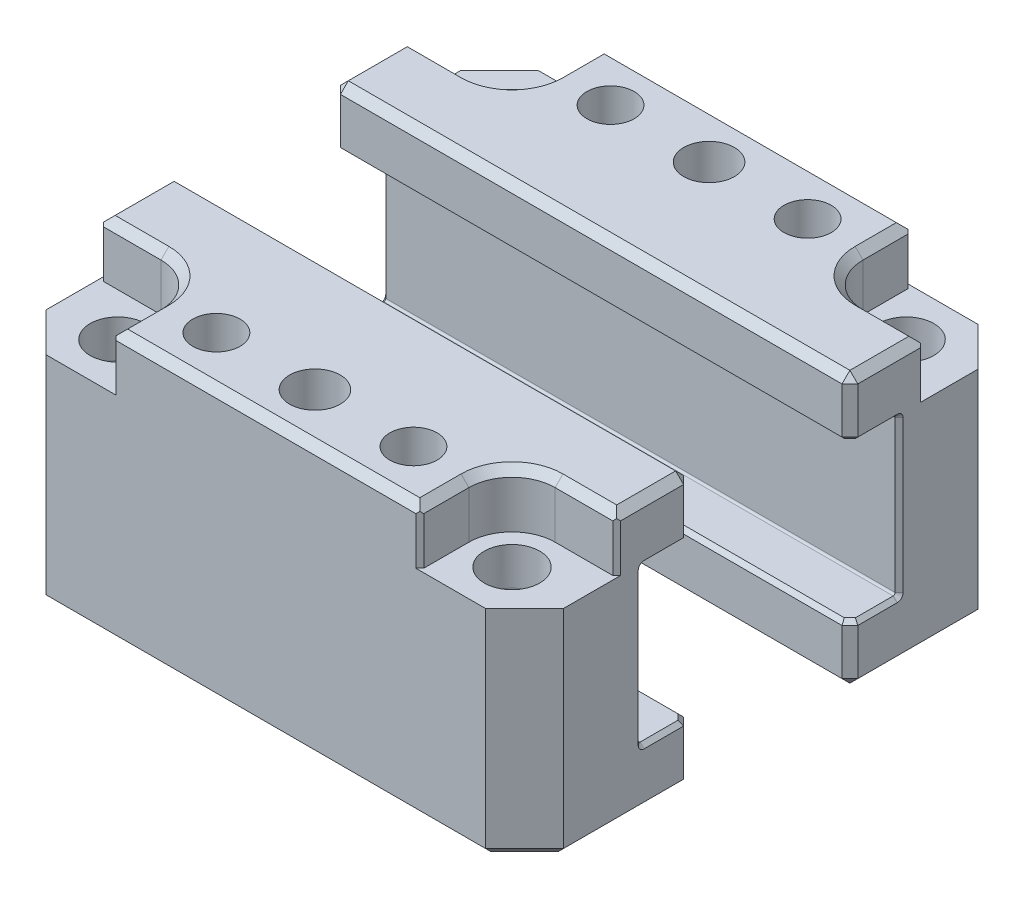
ISO-10303-21;
HEADER;
FILE_DESCRIPTION(('STEP AP214'),'2;1');
FILE_NAME('part.step','',(''),(''),'','','');
FILE_SCHEMA(('AUTOMOTIVE_DESIGN { 1 0 10303 214 1 1 1 1 }'));
ENDSEC;
DATA;
#1=APPLICATION_CONTEXT('core data for automotive mechanical design processes');
#2=APPLICATION_PROTOCOL_DEFINITION('international standard','automotive_design',2000,#1);
#3=PRODUCT_CONTEXT('',#1,'mechanical');
#4=PRODUCT('Part','Part','',(#3));
#5=PRODUCT_RELATED_PRODUCT_CATEGORY('part','',(#4));
#6=PRODUCT_DEFINITION_FORMATION('','',#4);
#7=PRODUCT_DEFINITION_CONTEXT('part definition',#1,'design');
#8=PRODUCT_DEFINITION('design','',#6,#7);
#9=PRODUCT_DEFINITION_SHAPE('','',#8);
#10=(LENGTH_UNIT() NAMED_UNIT(*) SI_UNIT(.MILLI.,.METRE.));
#11=(NAMED_UNIT(*) PLANE_ANGLE_UNIT() SI_UNIT($,.RADIAN.));
#12=(NAMED_UNIT(*) SI_UNIT($,.STERADIAN.) SOLID_ANGLE_UNIT());
#13=UNCERTAINTY_MEASURE_WITH_UNIT(LENGTH_MEASURE(1.E-05),#10,'distance_accuracy_value','');
#14=(GEOMETRIC_REPRESENTATION_CONTEXT(3) GLOBAL_UNCERTAINTY_ASSIGNED_CONTEXT((#13)) GLOBAL_UNIT_ASSIGNED_CONTEXT((#10,
#11,#12)) REPRESENTATION_CONTEXT('',''));
#15=CARTESIAN_POINT('',(0.,0.,0.));
#16=DIRECTION('',(0.,0.,1.));
#17=DIRECTION('',(1.,0.,0.));
#18=AXIS2_PLACEMENT_3D('',#15,#16,#17);
#19=CARTESIAN_POINT('',(33.3375,0.,-10.2108));
#20=DIRECTION('',(0.,0.,-1.));
#21=DIRECTION('',(1.,0.,0.));
#22=AXIS2_PLACEMENT_3D('',#19,#20,#21);
#23=PLANE('',#22);
#24=DIRECTION('',(0.,-1.,0.));
#25=VECTOR('',#24,1.);
#26=CARTESIAN_POINT('',(32.3215,27.4701,-10.2108));
#27=LINE('',#26,#25);
#28=CARTESIAN_POINT('',(32.3215,33.909,-10.2108));
#29=VERTEX_POINT('',#28);
#30=CARTESIAN_POINT('',(32.3215,27.9781,-10.2108));
#31=VERTEX_POINT('',#30);
#32=EDGE_CURVE('E521',#29,#31,#27,.T.);
#33=ORIENTED_EDGE('',*,*,#32,.F.);
#34=DIRECTION('',(1.,0.,0.));
#35=VECTOR('',#34,1.);
#36=CARTESIAN_POINT('',(33.3375,33.909,-10.2108));
#37=LINE('',#36,#35);
#38=CARTESIAN_POINT('',(-32.3215,33.909,-10.2108));
#39=VERTEX_POINT('',#38);
#40=EDGE_CURVE('E524',#39,#29,#37,.T.);
#41=ORIENTED_EDGE('',*,*,#40,.F.);
#42=DIRECTION('',(0.,1.,0.));
#43=VECTOR('',#42,1.);
#44=CARTESIAN_POINT('',(-32.3215,0.,-10.2108));
#45=LINE('',#44,#43);
#46=CARTESIAN_POINT('',(-32.3215,27.9781,-10.2108));
#47=VERTEX_POINT('',#46);
#48=EDGE_CURVE('E527',#47,#39,#45,.T.);
#49=ORIENTED_EDGE('',*,*,#48,.F.);
#50=DIRECTION('',(-1.,0.,0.));
#51=VECTOR('',#50,1.);
#52=CARTESIAN_POINT('',(33.3375,27.9781,-10.2108));
#53=LINE('',#52,#51);
#54=EDGE_CURVE('E716',#31,#47,#53,.T.);
#55=ORIENTED_EDGE('',*,*,#54,.F.);
#56=EDGE_LOOP('',(#33,#41,#49,#55));
#57=FACE_BOUND('',#56,.T.);
#58=ADVANCED_FACE('F47',(#57),#23,.F.);
#59=CARTESIAN_POINT('',(33.3375,0.,-31.7246));
#60=DIRECTION('',(0.,1.,0.));
#61=DIRECTION('',(0.,0.,-1.));
#62=AXIS2_PLACEMENT_3D('',#59,#60,#61);
#63=PLANE('',#62);
#64=CARTESIAN_POINT('',(12.7,0.,-25.4));
#65=DIRECTION('',(0.,-1.,0.));
#66=DIRECTION('',(0.,0.,-1.));
#67=AXIS2_PLACEMENT_3D('',#64,#65,#66);
#68=CIRCLE('',#67,3.68299999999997);
#69=CARTESIAN_POINT('',(12.7,0.,-29.083));
#70=VERTEX_POINT('',#69);
#71=EDGE_CURVE('E761',#70,#70,#68,.T.);
#72=ORIENTED_EDGE('',*,*,#71,.F.);
#73=EDGE_LOOP('',(#72));
#74=FACE_BOUND('',#73,.T.);
#75=CARTESIAN_POINT('',(-12.7,0.,-25.4));
#76=DIRECTION('',(0.,-1.,0.));
#77=DIRECTION('',(0.,0.,-1.));
#78=AXIS2_PLACEMENT_3D('',#75,#76,#77);
#79=CIRCLE('',#78,3.68299999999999);
#80=CARTESIAN_POINT('',(-12.7,0.,-29.083));
#81=VERTEX_POINT('',#80);
#82=EDGE_CURVE('E729',#81,#81,#79,.T.);
#83=ORIENTED_EDGE('',*,*,#82,.F.);
#84=EDGE_LOOP('',(#83));
#85=FACE_BOUND('',#84,.T.);
#86=DIRECTION('',(0.,0.,1.));
#87=VECTOR('',#86,1.);
#88=CARTESIAN_POINT('',(-32.3215,0.,-31.7246));
#89=LINE('',#88,#87);
#90=CARTESIAN_POINT('',(-32.3215,0.,-26.3037590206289));
#91=VERTEX_POINT('',#90);
#92=CARTESIAN_POINT('',(-32.3215,0.,-11.2268));
#93=VERTEX_POINT('',#92);
#94=EDGE_CURVE('E428',#91,#93,#89,.T.);
#95=ORIENTED_EDGE('',*,*,#94,.F.);
#96=DIRECTION('',(-0.707106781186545,0.,0.70710678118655));
#97=VECTOR('',#96,1.);
#98=CARTESIAN_POINT('',(-32.6190795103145,0.,-26.0061795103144));
#99=LINE('',#98,#97);
#100=CARTESIAN_POINT('',(-27.9166590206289,0.,-30.7086));
#101=VERTEX_POINT('',#100);
#102=EDGE_CURVE('E431',#101,#91,#99,.T.);
#103=ORIENTED_EDGE('',*,*,#102,.F.);
#104=DIRECTION('',(-1.,0.,0.));
#105=VECTOR('',#104,1.);
#106=CARTESIAN_POINT('',(33.3375,0.,-30.7086));
#107=LINE('',#106,#105);
#108=CARTESIAN_POINT('',(27.9166590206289,0.,-30.7086));
#109=VERTEX_POINT('',#108);
#110=EDGE_CURVE('E434',#109,#101,#107,.T.);
#111=ORIENTED_EDGE('',*,*,#110,.F.);
#112=DIRECTION('',(-0.707106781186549,0.,-0.707106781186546));
#113=VECTOR('',#112,1.);
#114=CARTESIAN_POINT('',(27.6190795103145,0.,-31.0061795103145));
#115=LINE('',#114,#113);
#116=CARTESIAN_POINT('',(32.3215,0.,-26.3037590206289));
#117=VERTEX_POINT('',#116);
#118=EDGE_CURVE('E437',#117,#109,#115,.T.);
#119=ORIENTED_EDGE('',*,*,#118,.F.);
#120=DIRECTION('',(0.,0.,-1.));
#121=VECTOR('',#120,1.);
#122=CARTESIAN_POINT('',(32.3215,0.,-26.7246));
#123=LINE('',#122,#121);
#124=CARTESIAN_POINT('',(32.3215,0.,-11.2268));
#125=VERTEX_POINT('',#124);
#126=EDGE_CURVE('E440',#125,#117,#123,.T.);
#127=ORIENTED_EDGE('',*,*,#126,.F.);
#128=DIRECTION('',(1.,0.,0.));
#129=VECTOR('',#128,1.);
#130=CARTESIAN_POINT('',(33.3375,0.,-11.2268));
#131=LINE('',#130,#129);
#132=EDGE_CURVE('E443',#93,#125,#131,.T.);
#133=ORIENTED_EDGE('',*,*,#132,.F.);
#134=EDGE_LOOP('',(#95,#103,#111,#119,#127,#133));
#135=FACE_BOUND('',#134,.T.);
#136=CARTESIAN_POINT('',(-25.4,0.,-25.4));
#137=DIRECTION('',(0.,1.,0.));
#138=DIRECTION('',(0.,0.,1.));
#139=AXIS2_PLACEMENT_3D('',#136,#137,#138);
#140=CIRCLE('',#139,3.58139999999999);
#141=CARTESIAN_POINT('',(-25.4,0.,-21.8186));
#142=VERTEX_POINT('',#141);
#143=EDGE_CURVE('E560',#142,#142,#140,.T.);
#144=ORIENTED_EDGE('',*,*,#143,.T.);
#145=EDGE_LOOP('',(#144));
#146=FACE_BOUND('',#145,.T.);
#147=CARTESIAN_POINT('',(25.4,0.,-25.4));
#148=DIRECTION('',(0.,1.,0.));
#149=DIRECTION('',(0.,0.,1.));
#150=AXIS2_PLACEMENT_3D('',#147,#148,#149);
#151=CIRCLE('',#150,3.58139999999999);
#152=CARTESIAN_POINT('',(25.4,0.,-21.8186));
#153=VERTEX_POINT('',#152);
#154=EDGE_CURVE('E406',#153,#153,#151,.T.);
#155=ORIENTED_EDGE('',*,*,#154,.T.);
#156=EDGE_LOOP('',(#155));
#157=FACE_BOUND('',#156,.T.);
#158=ADVANCED_FACE('F893',(#74,#85,#135,#146,#157),#63,.F.);
#159=CARTESIAN_POINT('',(33.3375,34.925,-10.2108));
#160=DIRECTION('',(0.,-1.,0.));
#161=DIRECTION('',(0.,0.,1.));
#162=AXIS2_PLACEMENT_3D('',#159,#160,#161);
#163=PLANE('',#162);
#164=CARTESIAN_POINT('',(-25.4,34.925,-25.4));
#165=DIRECTION('',(0.,1.,0.));
#166=DIRECTION('',(0.,0.,1.));
#167=AXIS2_PLACEMENT_3D('',#164,#165,#166);
#168=CIRCLE('',#167,6.57225);
#169=CARTESIAN_POINT('',(-25.4,34.925,-18.82775));
#170=VERTEX_POINT('',#169);
#171=CARTESIAN_POINT('',(-18.82775,34.925,-25.4));
#172=VERTEX_POINT('',#171);
#173=EDGE_CURVE('E509',#170,#172,#168,.T.);
#174=ORIENTED_EDGE('',*,*,#173,.F.);
#175=DIRECTION('',(1.,0.,0.));
#176=VECTOR('',#175,1.);
#177=CARTESIAN_POINT('',(33.3375,34.925,-18.82775));
#178=LINE('',#177,#176);
#179=CARTESIAN_POINT('',(-32.3215,34.925,-18.82775));
#180=VERTEX_POINT('',#179);
#181=EDGE_CURVE('E506',#180,#170,#178,.T.);
#182=ORIENTED_EDGE('',*,*,#181,.F.);
#183=DIRECTION('',(0.,0.,-1.));
#184=VECTOR('',#183,1.);
#185=CARTESIAN_POINT('',(-32.3215,34.925,-10.2108));
#186=LINE('',#185,#184);
#187=CARTESIAN_POINT('',(-32.3215,34.925,-11.2268));
#188=VERTEX_POINT('',#187);
#189=EDGE_CURVE('E503',#188,#180,#186,.T.);
#190=ORIENTED_EDGE('',*,*,#189,.F.);
#191=DIRECTION('',(-1.,0.,0.));
#192=VECTOR('',#191,1.);
#193=CARTESIAN_POINT('',(33.3375,34.925,-11.2268));
#194=LINE('',#193,#192);
#195=CARTESIAN_POINT('',(32.3215,34.925,-11.2268));
#196=VERTEX_POINT('',#195);
#197=EDGE_CURVE('E500',#196,#188,#194,.T.);
#198=ORIENTED_EDGE('',*,*,#197,.F.);
#199=DIRECTION('',(0.,0.,1.));
#200=VECTOR('',#199,1.);
#201=CARTESIAN_POINT('',(32.3215,34.925,-10.2108));
#202=LINE('',#201,#200);
#203=CARTESIAN_POINT('',(32.3215,34.925,-18.82775));
#204=VERTEX_POINT('',#203);
#205=EDGE_CURVE('E485',#204,#196,#202,.T.);
#206=ORIENTED_EDGE('',*,*,#205,.F.);
#207=DIRECTION('',(1.,0.,0.));
#208=VECTOR('',#207,1.);
#209=CARTESIAN_POINT('',(33.3375,34.925,-18.82775));
#210=LINE('',#209,#208);
#211=CARTESIAN_POINT('',(25.4,34.925,-18.82775));
#212=VERTEX_POINT('',#211);
#213=EDGE_CURVE('E488',#212,#204,#210,.T.);
#214=ORIENTED_EDGE('',*,*,#213,.F.);
#215=CARTESIAN_POINT('',(25.4,34.925,-25.4));
#216=DIRECTION('',(0.,1.,0.));
#217=DIRECTION('',(0.,0.,1.));
#218=AXIS2_PLACEMENT_3D('',#215,#216,#217);
#219=CIRCLE('',#218,6.57225);
#220=CARTESIAN_POINT('',(18.82775,34.925,-25.4));
#221=VERTEX_POINT('',#220);
#222=EDGE_CURVE('E491',#221,#212,#219,.T.);
#223=ORIENTED_EDGE('',*,*,#222,.F.);
#224=DIRECTION('',(0.,0.,1.));
#225=VECTOR('',#224,1.);
#226=CARTESIAN_POINT('',(18.82775,34.925,-10.2108));
#227=LINE('',#226,#225);
#228=CARTESIAN_POINT('',(18.82775,34.925,-30.7086));
#229=VERTEX_POINT('',#228);
#230=EDGE_CURVE('E494',#229,#221,#227,.T.);
#231=ORIENTED_EDGE('',*,*,#230,.F.);
#232=DIRECTION('',(1.,0.,0.));
#233=VECTOR('',#232,1.);
#234=CARTESIAN_POINT('',(33.3375,34.925,-30.7086));
#235=LINE('',#234,#233);
#236=CARTESIAN_POINT('',(-18.82775,34.925,-30.7086));
#237=VERTEX_POINT('',#236);
#238=EDGE_CURVE('E497',#237,#229,#235,.T.);
#239=ORIENTED_EDGE('',*,*,#238,.F.);
#240=DIRECTION('',(0.,0.,-1.));
#241=VECTOR('',#240,1.);
#242=CARTESIAN_POINT('',(-18.82775,34.925,-10.2108));
#243=LINE('',#242,#241);
#244=EDGE_CURVE('E512',#172,#237,#243,.T.);
#245=ORIENTED_EDGE('',*,*,#244,.F.);
#246=EDGE_LOOP('',(#174,#182,#190,#198,#206,#214,#223,#231,#239,#245));
#247=FACE_BOUND('',#246,.T.);
#248=CARTESIAN_POINT('',(-12.7,34.925,-25.4));
#249=DIRECTION('',(0.,1.,0.));
#250=DIRECTION('',(0.,0.,1.));
#251=AXIS2_PLACEMENT_3D('',#248,#249,#250);
#252=CIRCLE('',#251,3.048);
#253=CARTESIAN_POINT('',(-12.7,34.925,-22.352));
#254=VERTEX_POINT('',#253);
#255=EDGE_CURVE('E798',#254,#254,#252,.T.);
#256=ORIENTED_EDGE('',*,*,#255,.F.);
#257=EDGE_LOOP('',(#256));
#258=FACE_BOUND('',#257,.T.);
#259=CARTESIAN_POINT('',(0.,34.925,-25.4));
#260=DIRECTION('',(0.,-1.,0.));
#261=DIRECTION('',(0.,0.,-1.));
#262=AXIS2_PLACEMENT_3D('',#259,#260,#261);
#263=CIRCLE('',#262,3.26389999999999);
#264=CARTESIAN_POINT('',(0.,34.925,-28.6639));
#265=VERTEX_POINT('',#264);
#266=EDGE_CURVE('E801',#265,#265,#263,.T.);
#267=ORIENTED_EDGE('',*,*,#266,.T.);
#268=EDGE_LOOP('',(#267));
#269=FACE_BOUND('',#268,.T.);
#270=CARTESIAN_POINT('',(12.7,34.925,-25.4));
#271=DIRECTION('',(0.,-1.,0.));
#272=DIRECTION('',(0.,0.,1.));
#273=AXIS2_PLACEMENT_3D('',#270,#271,#272);
#274=CIRCLE('',#273,3.048);
#275=CARTESIAN_POINT('',(12.7,34.925,-22.352));
#276=VERTEX_POINT('',#275);
#277=EDGE_CURVE('E783',#276,#276,#274,.T.);
#278=ORIENTED_EDGE('',*,*,#277,.T.);
#279=EDGE_LOOP('',(#278));
#280=FACE_BOUND('',#279,.T.);
#281=ADVANCED_FACE('F919',(#247,#258,#269,#280),#163,.F.);
#282=DIRECTION('',(0.,1.,0.));
#283=VECTOR('',#282,1.);
#284=CARTESIAN_POINT('',(-32.3215,0.,-10.2108));
#285=LINE('',#284,#283);
#286=CARTESIAN_POINT('',(-32.3215,1.016,-10.2108));
#287=VERTEX_POINT('',#286);
#288=CARTESIAN_POINT('',(-32.3215,6.9469,-10.2108));
#289=VERTEX_POINT('',#288);
#290=EDGE_CURVE('E419',#287,#289,#285,.T.);
#291=ORIENTED_EDGE('',*,*,#290,.F.);
#292=DIRECTION('',(-1.,0.,0.));
#293=VECTOR('',#292,1.);
#294=CARTESIAN_POINT('',(33.3375,1.016,-10.2108));
#295=LINE('',#294,#293);
#296=CARTESIAN_POINT('',(32.3215,1.016,-10.2108));
#297=VERTEX_POINT('',#296);
#298=EDGE_CURVE('E422',#297,#287,#295,.T.);
#299=ORIENTED_EDGE('',*,*,#298,.F.);
#300=DIRECTION('',(0.,-1.,0.));
#301=VECTOR('',#300,1.);
#302=CARTESIAN_POINT('',(32.3215,0.,-10.2108));
#303=LINE('',#302,#301);
#304=CARTESIAN_POINT('',(32.3215,6.9469,-10.2108));
#305=VERTEX_POINT('',#304);
#306=EDGE_CURVE('E425',#305,#297,#303,.T.);
#307=ORIENTED_EDGE('',*,*,#306,.F.);
#308=DIRECTION('',(1.,0.,0.));
#309=VECTOR('',#308,1.);
#310=CARTESIAN_POINT('',(33.3375,6.9469,-10.2108));
#311=LINE('',#310,#309);
#312=EDGE_CURVE('E708',#289,#305,#311,.T.);
#313=ORIENTED_EDGE('',*,*,#312,.F.);
#314=EDGE_LOOP('',(#291,#299,#307,#313));
#315=FACE_BOUND('',#314,.T.);
#316=ADVANCED_FACE('F915',(#315),#23,.F.);
#317=CARTESIAN_POINT('',(33.3375,34.925,-31.7246));
#318=DIRECTION('',(0.,0.,1.));
#319=DIRECTION('',(0.,1.,0.));
#320=AXIS2_PLACEMENT_3D('',#317,#318,#319);
#321=PLANE('',#320);
#322=DIRECTION('',(1.,0.,0.));
#323=VECTOR('',#322,1.);
#324=CARTESIAN_POINT('',(33.3375,27.813,-31.7246));
#325=LINE('',#324,#323);
#326=CARTESIAN_POINT('',(19.33575,27.813,-31.7246));
#327=VERTEX_POINT('',#326);
#328=CARTESIAN_POINT('',(28.3375,27.813,-31.7246));
#329=VERTEX_POINT('',#328);
#330=EDGE_CURVE('E876',#327,#329,#325,.T.);
#331=ORIENTED_EDGE('',*,*,#330,.T.);
#332=DIRECTION('',(0.,1.,0.));
#333=VECTOR('',#332,1.);
#334=CARTESIAN_POINT('',(28.3375,34.925,-31.7246));
#335=LINE('',#334,#333);
#336=CARTESIAN_POINT('',(28.3375,1.016,-31.7246));
#337=VERTEX_POINT('',#336);
#338=EDGE_CURVE('E388',#337,#329,#335,.T.);
#339=ORIENTED_EDGE('',*,*,#338,.F.);
#340=DIRECTION('',(1.,0.,0.));
#341=VECTOR('',#340,1.);
#342=CARTESIAN_POINT('',(33.3375,1.016,-31.7246));
#343=LINE('',#342,#341);
#344=CARTESIAN_POINT('',(-28.3375,1.016,-31.7246));
#345=VERTEX_POINT('',#344);
#346=EDGE_CURVE('E464',#345,#337,#343,.T.);
#347=ORIENTED_EDGE('',*,*,#346,.F.);
#348=DIRECTION('',(0.,-1.,0.));
#349=VECTOR('',#348,1.);
#350=CARTESIAN_POINT('',(-28.3375,34.925,-31.7246));
#351=LINE('',#350,#349);
#352=CARTESIAN_POINT('',(-28.3375,27.813,-31.7246));
#353=VERTEX_POINT('',#352);
#354=EDGE_CURVE('E385',#353,#345,#351,.T.);
#355=ORIENTED_EDGE('',*,*,#354,.F.);
#356=DIRECTION('',(1.,0.,0.));
#357=VECTOR('',#356,1.);
#358=CARTESIAN_POINT('',(-33.3375,27.813,-31.7246));
#359=LINE('',#358,#357);
#360=CARTESIAN_POINT('',(-19.33575,27.813,-31.7246));
#361=VERTEX_POINT('',#360);
#362=EDGE_CURVE('E827',#353,#361,#359,.T.);
#363=ORIENTED_EDGE('',*,*,#362,.T.);
#364=DIRECTION('',(0.,-1.,0.));
#365=VECTOR('',#364,1.);
#366=CARTESIAN_POINT('',(-19.33575,34.925,-31.7246));
#367=LINE('',#366,#365);
#368=CARTESIAN_POINT('',(-19.33575,33.909,-31.7246));
#369=VERTEX_POINT('',#368);
#370=EDGE_CURVE('E615',#369,#361,#367,.T.);
#371=ORIENTED_EDGE('',*,*,#370,.F.);
#372=DIRECTION('',(-1.,0.,0.));
#373=VECTOR('',#372,1.);
#374=CARTESIAN_POINT('',(33.3375,33.909,-31.7246));
#375=LINE('',#374,#373);
#376=CARTESIAN_POINT('',(19.33575,33.909,-31.7246));
#377=VERTEX_POINT('',#376);
#378=EDGE_CURVE('E461',#377,#369,#375,.T.);
#379=ORIENTED_EDGE('',*,*,#378,.F.);
#380=DIRECTION('',(0.,1.,0.));
#381=VECTOR('',#380,1.);
#382=CARTESIAN_POINT('',(19.33575,34.925,-31.7246));
#383=LINE('',#382,#381);
#384=EDGE_CURVE('E618',#327,#377,#383,.T.);
#385=ORIENTED_EDGE('',*,*,#384,.F.);
#386=EDGE_LOOP('',(#331,#339,#347,#355,#363,#371,#379,#385));
#387=FACE_BOUND('',#386,.T.);
#388=ADVANCED_FACE('F844',(#387),#321,.F.);
#389=CARTESIAN_POINT('',(33.3375,0.,0.));
#390=DIRECTION('',(1.,0.,0.));
#391=DIRECTION('',(0.,0.,1.));
#392=AXIS2_PLACEMENT_3D('',#389,#390,#391);
#393=PLANE('',#392);
#394=DIRECTION('',(0.,0.,-1.));
#395=VECTOR('',#394,1.);
#396=CARTESIAN_POINT('',(33.3375,33.909,-19.84375));
#397=LINE('',#396,#395);
#398=CARTESIAN_POINT('',(33.3375,33.909,-11.2268));
#399=VERTEX_POINT('',#398);
#400=CARTESIAN_POINT('',(33.3375,33.909,-19.33575));
#401=VERTEX_POINT('',#400);
#402=EDGE_CURVE('E449',#399,#401,#397,.T.);
#403=ORIENTED_EDGE('',*,*,#402,.F.);
#404=DIRECTION('',(0.,1.,0.));
#405=VECTOR('',#404,1.);
#406=CARTESIAN_POINT('',(33.3375,34.925,-11.2268));
#407=LINE('',#406,#405);
#408=CARTESIAN_POINT('',(33.3375,27.9781,-11.2268));
#409=VERTEX_POINT('',#408);
#410=EDGE_CURVE('E446',#409,#399,#407,.T.);
#411=ORIENTED_EDGE('',*,*,#410,.F.);
#412=DIRECTION('',(0.,0.,1.));
#413=VECTOR('',#412,1.);
#414=CARTESIAN_POINT('',(33.3375,27.9781,-11.2268));
#415=LINE('',#414,#413);
#416=CARTESIAN_POINT('',(33.3375,27.9781,-16.3068));
#417=VERTEX_POINT('',#416);
#418=EDGE_CURVE('E609',#417,#409,#415,.T.);
#419=ORIENTED_EDGE('',*,*,#418,.F.);
#420=CARTESIAN_POINT('',(33.3375,27.2161,-16.3068));
#421=DIRECTION('',(-1.,0.,0.));
#422=DIRECTION('',(0.,0.,1.));
#423=AXIS2_PLACEMENT_3D('',#420,#421,#422);
#424=CIRCLE('',#423,0.761999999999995);
#425=CARTESIAN_POINT('',(33.3375,27.2161,-17.0688));
#426=VERTEX_POINT('',#425);
#427=EDGE_CURVE('E606',#426,#417,#424,.F.);
#428=ORIENTED_EDGE('',*,*,#427,.F.);
#429=DIRECTION('',(0.,1.,0.));
#430=VECTOR('',#429,1.);
#431=CARTESIAN_POINT('',(33.3375,27.2161,-17.0688));
#432=LINE('',#431,#430);
#433=CARTESIAN_POINT('',(33.3375,7.7089,-17.0688));
#434=VERTEX_POINT('',#433);
#435=EDGE_CURVE('E603',#434,#426,#432,.T.);
#436=ORIENTED_EDGE('',*,*,#435,.F.);
#437=CARTESIAN_POINT('',(33.3375,7.7089,-16.3068));
#438=DIRECTION('',(-1.,0.,0.));
#439=DIRECTION('',(0.,0.,1.));
#440=AXIS2_PLACEMENT_3D('',#437,#438,#439);
#441=CIRCLE('',#440,0.761999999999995);
#442=CARTESIAN_POINT('',(33.3375,6.9469,-16.3068));
#443=VERTEX_POINT('',#442);
#444=EDGE_CURVE('E600',#443,#434,#441,.F.);
#445=ORIENTED_EDGE('',*,*,#444,.F.);
#446=DIRECTION('',(0.,0.,-1.));
#447=VECTOR('',#446,1.);
#448=CARTESIAN_POINT('',(33.3375,6.9469,-16.3068));
#449=LINE('',#448,#447);
#450=CARTESIAN_POINT('',(33.3375,6.94690000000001,-11.2268));
#451=VERTEX_POINT('',#450);
#452=EDGE_CURVE('E597',#451,#443,#449,.T.);
#453=ORIENTED_EDGE('',*,*,#452,.F.);
#454=DIRECTION('',(0.,1.,0.));
#455=VECTOR('',#454,1.);
#456=CARTESIAN_POINT('',(33.3375,7.4549,-11.2268));
#457=LINE('',#456,#455);
#458=CARTESIAN_POINT('',(33.3375,1.016,-11.2268));
#459=VERTEX_POINT('',#458);
#460=EDGE_CURVE('E455',#459,#451,#457,.T.);
#461=ORIENTED_EDGE('',*,*,#460,.F.);
#462=DIRECTION('',(0.,0.,1.));
#463=VECTOR('',#462,1.);
#464=CARTESIAN_POINT('',(33.3375,1.016,-10.2108));
#465=LINE('',#464,#463);
#466=CARTESIAN_POINT('',(33.3375,1.016,-26.7246));
#467=VERTEX_POINT('',#466);
#468=EDGE_CURVE('E452',#467,#459,#465,.T.);
#469=ORIENTED_EDGE('',*,*,#468,.F.);
#470=DIRECTION('',(0.,-1.,0.));
#471=VECTOR('',#470,1.);
#472=CARTESIAN_POINT('',(33.3375,0.,-26.7246));
#473=LINE('',#472,#471);
#474=CARTESIAN_POINT('',(33.3375,27.813,-26.7246));
#475=VERTEX_POINT('',#474);
#476=EDGE_CURVE('E376',#475,#467,#473,.T.);
#477=ORIENTED_EDGE('',*,*,#476,.F.);
#478=DIRECTION('',(0.,0.,1.));
#479=VECTOR('',#478,1.);
#480=CARTESIAN_POINT('',(33.3375,27.813,-19.84375));
#481=LINE('',#480,#479);
#482=CARTESIAN_POINT('',(33.3375,27.813,-19.33575));
#483=VERTEX_POINT('',#482);
#484=EDGE_CURVE('E365',#475,#483,#481,.T.);
#485=ORIENTED_EDGE('',*,*,#484,.T.);
#486=DIRECTION('',(0.,-1.,0.));
#487=VECTOR('',#486,1.);
#488=CARTESIAN_POINT('',(33.3375,27.813,-19.33575));
#489=LINE('',#488,#487);
#490=EDGE_CURVE('E612',#401,#483,#489,.T.);
#491=ORIENTED_EDGE('',*,*,#490,.F.);
#492=EDGE_LOOP('',(#403,#411,#419,#428,#436,#445,#453,#461,#469,#477,#485,#491));
#493=FACE_BOUND('',#492,.T.);
#494=ADVANCED_FACE('F930',(#493),#393,.T.);
#495=CARTESIAN_POINT('',(-33.3375,0.,0.));
#496=DIRECTION('',(1.,0.,0.));
#497=DIRECTION('',(0.,0.,1.));
#498=AXIS2_PLACEMENT_3D('',#495,#496,#497);
#499=PLANE('',#498);
#500=DIRECTION('',(0.,0.,-1.));
#501=VECTOR('',#500,1.);
#502=CARTESIAN_POINT('',(-33.3375,27.813,-19.84375));
#503=LINE('',#502,#501);
#504=CARTESIAN_POINT('',(-33.3375,27.813,-19.33575));
#505=VERTEX_POINT('',#504);
#506=CARTESIAN_POINT('',(-33.3375,27.813,-26.7246));
#507=VERTEX_POINT('',#506);
#508=EDGE_CURVE('E824',#505,#507,#503,.T.);
#509=ORIENTED_EDGE('',*,*,#508,.T.);
#510=DIRECTION('',(0.,1.,0.));
#511=VECTOR('',#510,1.);
#512=CARTESIAN_POINT('',(-33.3375,0.,-26.7246));
#513=LINE('',#512,#511);
#514=CARTESIAN_POINT('',(-33.3375,1.016,-26.7246));
#515=VERTEX_POINT('',#514);
#516=EDGE_CURVE('E391',#515,#507,#513,.T.);
#517=ORIENTED_EDGE('',*,*,#516,.F.);
#518=DIRECTION('',(0.,0.,-1.));
#519=VECTOR('',#518,1.);
#520=CARTESIAN_POINT('',(-33.3375,1.016,0.));
#521=LINE('',#520,#519);
#522=CARTESIAN_POINT('',(-33.3375,1.016,-11.2268));
#523=VERTEX_POINT('',#522);
#524=EDGE_CURVE('E479',#523,#515,#521,.T.);
#525=ORIENTED_EDGE('',*,*,#524,.F.);
#526=DIRECTION('',(0.,-1.,0.));
#527=VECTOR('',#526,1.);
#528=CARTESIAN_POINT('',(-33.3375,0.,-11.2268));
#529=LINE('',#528,#527);
#530=CARTESIAN_POINT('',(-33.3375,6.9469,-11.2268));
#531=VERTEX_POINT('',#530);
#532=EDGE_CURVE('E476',#531,#523,#529,.T.);
#533=ORIENTED_EDGE('',*,*,#532,.F.);
#534=DIRECTION('',(0.,0.,1.));
#535=VECTOR('',#534,1.);
#536=CARTESIAN_POINT('',(-33.3375,6.9469,0.));
#537=LINE('',#536,#535);
#538=CARTESIAN_POINT('',(-33.3375,6.9469,-16.3068));
#539=VERTEX_POINT('',#538);
#540=EDGE_CURVE('E646',#539,#531,#537,.T.);
#541=ORIENTED_EDGE('',*,*,#540,.F.);
#542=CARTESIAN_POINT('',(-33.3375,7.7089,-16.3068));
#543=DIRECTION('',(-1.,0.,0.));
#544=DIRECTION('',(0.,0.,1.));
#545=AXIS2_PLACEMENT_3D('',#542,#543,#544);
#546=CIRCLE('',#545,0.761999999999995);
#547=CARTESIAN_POINT('',(-33.3375,7.7089,-17.0688));
#548=VERTEX_POINT('',#547);
#549=EDGE_CURVE('E643',#548,#539,#546,.T.);
#550=ORIENTED_EDGE('',*,*,#549,.F.);
#551=DIRECTION('',(0.,-1.,0.));
#552=VECTOR('',#551,1.);
#553=CARTESIAN_POINT('',(-33.3375,0.,-17.0688));
#554=LINE('',#553,#552);
#555=CARTESIAN_POINT('',(-33.3375,27.2161,-17.0688));
#556=VERTEX_POINT('',#555);
#557=EDGE_CURVE('E640',#556,#548,#554,.T.);
#558=ORIENTED_EDGE('',*,*,#557,.F.);
#559=CARTESIAN_POINT('',(-33.3375,27.2161,-16.3068));
#560=DIRECTION('',(-1.,0.,0.));
#561=DIRECTION('',(0.,0.,1.));
#562=AXIS2_PLACEMENT_3D('',#559,#560,#561);
#563=CIRCLE('',#562,0.761999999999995);
#564=CARTESIAN_POINT('',(-33.3375,27.9781,-16.3068));
#565=VERTEX_POINT('',#564);
#566=EDGE_CURVE('E637',#565,#556,#563,.T.);
#567=ORIENTED_EDGE('',*,*,#566,.F.);
#568=DIRECTION('',(0.,0.,-1.));
#569=VECTOR('',#568,1.);
#570=CARTESIAN_POINT('',(-33.3375,27.9781,0.));
#571=LINE('',#570,#569);
#572=CARTESIAN_POINT('',(-33.3375,27.9781,-11.2268));
#573=VERTEX_POINT('',#572);
#574=EDGE_CURVE('E634',#573,#565,#571,.T.);
#575=ORIENTED_EDGE('',*,*,#574,.F.);
#576=DIRECTION('',(0.,-1.,0.));
#577=VECTOR('',#576,1.);
#578=CARTESIAN_POINT('',(-33.3375,0.,-11.2268));
#579=LINE('',#578,#577);
#580=CARTESIAN_POINT('',(-33.3375,33.909,-11.2268));
#581=VERTEX_POINT('',#580);
#582=EDGE_CURVE('E470',#581,#573,#579,.T.);
#583=ORIENTED_EDGE('',*,*,#582,.F.);
#584=DIRECTION('',(0.,0.,1.));
#585=VECTOR('',#584,1.);
#586=CARTESIAN_POINT('',(-33.3375,33.909,0.));
#587=LINE('',#586,#585);
#588=CARTESIAN_POINT('',(-33.3375,33.909,-19.33575));
#589=VERTEX_POINT('',#588);
#590=EDGE_CURVE('E473',#589,#581,#587,.T.);
#591=ORIENTED_EDGE('',*,*,#590,.F.);
#592=DIRECTION('',(0.,1.,0.));
#593=VECTOR('',#592,1.);
#594=CARTESIAN_POINT('',(-33.3375,0.,-19.33575));
#595=LINE('',#594,#593);
#596=EDGE_CURVE('E649',#505,#589,#595,.T.);
#597=ORIENTED_EDGE('',*,*,#596,.F.);
#598=EDGE_LOOP('',(#509,#517,#525,#533,#541,#550,#558,#567,#575,#583,#591,#597));
#599=FACE_BOUND('',#598,.T.);
#600=ADVANCED_FACE('F853',(#599),#499,.F.);
#601=CARTESIAN_POINT('',(25.4,34.925,-25.4));
#602=DIRECTION('',(0.,1.,0.));
#603=DIRECTION('',(0.,0.,-1.));
#604=AXIS2_PLACEMENT_3D('',#601,#602,#603);
#605=CYLINDRICAL_SURFACE('',#604,3.57124);
#606=CARTESIAN_POINT('',(25.4,22.9423047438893,-25.4));
#607=DIRECTION('',(0.,1.,0.));
#608=DIRECTION('',(0.,0.,1.));
#609=AXIS2_PLACEMENT_3D('',#606,#607,#608);
#610=CIRCLE('',#609,3.57124);
#611=CARTESIAN_POINT('',(25.4,22.9423047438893,-21.82876));
#612=VERTEX_POINT('',#611);
#613=EDGE_CURVE('E399',#612,#612,#610,.T.);
#614=ORIENTED_EDGE('',*,*,#613,.F.);
#615=EDGE_LOOP('',(#614));
#616=FACE_BOUND('',#615,.T.);
#617=CARTESIAN_POINT('',(25.4,27.813,-25.4));
#618=DIRECTION('',(0.,-1.,0.));
#619=DIRECTION('',(0.,0.,-1.));
#620=AXIS2_PLACEMENT_3D('',#617,#618,#619);
#621=CIRCLE('',#620,3.57124);
#622=CARTESIAN_POINT('',(25.4,27.813,-28.97124));
#623=VERTEX_POINT('',#622);
#624=EDGE_CURVE('E372',#623,#623,#621,.T.);
#625=ORIENTED_EDGE('',*,*,#624,.F.);
#626=EDGE_LOOP('',(#625));
#627=FACE_BOUND('',#626,.T.);
#628=ADVANCED_FACE('F1215',(#616,#627),#605,.F.);
#629=CARTESIAN_POINT('',(28.97124,27.813,-25.4));
#630=DIRECTION('',(0.,-1.,0.));
#631=DIRECTION('',(0.,0.,1.));
#632=AXIS2_PLACEMENT_3D('',#629,#630,#631);
#633=PLANE('',#632);
#634=ORIENTED_EDGE('',*,*,#624,.T.);
#635=EDGE_LOOP('',(#634));
#636=FACE_BOUND('',#635,.T.);
#637=CARTESIAN_POINT('',(25.4,27.813,-25.4));
#638=DIRECTION('',(0.,-1.,0.));
#639=DIRECTION('',(0.,0.,-1.));
#640=AXIS2_PLACEMENT_3D('',#637,#638,#639);
#641=CIRCLE('',#640,5.55625);
#642=CARTESIAN_POINT('',(25.4,27.813,-19.84375));
#643=VERTEX_POINT('',#642);
#644=CARTESIAN_POINT('',(19.84375,27.813,-25.4));
#645=VERTEX_POINT('',#644);
#646=EDGE_CURVE('E351',#643,#645,#641,.T.);
#647=ORIENTED_EDGE('',*,*,#646,.F.);
#648=DIRECTION('',(-1.,0.,0.));
#649=VECTOR('',#648,1.);
#650=CARTESIAN_POINT('',(25.4,27.813,-19.84375));
#651=LINE('',#650,#649);
#652=CARTESIAN_POINT('',(32.8295,27.813,-19.84375));
#653=VERTEX_POINT('',#652);
#654=EDGE_CURVE('E357',#653,#643,#651,.T.);
#655=ORIENTED_EDGE('',*,*,#654,.F.);
#656=DIRECTION('',(-0.707106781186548,0.,-0.707106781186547));
#657=VECTOR('',#656,1.);
#658=CARTESIAN_POINT('',(28.122245,27.813,-24.551005));
#659=LINE('',#658,#657);
#660=EDGE_CURVE('E720',#483,#653,#659,.T.);
#661=ORIENTED_EDGE('',*,*,#660,.F.);
#662=ORIENTED_EDGE('',*,*,#484,.F.);
#663=DIRECTION('',(0.707106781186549,0.,0.707106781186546));
#664=VECTOR('',#663,1.);
#665=CARTESIAN_POINT('',(33.3375,27.813,-26.7246));
#666=LINE('',#665,#664);
#667=EDGE_CURVE('E396',#329,#475,#666,.T.);
#668=ORIENTED_EDGE('',*,*,#667,.F.);
#669=ORIENTED_EDGE('',*,*,#330,.F.);
#670=DIRECTION('',(0.707106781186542,0.,0.707106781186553));
#671=VECTOR('',#670,1.);
#672=CARTESIAN_POINT('',(27.3157949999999,27.813,-23.744555));
#673=LINE('',#672,#671);
#674=CARTESIAN_POINT('',(19.84375,27.813,-31.2166));
#675=VERTEX_POINT('',#674);
#676=EDGE_CURVE('E722',#675,#327,#673,.F.);
#677=ORIENTED_EDGE('',*,*,#676,.F.);
#678=DIRECTION('',(0.,0.,-1.));
#679=VECTOR('',#678,1.);
#680=CARTESIAN_POINT('',(19.84375,27.813,-31.7246));
#681=LINE('',#680,#679);
#682=EDGE_CURVE('E371',#645,#675,#681,.T.);
#683=ORIENTED_EDGE('',*,*,#682,.F.);
#684=EDGE_LOOP('',(#647,#655,#661,#662,#668,#669,#677,#683));
#685=FACE_BOUND('',#684,.T.);
#686=ADVANCED_FACE('F368',(#636,#685),#633,.F.);
#687=CARTESIAN_POINT('',(25.4,34.925,-25.4));
#688=DIRECTION('',(0.,1.,0.));
#689=DIRECTION('',(0.,0.,-1.));
#690=AXIS2_PLACEMENT_3D('',#687,#688,#689);
#691=CYLINDRICAL_SURFACE('',#690,5.55625);
#692=DIRECTION('',(0.,1.,0.));
#693=VECTOR('',#692,1.);
#694=CARTESIAN_POINT('',(25.4,9.83423792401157,-19.84375));
#695=LINE('',#694,#693);
#696=CARTESIAN_POINT('',(25.4,33.909,-19.84375));
#697=VERTEX_POINT('',#696);
#698=EDGE_CURVE('E346',#643,#697,#695,.T.);
#699=ORIENTED_EDGE('',*,*,#698,.F.);
#700=ORIENTED_EDGE('',*,*,#646,.T.);
#701=DIRECTION('',(0.,1.,0.));
#702=VECTOR('',#701,1.);
#703=CARTESIAN_POINT('',(19.84375,9.83423792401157,-25.4));
#704=LINE('',#703,#702);
#705=CARTESIAN_POINT('',(19.84375,33.909,-25.4));
#706=VERTEX_POINT('',#705);
#707=EDGE_CURVE('E356',#645,#706,#704,.T.);
#708=ORIENTED_EDGE('',*,*,#707,.T.);
#709=CARTESIAN_POINT('',(25.4,33.909,-25.4));
#710=DIRECTION('',(0.,1.,0.));
#711=DIRECTION('',(0.,0.,1.));
#712=AXIS2_PLACEMENT_3D('',#709,#710,#711);
#713=CIRCLE('',#712,5.55625);
#714=EDGE_CURVE('E353',#697,#706,#713,.F.);
#715=ORIENTED_EDGE('',*,*,#714,.F.);
#716=EDGE_LOOP('',(#699,#700,#708,#715));
#717=FACE_BOUND('',#716,.T.);
#718=ADVANCED_FACE('F348',(#717),#691,.F.);
#719=CARTESIAN_POINT('',(-25.4,34.925,-25.4));
#720=DIRECTION('',(0.,1.,0.));
#721=DIRECTION('',(0.,0.,-1.));
#722=AXIS2_PLACEMENT_3D('',#719,#720,#721);
#723=CYLINDRICAL_SURFACE('',#722,3.57124);
#724=CARTESIAN_POINT('',(-25.4,22.9423047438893,-25.4));
#725=DIRECTION('',(0.,1.,0.));
#726=DIRECTION('',(0.,0.,1.));
#727=AXIS2_PLACEMENT_3D('',#724,#725,#726);
#728=CIRCLE('',#727,3.57124);
#729=CARTESIAN_POINT('',(-25.4,22.9423047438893,-21.82876));
#730=VERTEX_POINT('',#729);
#731=EDGE_CURVE('E403',#730,#730,#728,.T.);
#732=ORIENTED_EDGE('',*,*,#731,.F.);
#733=EDGE_LOOP('',(#732));
#734=FACE_BOUND('',#733,.T.);
#735=CARTESIAN_POINT('',(-25.4,27.813,-25.4));
#736=DIRECTION('',(0.,-1.,0.));
#737=DIRECTION('',(0.,0.,-1.));
#738=AXIS2_PLACEMENT_3D('',#735,#736,#737);
#739=CIRCLE('',#738,3.57124);
#740=CARTESIAN_POINT('',(-25.4,27.813,-28.97124));
#741=VERTEX_POINT('',#740);
#742=EDGE_CURVE('E373',#741,#741,#739,.T.);
#743=ORIENTED_EDGE('',*,*,#742,.F.);
#744=EDGE_LOOP('',(#743));
#745=FACE_BOUND('',#744,.T.);
#746=ADVANCED_FACE('F1206',(#734,#745),#723,.F.);
#747=CARTESIAN_POINT('',(-21.82876,27.813,-25.4));
#748=DIRECTION('',(0.,-1.,0.));
#749=DIRECTION('',(0.,0.,1.));
#750=AXIS2_PLACEMENT_3D('',#747,#748,#749);
#751=PLANE('',#750);
#752=ORIENTED_EDGE('',*,*,#742,.T.);
#753=EDGE_LOOP('',(#752));
#754=FACE_BOUND('',#753,.T.);
#755=CARTESIAN_POINT('',(-25.4,27.813,-25.4));
#756=DIRECTION('',(0.,-1.,0.));
#757=DIRECTION('',(0.,0.,-1.));
#758=AXIS2_PLACEMENT_3D('',#755,#756,#757);
#759=CIRCLE('',#758,5.55625);
#760=CARTESIAN_POINT('',(-19.84375,27.813,-25.4));
#761=VERTEX_POINT('',#760);
#762=CARTESIAN_POINT('',(-25.4,27.813,-19.84375));
#763=VERTEX_POINT('',#762);
#764=EDGE_CURVE('E379',#761,#763,#759,.T.);
#765=ORIENTED_EDGE('',*,*,#764,.F.);
#766=DIRECTION('',(0.,0.,1.));
#767=VECTOR('',#766,1.);
#768=CARTESIAN_POINT('',(-19.84375,27.813,-31.7246));
#769=LINE('',#768,#767);
#770=CARTESIAN_POINT('',(-19.84375,27.813,-31.2166));
#771=VERTEX_POINT('',#770);
#772=EDGE_CURVE('E817',#771,#761,#769,.T.);
#773=ORIENTED_EDGE('',*,*,#772,.F.);
#774=DIRECTION('',(0.707106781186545,0.,-0.70710678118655));
#775=VECTOR('',#774,1.);
#776=CARTESIAN_POINT('',(-23.744555,27.813,-27.315795));
#777=LINE('',#776,#775);
#778=EDGE_CURVE('E724',#361,#771,#777,.F.);
#779=ORIENTED_EDGE('',*,*,#778,.F.);
#780=ORIENTED_EDGE('',*,*,#362,.F.);
#781=DIRECTION('',(-0.707106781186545,0.,0.70710678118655));
#782=VECTOR('',#781,1.);
#783=CARTESIAN_POINT('',(-28.3375,27.813,-31.7246));
#784=LINE('',#783,#782);
#785=EDGE_CURVE('E394',#507,#353,#784,.F.);
#786=ORIENTED_EDGE('',*,*,#785,.F.);
#787=ORIENTED_EDGE('',*,*,#508,.F.);
#788=DIRECTION('',(0.707106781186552,0.,-0.707106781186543));
#789=VECTOR('',#788,1.);
#790=CARTESIAN_POINT('',(-24.5510049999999,27.813,-28.122245));
#791=LINE('',#790,#789);
#792=CARTESIAN_POINT('',(-32.8295,27.813,-19.84375));
#793=VERTEX_POINT('',#792);
#794=EDGE_CURVE('E727',#793,#505,#791,.F.);
#795=ORIENTED_EDGE('',*,*,#794,.F.);
#796=DIRECTION('',(-1.,0.,0.));
#797=VECTOR('',#796,1.);
#798=CARTESIAN_POINT('',(-25.4,27.813,-19.84375));
#799=LINE('',#798,#797);
#800=EDGE_CURVE('E820',#763,#793,#799,.T.);
#801=ORIENTED_EDGE('',*,*,#800,.F.);
#802=EDGE_LOOP('',(#765,#773,#779,#780,#786,#787,#795,#801));
#803=FACE_BOUND('',#802,.T.);
#804=ADVANCED_FACE('F816',(#754,#803),#751,.F.);
#805=CARTESIAN_POINT('',(-25.4,34.925,-25.4));
#806=DIRECTION('',(0.,1.,0.));
#807=DIRECTION('',(0.,0.,-1.));
#808=AXIS2_PLACEMENT_3D('',#805,#806,#807);
#809=CYLINDRICAL_SURFACE('',#808,5.55625);
#810=DIRECTION('',(0.,1.,0.));
#811=VECTOR('',#810,1.);
#812=CARTESIAN_POINT('',(-19.84375,9.83423792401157,-25.4));
#813=LINE('',#812,#811);
#814=CARTESIAN_POINT('',(-19.84375,33.909,-25.4));
#815=VERTEX_POINT('',#814);
#816=EDGE_CURVE('E786',#761,#815,#813,.T.);
#817=ORIENTED_EDGE('',*,*,#816,.F.);
#818=ORIENTED_EDGE('',*,*,#764,.T.);
#819=DIRECTION('',(0.,1.,0.));
#820=VECTOR('',#819,1.);
#821=CARTESIAN_POINT('',(-25.4,9.83423792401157,-19.84375));
#822=LINE('',#821,#820);
#823=CARTESIAN_POINT('',(-25.4,33.909,-19.84375));
#824=VERTEX_POINT('',#823);
#825=EDGE_CURVE('E780',#763,#824,#822,.T.);
#826=ORIENTED_EDGE('',*,*,#825,.T.);
#827=CARTESIAN_POINT('',(-25.4,33.909,-25.4));
#828=DIRECTION('',(0.,1.,0.));
#829=DIRECTION('',(0.,0.,1.));
#830=AXIS2_PLACEMENT_3D('',#827,#828,#829);
#831=CIRCLE('',#830,5.55625);
#832=EDGE_CURVE('E515',#815,#824,#831,.F.);
#833=ORIENTED_EDGE('',*,*,#832,.F.);
#834=EDGE_LOOP('',(#817,#818,#826,#833));
#835=FACE_BOUND('',#834,.T.);
#836=ADVANCED_FACE('F809',(#835),#809,.F.);
#837=CARTESIAN_POINT('',(0.,11.4808,-25.4));
#838=DIRECTION('',(0.,1.,0.));
#839=DIRECTION('',(0.,0.,-1.));
#840=AXIS2_PLACEMENT_3D('',#837,#838,#839);
#841=CONICAL_SURFACE('',#840,3.2639,1.02974425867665);
#842=CARTESIAN_POINT('',(0.,9.51965102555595,-25.4));
#843=VERTEX_POINT('',#842);
#844=VERTEX_LOOP('',#843);
#845=FACE_BOUND('',#844,.T.);
#846=CARTESIAN_POINT('',(0.,11.4808,-25.4));
#847=DIRECTION('',(0.,-1.,0.));
#848=DIRECTION('',(0.,0.,-1.));
#849=AXIS2_PLACEMENT_3D('',#846,#847,#848);
#850=CIRCLE('',#849,3.2639);
#851=CARTESIAN_POINT('',(0.,11.4808,-28.6639));
#852=VERTEX_POINT('',#851);
#853=EDGE_CURVE('E804',#852,#852,#850,.T.);
#854=ORIENTED_EDGE('',*,*,#853,.F.);
#855=EDGE_LOOP('',(#854));
#856=FACE_BOUND('',#855,.T.);
#857=ADVANCED_FACE('F1197',(#845,#856),#841,.F.);
#858=CARTESIAN_POINT('',(0.,34.925,-25.4));
#859=DIRECTION('',(0.,1.,0.));
#860=DIRECTION('',(0.,0.,-1.));
#861=AXIS2_PLACEMENT_3D('',#858,#859,#860);
#862=CYLINDRICAL_SURFACE('',#861,3.26389999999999);
#863=ORIENTED_EDGE('',*,*,#853,.T.);
#864=EDGE_LOOP('',(#863));
#865=FACE_BOUND('',#864,.T.);
#866=ORIENTED_EDGE('',*,*,#266,.F.);
#867=EDGE_LOOP('',(#866));
#868=FACE_BOUND('',#867,.T.);
#869=ADVANCED_FACE('F1194',(#865,#868),#862,.F.);
#870=CARTESIAN_POINT('',(33.3375,0.,-26.7246));
#871=DIRECTION('',(0.707106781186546,0.,-0.707106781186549));
#872=DIRECTION('',(0.,1.,0.));
#873=AXIS2_PLACEMENT_3D('',#870,#871,#872);
#874=PLANE('',#873);
#875=ORIENTED_EDGE('',*,*,#338,.T.);
#876=ORIENTED_EDGE('',*,*,#667,.T.);
#877=ORIENTED_EDGE('',*,*,#476,.T.);
#878=DIRECTION('',(0.707106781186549,0.,0.707106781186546));
#879=VECTOR('',#878,1.);
#880=CARTESIAN_POINT('',(33.3375,1.016,-26.7246));
#881=LINE('',#880,#879);
#882=EDGE_CURVE('E458',#337,#467,#881,.T.);
#883=ORIENTED_EDGE('',*,*,#882,.F.);
#884=EDGE_LOOP('',(#875,#876,#877,#883));
#885=FACE_BOUND('',#884,.T.);
#886=ADVANCED_FACE('F1045',(#885),#874,.T.);
#887=CARTESIAN_POINT('',(-28.3375,34.925,-31.7246));
#888=DIRECTION('',(0.70710678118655,0.,0.707106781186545));
#889=DIRECTION('',(0.,-1.,0.));
#890=AXIS2_PLACEMENT_3D('',#887,#888,#889);
#891=PLANE('',#890);
#892=ORIENTED_EDGE('',*,*,#516,.T.);
#893=ORIENTED_EDGE('',*,*,#785,.T.);
#894=ORIENTED_EDGE('',*,*,#354,.T.);
#895=DIRECTION('',(-0.707106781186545,0.,0.70710678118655));
#896=VECTOR('',#895,1.);
#897=CARTESIAN_POINT('',(-28.3375,1.016,-31.7246));
#898=LINE('',#897,#896);
#899=EDGE_CURVE('E467',#515,#345,#898,.F.);
#900=ORIENTED_EDGE('',*,*,#899,.F.);
#901=EDGE_LOOP('',(#892,#893,#894,#900));
#902=FACE_BOUND('',#901,.T.);
#903=ADVANCED_FACE('F848',(#902),#891,.F.);
#904=CARTESIAN_POINT('',(-12.7,0.,-25.4));
#905=DIRECTION('',(0.,-1.,0.));
#906=DIRECTION('',(0.,0.,1.));
#907=AXIS2_PLACEMENT_3D('',#904,#905,#906);
#908=CYLINDRICAL_SURFACE('',#907,3.048);
#909=CARTESIAN_POINT('',(-12.7,12.7763092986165,-25.4));
#910=DIRECTION('',(0.,1.,0.));
#911=DIRECTION('',(0.,0.,1.));
#912=AXIS2_PLACEMENT_3D('',#909,#910,#911);
#913=CIRCLE('',#912,3.048);
#914=CARTESIAN_POINT('',(-12.7,12.7763092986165,-22.352));
#915=VERTEX_POINT('',#914);
#916=EDGE_CURVE('E795',#915,#915,#913,.T.);
#917=ORIENTED_EDGE('',*,*,#916,.F.);
#918=EDGE_LOOP('',(#917));
#919=FACE_BOUND('',#918,.T.);
#920=ORIENTED_EDGE('',*,*,#255,.T.);
#921=EDGE_LOOP('',(#920));
#922=FACE_BOUND('',#921,.T.);
#923=ADVANCED_FACE('F1173',(#919,#922),#908,.F.);
#924=CARTESIAN_POINT('',(-12.7,12.7763092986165,-25.4));
#925=DIRECTION('',(0.,-1.,0.));
#926=DIRECTION('',(0.,0.,1.));
#927=AXIS2_PLACEMENT_3D('',#924,#925,#926);
#928=CONICAL_SURFACE('',#927,3.048,1.02974425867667);
#929=CARTESIAN_POINT('',(-12.7,12.7,-25.4));
#930=DIRECTION('',(0.,1.,0.));
#931=DIRECTION('',(0.,0.,1.));
#932=AXIS2_PLACEMENT_3D('',#929,#930,#931);
#933=CIRCLE('',#932,3.175);
#934=CARTESIAN_POINT('',(-12.7,12.7,-22.225));
#935=VERTEX_POINT('',#934);
#936=EDGE_CURVE('E792',#935,#935,#933,.T.);
#937=ORIENTED_EDGE('',*,*,#936,.F.);
#938=EDGE_LOOP('',(#937));
#939=FACE_BOUND('',#938,.T.);
#940=ORIENTED_EDGE('',*,*,#916,.T.);
#941=EDGE_LOOP('',(#940));
#942=FACE_BOUND('',#941,.T.);
#943=ADVANCED_FACE('F1167',(#939,#942),#928,.F.);
#944=CARTESIAN_POINT('',(-12.7,0.,-25.4));
#945=DIRECTION('',(0.,-1.,0.));
#946=DIRECTION('',(0.,0.,1.));
#947=AXIS2_PLACEMENT_3D('',#944,#945,#946);
#948=CYLINDRICAL_SURFACE('',#947,3.175);
#949=CARTESIAN_POINT('',(-12.7,0.507999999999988,-25.4));
#950=DIRECTION('',(0.,-1.,0.));
#951=DIRECTION('',(0.,0.,-1.));
#952=AXIS2_PLACEMENT_3D('',#949,#950,#951);
#953=CIRCLE('',#952,3.175);
#954=CARTESIAN_POINT('',(-12.7,0.507999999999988,-28.575));
#955=VERTEX_POINT('',#954);
#956=EDGE_CURVE('E13',#955,#955,#953,.F.);
#957=ORIENTED_EDGE('',*,*,#956,.F.);
#958=EDGE_LOOP('',(#957));
#959=FACE_BOUND('',#958,.T.);
#960=ORIENTED_EDGE('',*,*,#936,.T.);
#961=EDGE_LOOP('',(#960));
#962=FACE_BOUND('',#961,.T.);
#963=ADVANCED_FACE('F1163',(#959,#962),#948,.F.);
#964=CARTESIAN_POINT('',(12.7,0.,-25.4));
#965=DIRECTION('',(0.,-1.,0.));
#966=DIRECTION('',(0.,0.,1.));
#967=AXIS2_PLACEMENT_3D('',#964,#965,#966);
#968=CYLINDRICAL_SURFACE('',#967,3.048);
#969=CARTESIAN_POINT('',(12.7,12.7763092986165,-25.4));
#970=DIRECTION('',(0.,-1.,0.));
#971=DIRECTION('',(0.,0.,1.));
#972=AXIS2_PLACEMENT_3D('',#969,#970,#971);
#973=CIRCLE('',#972,3.048);
#974=CARTESIAN_POINT('',(12.7,12.7763092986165,-22.352));
#975=VERTEX_POINT('',#974);
#976=EDGE_CURVE('E779',#975,#975,#973,.T.);
#977=ORIENTED_EDGE('',*,*,#976,.T.);
#978=EDGE_LOOP('',(#977));
#979=FACE_BOUND('',#978,.T.);
#980=ORIENTED_EDGE('',*,*,#277,.F.);
#981=EDGE_LOOP('',(#980));
#982=FACE_BOUND('',#981,.T.);
#983=ADVANCED_FACE('F1166',(#979,#982),#968,.F.);
#984=CARTESIAN_POINT('',(12.7,12.7763092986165,-25.4));
#985=DIRECTION('',(0.,-1.,0.));
#986=DIRECTION('',(0.,0.,1.));
#987=AXIS2_PLACEMENT_3D('',#984,#985,#986);
#988=CONICAL_SURFACE('',#987,3.048,1.02974425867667);
#989=CARTESIAN_POINT('',(12.7,12.7,-25.4));
#990=DIRECTION('',(0.,-1.,0.));
#991=DIRECTION('',(0.,0.,1.));
#992=AXIS2_PLACEMENT_3D('',#989,#990,#991);
#993=CIRCLE('',#992,3.175);
#994=CARTESIAN_POINT('',(12.7,12.7,-22.225));
#995=VERTEX_POINT('',#994);
#996=EDGE_CURVE('E777',#995,#995,#993,.T.);
#997=ORIENTED_EDGE('',*,*,#996,.T.);
#998=EDGE_LOOP('',(#997));
#999=FACE_BOUND('',#998,.T.);
#1000=ORIENTED_EDGE('',*,*,#976,.F.);
#1001=EDGE_LOOP('',(#1000));
#1002=FACE_BOUND('',#1001,.T.);
#1003=ADVANCED_FACE('F773',(#999,#1002),#988,.F.);
#1004=CARTESIAN_POINT('',(12.7,0.,-25.4));
#1005=DIRECTION('',(0.,-1.,0.));
#1006=DIRECTION('',(0.,0.,1.));
#1007=AXIS2_PLACEMENT_3D('',#1004,#1005,#1006);
#1008=CYLINDRICAL_SURFACE('',#1007,3.175);
#1009=CARTESIAN_POINT('',(12.7,0.50799999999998,-25.4));
#1010=DIRECTION('',(0.,-1.,0.));
#1011=DIRECTION('',(0.,0.,-1.));
#1012=AXIS2_PLACEMENT_3D('',#1009,#1010,#1011);
#1013=CIRCLE('',#1012,3.175);
#1014=CARTESIAN_POINT('',(12.7,0.50799999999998,-28.575));
#1015=VERTEX_POINT('',#1014);
#1016=EDGE_CURVE('E55',#1015,#1015,#1013,.F.);
#1017=ORIENTED_EDGE('',*,*,#1016,.F.);
#1018=EDGE_LOOP('',(#1017));
#1019=FACE_BOUND('',#1018,.T.);
#1020=ORIENTED_EDGE('',*,*,#996,.F.);
#1021=EDGE_LOOP('',(#1020));
#1022=FACE_BOUND('',#1021,.T.);
#1023=ADVANCED_FACE('F769',(#1019,#1022),#1008,.F.);
#1024=CARTESIAN_POINT('',(-25.4,9.83423792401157,-19.84375));
#1025=DIRECTION('',(0.,0.,1.));
#1026=DIRECTION('',(0.,1.,0.));
#1027=AXIS2_PLACEMENT_3D('',#1024,#1025,#1026);
#1028=PLANE('',#1027);
#1029=DIRECTION('',(-1.,0.,0.));
#1030=VECTOR('',#1029,1.);
#1031=CARTESIAN_POINT('',(-25.4,33.909,-19.84375));
#1032=LINE('',#1031,#1030);
#1033=CARTESIAN_POINT('',(-32.8295,33.909,-19.84375));
#1034=VERTEX_POINT('',#1033);
#1035=EDGE_CURVE('E518',#824,#1034,#1032,.T.);
#1036=ORIENTED_EDGE('',*,*,#1035,.F.);
#1037=ORIENTED_EDGE('',*,*,#825,.F.);
#1038=ORIENTED_EDGE('',*,*,#800,.T.);
#1039=DIRECTION('',(0.,-1.,0.));
#1040=VECTOR('',#1039,1.);
#1041=CARTESIAN_POINT('',(-32.8295,9.83423792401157,-19.84375));
#1042=LINE('',#1041,#1040);
#1043=EDGE_CURVE('E657',#1034,#793,#1042,.T.);
#1044=ORIENTED_EDGE('',*,*,#1043,.F.);
#1045=EDGE_LOOP('',(#1036,#1037,#1038,#1044));
#1046=FACE_BOUND('',#1045,.T.);
#1047=ADVANCED_FACE('F772',(#1046),#1028,.F.);
#1048=CARTESIAN_POINT('',(-19.84375,9.83423792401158,-31.7246));
#1049=DIRECTION('',(1.,0.,0.));
#1050=DIRECTION('',(0.,0.,1.));
#1051=AXIS2_PLACEMENT_3D('',#1048,#1049,#1050);
#1052=PLANE('',#1051);
#1053=ORIENTED_EDGE('',*,*,#772,.T.);
#1054=ORIENTED_EDGE('',*,*,#816,.T.);
#1055=DIRECTION('',(0.,0.,1.));
#1056=VECTOR('',#1055,1.);
#1057=CARTESIAN_POINT('',(-19.84375,33.909,-31.7246));
#1058=LINE('',#1057,#1056);
#1059=CARTESIAN_POINT('',(-19.84375,33.909,-31.2166));
#1060=VERTEX_POINT('',#1059);
#1061=EDGE_CURVE('E482',#1060,#815,#1058,.T.);
#1062=ORIENTED_EDGE('',*,*,#1061,.F.);
#1063=DIRECTION('',(0.,1.,0.));
#1064=VECTOR('',#1063,1.);
#1065=CARTESIAN_POINT('',(-19.84375,9.83423792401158,-31.2166));
#1066=LINE('',#1065,#1064);
#1067=EDGE_CURVE('E629',#771,#1060,#1066,.T.);
#1068=ORIENTED_EDGE('',*,*,#1067,.F.);
#1069=EDGE_LOOP('',(#1053,#1054,#1062,#1068));
#1070=FACE_BOUND('',#1069,.T.);
#1071=ADVANCED_FACE('F835',(#1070),#1052,.F.);
#1072=CARTESIAN_POINT('',(19.84375,9.83423792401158,-31.7246));
#1073=DIRECTION('',(-1.,0.,0.));
#1074=DIRECTION('',(0.,0.,-1.));
#1075=AXIS2_PLACEMENT_3D('',#1072,#1073,#1074);
#1076=PLANE('',#1075);
#1077=DIRECTION('',(0.,0.,-1.));
#1078=VECTOR('',#1077,1.);
#1079=CARTESIAN_POINT('',(19.84375,33.909,-31.7246));
#1080=LINE('',#1079,#1078);
#1081=CARTESIAN_POINT('',(19.84375,33.909,-31.2166));
#1082=VERTEX_POINT('',#1081);
#1083=EDGE_CURVE('E530',#706,#1082,#1080,.T.);
#1084=ORIENTED_EDGE('',*,*,#1083,.F.);
#1085=ORIENTED_EDGE('',*,*,#707,.F.);
#1086=ORIENTED_EDGE('',*,*,#682,.T.);
#1087=DIRECTION('',(0.,-1.,0.));
#1088=VECTOR('',#1087,1.);
#1089=CARTESIAN_POINT('',(19.84375,9.83423792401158,-31.2166));
#1090=LINE('',#1089,#1088);
#1091=EDGE_CURVE('E627',#1082,#675,#1090,.T.);
#1092=ORIENTED_EDGE('',*,*,#1091,.F.);
#1093=EDGE_LOOP('',(#1084,#1085,#1086,#1092));
#1094=FACE_BOUND('',#1093,.T.);
#1095=ADVANCED_FACE('F1032',(#1094),#1076,.F.);
#1096=CARTESIAN_POINT('',(25.4,9.83423792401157,-19.84375));
#1097=DIRECTION('',(0.,0.,1.));
#1098=DIRECTION('',(-1.,0.,0.));
#1099=AXIS2_PLACEMENT_3D('',#1096,#1097,#1098);
#1100=PLANE('',#1099);
#1101=ORIENTED_EDGE('',*,*,#654,.T.);
#1102=ORIENTED_EDGE('',*,*,#698,.T.);
#1103=DIRECTION('',(-1.,0.,0.));
#1104=VECTOR('',#1103,1.);
#1105=CARTESIAN_POINT('',(25.4,33.909,-19.84375));
#1106=LINE('',#1105,#1104);
#1107=CARTESIAN_POINT('',(32.8295,33.909,-19.84375));
#1108=VERTEX_POINT('',#1107);
#1109=EDGE_CURVE('E534',#1108,#697,#1106,.T.);
#1110=ORIENTED_EDGE('',*,*,#1109,.F.);
#1111=DIRECTION('',(0.,1.,0.));
#1112=VECTOR('',#1111,1.);
#1113=CARTESIAN_POINT('',(32.8295,33.909,-19.84375));
#1114=LINE('',#1113,#1112);
#1115=EDGE_CURVE('E362',#653,#1108,#1114,.T.);
#1116=ORIENTED_EDGE('',*,*,#1115,.F.);
#1117=EDGE_LOOP('',(#1101,#1102,#1110,#1116));
#1118=FACE_BOUND('',#1117,.T.);
#1119=ADVANCED_FACE('F360',(#1118),#1100,.F.);
#1120=CARTESIAN_POINT('',(0.,0.,-16.5608));
#1121=DIRECTION('',(0.,0.,-1.));
#1122=DIRECTION('',(1.,0.,0.));
#1123=AXIS2_PLACEMENT_3D('',#1120,#1121,#1122);
#1124=PLANE('',#1123);
#1125=DIRECTION('',(1.,0.,0.));
#1126=VECTOR('',#1125,1.);
#1127=CARTESIAN_POINT('',(33.3375,27.2161,-16.5608));
#1128=LINE('',#1127,#1126);
#1129=CARTESIAN_POINT('',(-32.8295,27.2161,-16.5608));
#1130=VERTEX_POINT('',#1129);
#1131=CARTESIAN_POINT('',(32.8295,27.2161,-16.5608));
#1132=VERTEX_POINT('',#1131);
#1133=EDGE_CURVE('E398',#1130,#1132,#1128,.T.);
#1134=ORIENTED_EDGE('',*,*,#1133,.F.);
#1135=DIRECTION('',(0.,1.,0.));
#1136=VECTOR('',#1135,1.);
#1137=CARTESIAN_POINT('',(-32.8295,0.,-16.5608));
#1138=LINE('',#1137,#1136);
#1139=CARTESIAN_POINT('',(-32.8295,7.7089,-16.5608));
#1140=VERTEX_POINT('',#1139);
#1141=EDGE_CURVE('E678',#1140,#1130,#1138,.T.);
#1142=ORIENTED_EDGE('',*,*,#1141,.F.);
#1143=DIRECTION('',(-1.,0.,0.));
#1144=VECTOR('',#1143,1.);
#1145=CARTESIAN_POINT('',(-33.3375,7.7089,-16.5608));
#1146=LINE('',#1145,#1144);
#1147=CARTESIAN_POINT('',(32.8295,7.7089,-16.5608));
#1148=VERTEX_POINT('',#1147);
#1149=EDGE_CURVE('E410',#1148,#1140,#1146,.T.);
#1150=ORIENTED_EDGE('',*,*,#1149,.F.);
#1151=DIRECTION('',(0.,-1.,0.));
#1152=VECTOR('',#1151,1.);
#1153=CARTESIAN_POINT('',(32.8295,7.70889999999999,-16.5608));
#1154=LINE('',#1153,#1152);
#1155=EDGE_CURVE('E681',#1132,#1148,#1154,.T.);
#1156=ORIENTED_EDGE('',*,*,#1155,.F.);
#1157=EDGE_LOOP('',(#1134,#1142,#1150,#1156));
#1158=FACE_BOUND('',#1157,.T.);
#1159=ADVANCED_FACE('F1334',(#1158),#1124,.F.);
#1160=CARTESIAN_POINT('',(33.3375,27.4701,-102.735994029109));
#1161=DIRECTION('',(0.,1.,0.));
#1162=DIRECTION('',(0.,0.,-1.));
#1163=AXIS2_PLACEMENT_3D('',#1160,#1161,#1162);
#1164=PLANE('',#1163);
#1165=DIRECTION('',(0.70710678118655,0.,-0.707106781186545));
#1166=VECTOR('',#1165,1.);
#1167=CARTESIAN_POINT('',(32.9782897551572,27.4701,-11.5860102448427));
#1168=LINE('',#1167,#1166);
#1169=CARTESIAN_POINT('',(32.1110795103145,27.4701,-10.7188));
#1170=VERTEX_POINT('',#1169);
#1171=CARTESIAN_POINT('',(32.8295,27.4701,-11.4372204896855));
#1172=VERTEX_POINT('',#1171);
#1173=EDGE_CURVE('E666',#1170,#1172,#1168,.T.);
#1174=ORIENTED_EDGE('',*,*,#1173,.F.);
#1175=DIRECTION('',(1.,0.,0.));
#1176=VECTOR('',#1175,1.);
#1177=CARTESIAN_POINT('',(33.3375,27.4701,-10.7188));
#1178=LINE('',#1177,#1176);
#1179=CARTESIAN_POINT('',(-32.1110795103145,27.4701,-10.7188));
#1180=VERTEX_POINT('',#1179);
#1181=EDGE_CURVE('E664',#1180,#1170,#1178,.T.);
#1182=ORIENTED_EDGE('',*,*,#1181,.F.);
#1183=DIRECTION('',(0.70710678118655,0.,0.707106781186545));
#1184=VECTOR('',#1183,1.);
#1185=CARTESIAN_POINT('',(-31.9622897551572,27.4701,-10.5700102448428));
#1186=LINE('',#1185,#1184);
#1187=CARTESIAN_POINT('',(-32.8295,27.4701,-11.4372204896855));
#1188=VERTEX_POINT('',#1187);
#1189=EDGE_CURVE('E662',#1188,#1180,#1186,.T.);
#1190=ORIENTED_EDGE('',*,*,#1189,.F.);
#1191=DIRECTION('',(0.,0.,1.));
#1192=VECTOR('',#1191,1.);
#1193=CARTESIAN_POINT('',(-32.8295,27.4701,-102.735994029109));
#1194=LINE('',#1193,#1192);
#1195=CARTESIAN_POINT('',(-32.8295,27.4701,-16.3068));
#1196=VERTEX_POINT('',#1195);
#1197=EDGE_CURVE('E659',#1196,#1188,#1194,.T.);
#1198=ORIENTED_EDGE('',*,*,#1197,.F.);
#1199=DIRECTION('',(1.,0.,0.));
#1200=VECTOR('',#1199,1.);
#1201=CARTESIAN_POINT('',(-33.3375,27.4701,-16.3068));
#1202=LINE('',#1201,#1200);
#1203=CARTESIAN_POINT('',(32.8295,27.4701,-16.3068));
#1204=VERTEX_POINT('',#1203);
#1205=EDGE_CURVE('E416',#1204,#1196,#1202,.F.);
#1206=ORIENTED_EDGE('',*,*,#1205,.F.);
#1207=DIRECTION('',(0.,0.,-1.));
#1208=VECTOR('',#1207,1.);
#1209=CARTESIAN_POINT('',(32.8295,27.4701,-16.3068));
#1210=LINE('',#1209,#1208);
#1211=EDGE_CURVE('E669',#1172,#1204,#1210,.T.);
#1212=ORIENTED_EDGE('',*,*,#1211,.F.);
#1213=EDGE_LOOP('',(#1174,#1182,#1190,#1198,#1206,#1212));
#1214=FACE_BOUND('',#1213,.T.);
#1215=ADVANCED_FACE('F1343',(#1214),#1164,.F.);
#1216=CARTESIAN_POINT('',(33.3375,7.4549,-102.735994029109));
#1217=DIRECTION('',(0.,-1.,0.));
#1218=DIRECTION('',(0.,0.,1.));
#1219=AXIS2_PLACEMENT_3D('',#1216,#1217,#1218);
#1220=PLANE('',#1219);
#1221=DIRECTION('',(-1.,0.,0.));
#1222=VECTOR('',#1221,1.);
#1223=CARTESIAN_POINT('',(33.3375,7.4549,-16.3068));
#1224=LINE('',#1223,#1222);
#1225=CARTESIAN_POINT('',(-32.8295,7.4549,-16.3068));
#1226=VERTEX_POINT('',#1225);
#1227=CARTESIAN_POINT('',(32.8295,7.4549,-16.3068));
#1228=VERTEX_POINT('',#1227);
#1229=EDGE_CURVE('E413',#1226,#1228,#1224,.F.);
#1230=ORIENTED_EDGE('',*,*,#1229,.F.);
#1231=DIRECTION('',(0.,0.,-1.));
#1232=VECTOR('',#1231,1.);
#1233=CARTESIAN_POINT('',(-32.8295,7.4549,-102.735994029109));
#1234=LINE('',#1233,#1232);
#1235=CARTESIAN_POINT('',(-32.8295,7.4549,-11.4372204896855));
#1236=VERTEX_POINT('',#1235);
#1237=EDGE_CURVE('E690',#1236,#1226,#1234,.T.);
#1238=ORIENTED_EDGE('',*,*,#1237,.F.);
#1239=DIRECTION('',(-0.707106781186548,0.,-0.707106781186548));
#1240=VECTOR('',#1239,1.);
#1241=CARTESIAN_POINT('',(-32.9782897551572,7.4549,-11.5860102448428));
#1242=LINE('',#1241,#1240);
#1243=CARTESIAN_POINT('',(-32.1110795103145,7.4549,-10.7188));
#1244=VERTEX_POINT('',#1243);
#1245=EDGE_CURVE('E693',#1244,#1236,#1242,.T.);
#1246=ORIENTED_EDGE('',*,*,#1245,.F.);
#1247=DIRECTION('',(-1.,0.,0.));
#1248=VECTOR('',#1247,1.);
#1249=CARTESIAN_POINT('',(33.3375,7.4549,-10.7188));
#1250=LINE('',#1249,#1248);
#1251=CARTESIAN_POINT('',(32.1110795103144,7.4549,-10.7188));
#1252=VERTEX_POINT('',#1251);
#1253=EDGE_CURVE('E696',#1252,#1244,#1250,.T.);
#1254=ORIENTED_EDGE('',*,*,#1253,.F.);
#1255=DIRECTION('',(-0.707106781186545,0.,0.70710678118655));
#1256=VECTOR('',#1255,1.);
#1257=CARTESIAN_POINT('',(31.9622897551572,7.4549,-10.5700102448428));
#1258=LINE('',#1257,#1256);
#1259=CARTESIAN_POINT('',(32.8295,7.4549,-11.4372204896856));
#1260=VERTEX_POINT('',#1259);
#1261=EDGE_CURVE('E699',#1260,#1252,#1258,.T.);
#1262=ORIENTED_EDGE('',*,*,#1261,.F.);
#1263=DIRECTION('',(0.,0.,1.));
#1264=VECTOR('',#1263,1.);
#1265=CARTESIAN_POINT('',(32.8295,7.4549,-11.2268));
#1266=LINE('',#1265,#1264);
#1267=EDGE_CURVE('E702',#1228,#1260,#1266,.T.);
#1268=ORIENTED_EDGE('',*,*,#1267,.F.);
#1269=EDGE_LOOP('',(#1230,#1238,#1246,#1254,#1262,#1268));
#1270=FACE_BOUND('',#1269,.T.);
#1271=ADVANCED_FACE('F992',(#1270),#1220,.F.);
#1272=CARTESIAN_POINT('',(25.4,22.9362,-25.4));
#1273=DIRECTION('',(0.,-1.,0.));
#1274=DIRECTION('',(0.,0.,1.));
#1275=AXIS2_PLACEMENT_3D('',#1272,#1273,#1274);
#1276=CONICAL_SURFACE('',#1275,3.5814,1.02974425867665);
#1277=CARTESIAN_POINT('',(25.4,22.9362,-25.4));
#1278=DIRECTION('',(0.,1.,0.));
#1279=DIRECTION('',(0.,0.,1.));
#1280=AXIS2_PLACEMENT_3D('',#1277,#1278,#1279);
#1281=CIRCLE('',#1280,3.5814);
#1282=CARTESIAN_POINT('',(25.4,22.9362,-21.8186));
#1283=VERTEX_POINT('',#1282);
#1284=EDGE_CURVE('E402',#1283,#1283,#1281,.T.);
#1285=ORIENTED_EDGE('',*,*,#1284,.F.);
#1286=EDGE_LOOP('',(#1285));
#1287=FACE_BOUND('',#1286,.T.);
#1288=ORIENTED_EDGE('',*,*,#613,.T.);
#1289=EDGE_LOOP('',(#1288));
#1290=FACE_BOUND('',#1289,.T.);
#1291=ADVANCED_FACE('F1362',(#1287,#1290),#1276,.F.);
#1292=CARTESIAN_POINT('',(25.4,0.,-25.4));
#1293=DIRECTION('',(0.,-1.,0.));
#1294=DIRECTION('',(0.,0.,1.));
#1295=AXIS2_PLACEMENT_3D('',#1292,#1293,#1294);
#1296=CYLINDRICAL_SURFACE('',#1295,3.58139999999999);
#1297=ORIENTED_EDGE('',*,*,#1284,.T.);
#1298=EDGE_LOOP('',(#1297));
#1299=FACE_BOUND('',#1298,.T.);
#1300=ORIENTED_EDGE('',*,*,#154,.F.);
#1301=EDGE_LOOP('',(#1300));
#1302=FACE_BOUND('',#1301,.T.);
#1303=ADVANCED_FACE('F909',(#1299,#1302),#1296,.F.);
#1304=CARTESIAN_POINT('',(-25.4,22.9362,-25.4));
#1305=DIRECTION('',(0.,-1.,0.));
#1306=DIRECTION('',(0.,0.,1.));
#1307=AXIS2_PLACEMENT_3D('',#1304,#1305,#1306);
#1308=CONICAL_SURFACE('',#1307,3.5814,1.02974425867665);
#1309=CARTESIAN_POINT('',(-25.4,22.9362,-25.4));
#1310=DIRECTION('',(0.,1.,0.));
#1311=DIRECTION('',(0.,0.,1.));
#1312=AXIS2_PLACEMENT_3D('',#1309,#1310,#1311);
#1313=CIRCLE('',#1312,3.5814);
#1314=CARTESIAN_POINT('',(-25.4,22.9362,-21.8186));
#1315=VERTEX_POINT('',#1314);
#1316=EDGE_CURVE('E407',#1315,#1315,#1313,.T.);
#1317=ORIENTED_EDGE('',*,*,#1316,.F.);
#1318=EDGE_LOOP('',(#1317));
#1319=FACE_BOUND('',#1318,.T.);
#1320=ORIENTED_EDGE('',*,*,#731,.T.);
#1321=EDGE_LOOP('',(#1320));
#1322=FACE_BOUND('',#1321,.T.);
#1323=ADVANCED_FACE('F899',(#1319,#1322),#1308,.F.);
#1324=CARTESIAN_POINT('',(-25.4,0.,-25.4));
#1325=DIRECTION('',(0.,-1.,0.));
#1326=DIRECTION('',(0.,0.,1.));
#1327=AXIS2_PLACEMENT_3D('',#1324,#1325,#1326);
#1328=CYLINDRICAL_SURFACE('',#1327,3.58139999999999);
#1329=ORIENTED_EDGE('',*,*,#1316,.T.);
#1330=EDGE_LOOP('',(#1329));
#1331=FACE_BOUND('',#1330,.T.);
#1332=ORIENTED_EDGE('',*,*,#143,.F.);
#1333=EDGE_LOOP('',(#1332));
#1334=FACE_BOUND('',#1333,.T.);
#1335=ADVANCED_FACE('F896',(#1331,#1334),#1328,.F.);
#1336=CARTESIAN_POINT('',(0.,7.7089,-16.3068));
#1337=DIRECTION('',(1.,0.,0.));
#1338=DIRECTION('',(0.,0.,1.));
#1339=AXIS2_PLACEMENT_3D('',#1336,#1337,#1338);
#1340=CYLINDRICAL_SURFACE('',#1339,0.254);
#1341=ORIENTED_EDGE('',*,*,#1149,.T.);
#1342=CARTESIAN_POINT('',(-32.8295,7.7089,-16.3068));
#1343=DIRECTION('',(-1.,0.,0.));
#1344=DIRECTION('',(0.,0.,1.));
#1345=AXIS2_PLACEMENT_3D('',#1342,#1343,#1344);
#1346=CIRCLE('',#1345,0.254);
#1347=EDGE_CURVE('E684',#1226,#1140,#1346,.F.);
#1348=ORIENTED_EDGE('',*,*,#1347,.F.);
#1349=ORIENTED_EDGE('',*,*,#1229,.T.);
#1350=CARTESIAN_POINT('',(32.8295,7.7089,-16.3068));
#1351=DIRECTION('',(-1.,0.,0.));
#1352=DIRECTION('',(0.,0.,1.));
#1353=AXIS2_PLACEMENT_3D('',#1350,#1351,#1352);
#1354=CIRCLE('',#1353,0.254);
#1355=EDGE_CURVE('E687',#1148,#1228,#1354,.T.);
#1356=ORIENTED_EDGE('',*,*,#1355,.F.);
#1357=EDGE_LOOP('',(#1341,#1348,#1349,#1356));
#1358=FACE_BOUND('',#1357,.T.);
#1359=ADVANCED_FACE('F898',(#1358),#1340,.F.);
#1360=CARTESIAN_POINT('',(0.,27.2161,-16.3068));
#1361=DIRECTION('',(-1.,0.,0.));
#1362=DIRECTION('',(0.,0.,-1.));
#1363=AXIS2_PLACEMENT_3D('',#1360,#1361,#1362);
#1364=CYLINDRICAL_SURFACE('',#1363,0.254);
#1365=ORIENTED_EDGE('',*,*,#1205,.T.);
#1366=CARTESIAN_POINT('',(-32.8295,27.2161,-16.3068));
#1367=DIRECTION('',(-1.,0.,0.));
#1368=DIRECTION('',(0.,0.,1.));
#1369=AXIS2_PLACEMENT_3D('',#1366,#1367,#1368);
#1370=CIRCLE('',#1369,0.254);
#1371=EDGE_CURVE('E672',#1130,#1196,#1370,.F.);
#1372=ORIENTED_EDGE('',*,*,#1371,.F.);
#1373=ORIENTED_EDGE('',*,*,#1133,.T.);
#1374=CARTESIAN_POINT('',(32.8295,27.2161,-16.3068));
#1375=DIRECTION('',(-1.,0.,0.));
#1376=DIRECTION('',(0.,0.,1.));
#1377=AXIS2_PLACEMENT_3D('',#1374,#1375,#1376);
#1378=CIRCLE('',#1377,0.254);
#1379=EDGE_CURVE('E675',#1204,#1132,#1378,.T.);
#1380=ORIENTED_EDGE('',*,*,#1379,.F.);
#1381=EDGE_LOOP('',(#1365,#1372,#1373,#1380));
#1382=FACE_BOUND('',#1381,.T.);
#1383=ADVANCED_FACE('F906',(#1382),#1364,.F.);
#1384=CARTESIAN_POINT('',(33.3375,0.,-30.7086));
#1385=DIRECTION('',(0.,0.707106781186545,0.70710678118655));
#1386=DIRECTION('',(-1.,0.,0.));
#1387=AXIS2_PLACEMENT_3D('',#1384,#1385,#1386);
#1388=PLANE('',#1387);
#1389=DIRECTION('',(-0.281084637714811,0.678598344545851,-0.678598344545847));
#1390=VECTOR('',#1389,1.);
#1391=CARTESIAN_POINT('',(-31.3955370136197,8.39875443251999,-39.1073544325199));
#1392=LINE('',#1391,#1390);
#1393=EDGE_CURVE('E556',#101,#345,#1392,.T.);
#1394=ORIENTED_EDGE('',*,*,#1393,.T.);
#1395=ORIENTED_EDGE('',*,*,#346,.T.);
#1396=DIRECTION('',(-0.281084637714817,-0.67859834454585,0.678598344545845));
#1397=VECTOR('',#1396,1.);
#1398=CARTESIAN_POINT('',(28.3449519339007,1.03399055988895,-31.7425905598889));
#1399=LINE('',#1398,#1397);
#1400=EDGE_CURVE('E558',#337,#109,#1399,.T.);
#1401=ORIENTED_EDGE('',*,*,#1400,.T.);
#1402=ORIENTED_EDGE('',*,*,#110,.T.);
#1403=EDGE_LOOP('',(#1394,#1395,#1401,#1402));
#1404=FACE_BOUND('',#1403,.T.);
#1405=ADVANCED_FACE('F1048',(#1404),#1388,.F.);
#1406=CARTESIAN_POINT('',(30.1190795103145,0.,-28.5061795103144));
#1407=DIRECTION('',(0.500000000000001,-0.707106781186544,-0.500000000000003));
#1408=DIRECTION('',(0.707106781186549,0.,0.707106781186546));
#1409=AXIS2_PLACEMENT_3D('',#1406,#1407,#1408);
#1410=PLANE('',#1409);
#1411=ORIENTED_EDGE('',*,*,#1400,.F.);
#1412=ORIENTED_EDGE('',*,*,#882,.T.);
#1413=DIRECTION('',(0.678598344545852,0.678598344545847,-0.281084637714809));
#1414=VECTOR('',#1413,1.);
#1415=CARTESIAN_POINT('',(31.7273923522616,-0.594107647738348,-26.0576715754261));
#1416=LINE('',#1415,#1414);
#1417=EDGE_CURVE('E554',#467,#117,#1416,.F.);
#1418=ORIENTED_EDGE('',*,*,#1417,.T.);
#1419=ORIENTED_EDGE('',*,*,#118,.T.);
#1420=EDGE_LOOP('',(#1411,#1412,#1418,#1419));
#1421=FACE_BOUND('',#1420,.T.);
#1422=ADVANCED_FACE('F1052',(#1421),#1410,.T.);
#1423=CARTESIAN_POINT('',(3.21842048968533,0.,-61.8436795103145));
#1424=DIRECTION('',(0.500000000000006,0.707106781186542,0.500000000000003));
#1425=DIRECTION('',(-0.707106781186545,0.,0.70710678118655));
#1426=AXIS2_PLACEMENT_3D('',#1423,#1424,#1425);
#1427=PLANE('',#1426);
#1428=ORIENTED_EDGE('',*,*,#1393,.F.);
#1429=ORIENTED_EDGE('',*,*,#102,.T.);
#1430=DIRECTION('',(-0.67859834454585,0.67859834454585,-0.281084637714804));
#1431=VECTOR('',#1430,1.);
#1432=CARTESIAN_POINT('',(-33.3554905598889,1.0339905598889,-26.7320519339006));
#1433=LINE('',#1432,#1431);
#1434=EDGE_CURVE('E552',#91,#515,#1433,.T.);
#1435=ORIENTED_EDGE('',*,*,#1434,.T.);
#1436=ORIENTED_EDGE('',*,*,#899,.T.);
#1437=EDGE_LOOP('',(#1428,#1429,#1435,#1436));
#1438=FACE_BOUND('',#1437,.T.);
#1439=ADVANCED_FACE('F1050',(#1438),#1427,.F.);
#1440=CARTESIAN_POINT('',(33.3375,1.016,0.));
#1441=DIRECTION('',(0.707106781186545,-0.70710678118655,0.));
#1442=DIRECTION('',(0.,0.,-1.));
#1443=AXIS2_PLACEMENT_3D('',#1440,#1441,#1442);
#1444=PLANE('',#1443);
#1445=ORIENTED_EDGE('',*,*,#1417,.F.);
#1446=ORIENTED_EDGE('',*,*,#468,.T.);
#1447=DIRECTION('',(-0.70710678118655,-0.707106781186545,0.));
#1448=VECTOR('',#1447,1.);
#1449=CARTESIAN_POINT('',(32.3215,0.,-11.2268));
#1450=LINE('',#1449,#1448);
#1451=EDGE_CURVE('E549',#459,#125,#1450,.T.);
#1452=ORIENTED_EDGE('',*,*,#1451,.T.);
#1453=ORIENTED_EDGE('',*,*,#126,.T.);
#1454=EDGE_LOOP('',(#1445,#1446,#1452,#1453));
#1455=FACE_BOUND('',#1454,.T.);
#1456=ADVANCED_FACE('F979',(#1455),#1444,.T.);
#1457=CARTESIAN_POINT('',(33.3375,0.,-11.2268));
#1458=DIRECTION('',(0.70710678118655,0.,0.707106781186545));
#1459=DIRECTION('',(0.,-1.,0.));
#1460=AXIS2_PLACEMENT_3D('',#1457,#1458,#1459);
#1461=PLANE('',#1460);
#1462=ORIENTED_EDGE('',*,*,#306,.T.);
#1463=DIRECTION('',(0.707106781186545,0.,-0.70710678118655));
#1464=VECTOR('',#1463,1.);
#1465=CARTESIAN_POINT('',(32.8295,1.016,-10.7188));
#1466=LINE('',#1465,#1464);
#1467=EDGE_CURVE('E547',#297,#459,#1466,.T.);
#1468=ORIENTED_EDGE('',*,*,#1467,.T.);
#1469=ORIENTED_EDGE('',*,*,#460,.T.);
#1470=DIRECTION('',(0.707106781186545,0.,-0.70710678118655));
#1471=VECTOR('',#1470,1.);
#1472=CARTESIAN_POINT('',(33.3375,6.94690000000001,-11.2268));
#1473=LINE('',#1472,#1471);
#1474=EDGE_CURVE('E705',#305,#451,#1473,.T.);
#1475=ORIENTED_EDGE('',*,*,#1474,.F.);
#1476=EDGE_LOOP('',(#1462,#1468,#1469,#1475));
#1477=FACE_BOUND('',#1476,.T.);
#1478=ADVANCED_FACE('F954',(#1477),#1461,.T.);
#1479=CARTESIAN_POINT('',(-32.3215,0.,-10.2108));
#1480=DIRECTION('',(0.707106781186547,0.,-0.707106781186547));
#1481=DIRECTION('',(0.,1.,0.));
#1482=AXIS2_PLACEMENT_3D('',#1479,#1480,#1481);
#1483=PLANE('',#1482);
#1484=ORIENTED_EDGE('',*,*,#532,.T.);
#1485=DIRECTION('',(-0.707106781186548,0.,-0.707106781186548));
#1486=VECTOR('',#1485,1.);
#1487=CARTESIAN_POINT('',(-32.3215,1.016,-10.2108));
#1488=LINE('',#1487,#1486);
#1489=EDGE_CURVE('E544',#523,#287,#1488,.F.);
#1490=ORIENTED_EDGE('',*,*,#1489,.T.);
#1491=ORIENTED_EDGE('',*,*,#290,.T.);
#1492=DIRECTION('',(-0.707106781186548,0.,-0.707106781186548));
#1493=VECTOR('',#1492,1.);
#1494=CARTESIAN_POINT('',(-32.3215,6.9469,-10.2108));
#1495=LINE('',#1494,#1493);
#1496=EDGE_CURVE('E711',#531,#289,#1495,.F.);
#1497=ORIENTED_EDGE('',*,*,#1496,.F.);
#1498=EDGE_LOOP('',(#1484,#1490,#1491,#1497));
#1499=FACE_BOUND('',#1498,.T.);
#1500=ADVANCED_FACE('F939',(#1499),#1483,.F.);
#1501=CARTESIAN_POINT('',(-32.3215,0.,-31.7246));
#1502=DIRECTION('',(0.707106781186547,0.707106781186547,0.));
#1503=DIRECTION('',(0.,0.,1.));
#1504=AXIS2_PLACEMENT_3D('',#1501,#1502,#1503);
#1505=PLANE('',#1504);
#1506=ORIENTED_EDGE('',*,*,#1434,.F.);
#1507=ORIENTED_EDGE('',*,*,#94,.T.);
#1508=DIRECTION('',(0.707106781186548,-0.707106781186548,0.));
#1509=VECTOR('',#1508,1.);
#1510=CARTESIAN_POINT('',(-32.8295,0.507999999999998,-11.2268));
#1511=LINE('',#1510,#1509);
#1512=EDGE_CURVE('E542',#93,#523,#1511,.F.);
#1513=ORIENTED_EDGE('',*,*,#1512,.T.);
#1514=ORIENTED_EDGE('',*,*,#524,.T.);
#1515=EDGE_LOOP('',(#1506,#1507,#1513,#1514));
#1516=FACE_BOUND('',#1515,.T.);
#1517=ADVANCED_FACE('F971',(#1516),#1505,.F.);
#1518=CARTESIAN_POINT('',(32.3215,0.,-11.2268));
#1519=DIRECTION('',(0.577350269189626,-0.57735026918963,0.577350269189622));
#1520=DIRECTION('',(0.70710678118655,0.707106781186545,0.));
#1521=AXIS2_PLACEMENT_3D('',#1518,#1519,#1520);
#1522=PLANE('',#1521);
#1523=ORIENTED_EDGE('',*,*,#1467,.F.);
#1524=DIRECTION('',(0.,-0.707106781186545,-0.70710678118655));
#1525=VECTOR('',#1524,1.);
#1526=CARTESIAN_POINT('',(32.3215,0.,-11.2268));
#1527=LINE('',#1526,#1525);
#1528=EDGE_CURVE('E539',#297,#125,#1527,.T.);
#1529=ORIENTED_EDGE('',*,*,#1528,.T.);
#1530=ORIENTED_EDGE('',*,*,#1451,.F.);
#1531=EDGE_LOOP('',(#1523,#1529,#1530));
#1532=FACE_BOUND('',#1531,.T.);
#1533=ADVANCED_FACE('F951',(#1532),#1522,.T.);
#1534=CARTESIAN_POINT('',(-32.3215,1.016,-10.2108));
#1535=DIRECTION('',(-0.577350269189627,-0.577350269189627,0.577350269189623));
#1536=DIRECTION('',(0.707106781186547,-0.707106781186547,0.));
#1537=AXIS2_PLACEMENT_3D('',#1534,#1535,#1536);
#1538=PLANE('',#1537);
#1539=ORIENTED_EDGE('',*,*,#1512,.F.);
#1540=DIRECTION('',(0.,0.707106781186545,0.70710678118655));
#1541=VECTOR('',#1540,1.);
#1542=CARTESIAN_POINT('',(-32.3215,1.016,-10.2108));
#1543=LINE('',#1542,#1541);
#1544=EDGE_CURVE('E537',#93,#287,#1543,.T.);
#1545=ORIENTED_EDGE('',*,*,#1544,.T.);
#1546=ORIENTED_EDGE('',*,*,#1489,.F.);
#1547=EDGE_LOOP('',(#1539,#1545,#1546));
#1548=FACE_BOUND('',#1547,.T.);
#1549=ADVANCED_FACE('F973',(#1548),#1538,.T.);
#1550=CARTESIAN_POINT('',(33.3375,1.016,-10.2108));
#1551=DIRECTION('',(0.,0.70710678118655,-0.707106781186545));
#1552=DIRECTION('',(-1.,0.,0.));
#1553=AXIS2_PLACEMENT_3D('',#1550,#1551,#1552);
#1554=PLANE('',#1553);
#1555=ORIENTED_EDGE('',*,*,#1528,.F.);
#1556=ORIENTED_EDGE('',*,*,#298,.T.);
#1557=ORIENTED_EDGE('',*,*,#1544,.F.);
#1558=ORIENTED_EDGE('',*,*,#132,.T.);
#1559=EDGE_LOOP('',(#1555,#1556,#1557,#1558));
#1560=FACE_BOUND('',#1559,.T.);
#1561=ADVANCED_FACE('F945',(#1560),#1554,.F.);
#1562=CARTESIAN_POINT('',(33.3375,0.,-11.2268));
#1563=DIRECTION('',(0.707106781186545,0.,0.70710678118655));
#1564=DIRECTION('',(0.,-1.,0.));
#1565=AXIS2_PLACEMENT_3D('',#1562,#1563,#1564);
#1566=PLANE('',#1565);
#1567=ORIENTED_EDGE('',*,*,#410,.T.);
#1568=DIRECTION('',(-0.70710678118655,0.,0.707106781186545));
#1569=VECTOR('',#1568,1.);
#1570=CARTESIAN_POINT('',(32.3215,33.909,-10.2108));
#1571=LINE('',#1570,#1569);
#1572=EDGE_CURVE('E540',#399,#29,#1571,.T.);
#1573=ORIENTED_EDGE('',*,*,#1572,.T.);
#1574=ORIENTED_EDGE('',*,*,#32,.T.);
#1575=DIRECTION('',(-0.70710678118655,0.,0.707106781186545));
#1576=VECTOR('',#1575,1.);
#1577=CARTESIAN_POINT('',(32.3215,27.9781,-10.2108));
#1578=LINE('',#1577,#1576);
#1579=EDGE_CURVE('E714',#409,#31,#1578,.T.);
#1580=ORIENTED_EDGE('',*,*,#1579,.F.);
#1581=EDGE_LOOP('',(#1567,#1573,#1574,#1580));
#1582=FACE_BOUND('',#1581,.T.);
#1583=ADVANCED_FACE('F1096',(#1582),#1566,.T.);
#1584=CARTESIAN_POINT('',(32.3215,33.909,-10.2108));
#1585=DIRECTION('',(0.577350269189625,0.577350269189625,0.577350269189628));
#1586=DIRECTION('',(-0.70710678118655,0.,0.707106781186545));
#1587=AXIS2_PLACEMENT_3D('',#1584,#1585,#1586);
#1588=PLANE('',#1587);
#1589=DIRECTION('',(0.,-0.70710678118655,0.707106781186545));
#1590=VECTOR('',#1589,1.);
#1591=CARTESIAN_POINT('',(32.3215,33.909,-10.2108));
#1592=LINE('',#1591,#1590);
#1593=EDGE_CURVE('E586',#196,#29,#1592,.T.);
#1594=ORIENTED_EDGE('',*,*,#1593,.T.);
#1595=ORIENTED_EDGE('',*,*,#1572,.F.);
#1596=DIRECTION('',(0.707106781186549,-0.707106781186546,0.));
#1597=VECTOR('',#1596,1.);
#1598=CARTESIAN_POINT('',(32.8295,34.417,-11.2268));
#1599=LINE('',#1598,#1597);
#1600=EDGE_CURVE('E588',#399,#196,#1599,.F.);
#1601=ORIENTED_EDGE('',*,*,#1600,.T.);
#1602=EDGE_LOOP('',(#1594,#1595,#1601));
#1603=FACE_BOUND('',#1602,.T.);
#1604=ADVANCED_FACE('F1092',(#1603),#1588,.T.);
#1605=CARTESIAN_POINT('',(33.3375,33.909,0.));
#1606=DIRECTION('',(0.707106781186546,0.707106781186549,0.));
#1607=DIRECTION('',(0.,0.,1.));
#1608=AXIS2_PLACEMENT_3D('',#1605,#1606,#1607);
#1609=PLANE('',#1608);
#1610=DIRECTION('',(-0.577350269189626,0.577350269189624,0.577350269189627));
#1611=VECTOR('',#1610,1.);
#1612=CARTESIAN_POINT('',(26.7229166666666,40.5235833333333,-13.2291666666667));
#1613=LINE('',#1612,#1611);
#1614=CARTESIAN_POINT('',(33.0835,34.163,-19.58975));
#1615=VERTEX_POINT('',#1614);
#1616=EDGE_CURVE('E584',#1615,#204,#1613,.T.);
#1617=ORIENTED_EDGE('',*,*,#1616,.T.);
#1618=ORIENTED_EDGE('',*,*,#205,.T.);
#1619=ORIENTED_EDGE('',*,*,#1600,.F.);
#1620=ORIENTED_EDGE('',*,*,#402,.T.);
#1621=DIRECTION('',(0.577350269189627,-0.577350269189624,0.577350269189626));
#1622=VECTOR('',#1621,1.);
#1623=CARTESIAN_POINT('',(39.78275,27.46375,-12.8905));
#1624=LINE('',#1623,#1622);
#1625=EDGE_CURVE('E595',#1615,#401,#1624,.T.);
#1626=ORIENTED_EDGE('',*,*,#1625,.F.);
#1627=EDGE_LOOP('',(#1617,#1618,#1619,#1620,#1626));
#1628=FACE_BOUND('',#1627,.T.);
#1629=ADVANCED_FACE('F1089',(#1628),#1609,.T.);
#1630=CARTESIAN_POINT('',(-32.3215,0.,-10.2108));
#1631=DIRECTION('',(0.707106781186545,0.,-0.70710678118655));
#1632=DIRECTION('',(0.,1.,0.));
#1633=AXIS2_PLACEMENT_3D('',#1630,#1631,#1632);
#1634=PLANE('',#1633);
#1635=ORIENTED_EDGE('',*,*,#48,.T.);
#1636=DIRECTION('',(0.70710678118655,0.,0.707106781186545));
#1637=VECTOR('',#1636,1.);
#1638=CARTESIAN_POINT('',(-33.3375,33.909,-11.2268));
#1639=LINE('',#1638,#1637);
#1640=EDGE_CURVE('E581',#39,#581,#1639,.F.);
#1641=ORIENTED_EDGE('',*,*,#1640,.T.);
#1642=ORIENTED_EDGE('',*,*,#582,.T.);
#1643=DIRECTION('',(0.70710678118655,0.,0.707106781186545));
#1644=VECTOR('',#1643,1.);
#1645=CARTESIAN_POINT('',(-33.3375,27.9781,-11.2268));
#1646=LINE('',#1645,#1644);
#1647=EDGE_CURVE('E718',#47,#573,#1646,.F.);
#1648=ORIENTED_EDGE('',*,*,#1647,.F.);
#1649=EDGE_LOOP('',(#1635,#1641,#1642,#1648));
#1650=FACE_BOUND('',#1649,.T.);
#1651=ADVANCED_FACE('F1011',(#1650),#1634,.F.);
#1652=CARTESIAN_POINT('',(33.3375,34.925,-11.2268));
#1653=DIRECTION('',(0.,-0.707106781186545,-0.70710678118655));
#1654=DIRECTION('',(-1.,0.,0.));
#1655=AXIS2_PLACEMENT_3D('',#1652,#1653,#1654);
#1656=PLANE('',#1655);
#1657=ORIENTED_EDGE('',*,*,#1593,.F.);
#1658=ORIENTED_EDGE('',*,*,#197,.T.);
#1659=DIRECTION('',(0.,0.70710678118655,-0.707106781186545));
#1660=VECTOR('',#1659,1.);
#1661=CARTESIAN_POINT('',(-32.3215,34.417,-10.7188));
#1662=LINE('',#1661,#1660);
#1663=EDGE_CURVE('E579',#188,#39,#1662,.F.);
#1664=ORIENTED_EDGE('',*,*,#1663,.T.);
#1665=ORIENTED_EDGE('',*,*,#40,.T.);
#1666=EDGE_LOOP('',(#1657,#1658,#1664,#1665));
#1667=FACE_BOUND('',#1666,.T.);
#1668=ADVANCED_FACE('F1083',(#1667),#1656,.F.);
#1669=CARTESIAN_POINT('',(25.4,33.909,-19.84375));
#1670=DIRECTION('',(0.,-0.707106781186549,0.707106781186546));
#1671=DIRECTION('',(-1.,0.,0.));
#1672=AXIS2_PLACEMENT_3D('',#1669,#1670,#1671);
#1673=PLANE('',#1672);
#1674=ORIENTED_EDGE('',*,*,#1109,.T.);
#1675=DIRECTION('',(0.,0.707106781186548,0.707106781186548));
#1676=VECTOR('',#1675,1.);
#1677=CARTESIAN_POINT('',(25.4,33.909,-19.84375));
#1678=LINE('',#1677,#1676);
#1679=EDGE_CURVE('E577',#697,#212,#1678,.T.);
#1680=ORIENTED_EDGE('',*,*,#1679,.T.);
#1681=ORIENTED_EDGE('',*,*,#213,.T.);
#1682=ORIENTED_EDGE('',*,*,#1616,.F.);
#1683=DIRECTION('',(-0.577350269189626,-0.577350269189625,-0.577350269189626));
#1684=VECTOR('',#1683,1.);
#1685=CARTESIAN_POINT('',(30.353,31.4325,-22.32025));
#1686=LINE('',#1685,#1684);
#1687=EDGE_CURVE('E593',#1108,#1615,#1686,.F.);
#1688=ORIENTED_EDGE('',*,*,#1687,.F.);
#1689=EDGE_LOOP('',(#1674,#1680,#1681,#1682,#1688));
#1690=FACE_BOUND('',#1689,.T.);
#1691=ADVANCED_FACE('F1037',(#1690),#1673,.F.);
#1692=CARTESIAN_POINT('',(-33.3375,33.909,-11.2268));
#1693=DIRECTION('',(-0.577350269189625,0.577350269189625,0.577350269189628));
#1694=DIRECTION('',(-0.70710678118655,0.,-0.707106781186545));
#1695=AXIS2_PLACEMENT_3D('',#1692,#1693,#1694);
#1696=PLANE('',#1695);
#1697=ORIENTED_EDGE('',*,*,#1663,.F.);
#1698=DIRECTION('',(-0.707106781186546,-0.707106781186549,0.));
#1699=VECTOR('',#1698,1.);
#1700=CARTESIAN_POINT('',(-33.3375,33.909,-11.2268));
#1701=LINE('',#1700,#1699);
#1702=EDGE_CURVE('E575',#188,#581,#1701,.T.);
#1703=ORIENTED_EDGE('',*,*,#1702,.T.);
#1704=ORIENTED_EDGE('',*,*,#1640,.F.);
#1705=EDGE_LOOP('',(#1697,#1703,#1704));
#1706=FACE_BOUND('',#1705,.T.);
#1707=ADVANCED_FACE('F1078',(#1706),#1696,.T.);
#1708=CARTESIAN_POINT('',(25.4,33.909,-25.4));
#1709=DIRECTION('',(0.,1.,0.));
#1710=DIRECTION('',(0.,0.,-1.));
#1711=AXIS2_PLACEMENT_3D('',#1708,#1709,#1710);
#1712=CONICAL_SURFACE('',#1711,5.55625,0.785398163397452);
#1713=ORIENTED_EDGE('',*,*,#1679,.F.);
#1714=ORIENTED_EDGE('',*,*,#714,.T.);
#1715=DIRECTION('',(-0.707106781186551,0.707106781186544,0.));
#1716=VECTOR('',#1715,1.);
#1717=CARTESIAN_POINT('',(19.84375,33.909,-25.4));
#1718=LINE('',#1717,#1716);
#1719=EDGE_CURVE('E573',#706,#221,#1718,.T.);
#1720=ORIENTED_EDGE('',*,*,#1719,.T.);
#1721=ORIENTED_EDGE('',*,*,#222,.T.);
#1722=EDGE_LOOP('',(#1713,#1714,#1720,#1721));
#1723=FACE_BOUND('',#1722,.T.);
#1724=ADVANCED_FACE('F1034',(#1723),#1712,.F.);
#1725=CARTESIAN_POINT('',(-32.3215,34.925,-10.2108));
#1726=DIRECTION('',(0.707106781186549,-0.707106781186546,0.));
#1727=DIRECTION('',(0.,0.,-1.));
#1728=AXIS2_PLACEMENT_3D('',#1725,#1726,#1727);
#1729=PLANE('',#1728);
#1730=ORIENTED_EDGE('',*,*,#590,.T.);
#1731=ORIENTED_EDGE('',*,*,#1702,.F.);
#1732=ORIENTED_EDGE('',*,*,#189,.T.);
#1733=DIRECTION('',(0.577350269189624,0.577350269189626,0.577350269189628));
#1734=VECTOR('',#1733,1.);
#1735=CARTESIAN_POINT('',(-29.4491833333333,37.7973166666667,-15.9554333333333));
#1736=LINE('',#1735,#1734);
#1737=CARTESIAN_POINT('',(-33.0835,34.163,-19.58975));
#1738=VERTEX_POINT('',#1737);
#1739=EDGE_CURVE('E570',#180,#1738,#1736,.F.);
#1740=ORIENTED_EDGE('',*,*,#1739,.T.);
#1741=DIRECTION('',(0.577350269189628,0.57735026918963,-0.57735026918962));
#1742=VECTOR('',#1741,1.);
#1743=CARTESIAN_POINT('',(-35.7018166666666,31.5446833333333,-16.9714333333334));
#1744=LINE('',#1743,#1742);
#1745=EDGE_CURVE('E652',#589,#1738,#1744,.T.);
#1746=ORIENTED_EDGE('',*,*,#1745,.F.);
#1747=EDGE_LOOP('',(#1730,#1731,#1732,#1740,#1746));
#1748=FACE_BOUND('',#1747,.T.);
#1749=ADVANCED_FACE('F1018',(#1748),#1729,.F.);
#1750=CARTESIAN_POINT('',(19.84375,33.909,-31.7246));
#1751=DIRECTION('',(-0.707106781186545,-0.70710678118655,0.));
#1752=DIRECTION('',(0.,0.,-1.));
#1753=AXIS2_PLACEMENT_3D('',#1750,#1751,#1752);
#1754=PLANE('',#1753);
#1755=DIRECTION('',(0.577350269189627,-0.577350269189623,-0.577350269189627));
#1756=VECTOR('',#1755,1.);
#1757=CARTESIAN_POINT('',(19.84375,33.909,-31.7246));
#1758=LINE('',#1757,#1756);
#1759=CARTESIAN_POINT('',(19.58975,34.163,-31.4706));
#1760=VERTEX_POINT('',#1759);
#1761=EDGE_CURVE('E568',#1760,#229,#1758,.F.);
#1762=ORIENTED_EDGE('',*,*,#1761,.T.);
#1763=ORIENTED_EDGE('',*,*,#230,.T.);
#1764=ORIENTED_EDGE('',*,*,#1719,.F.);
#1765=ORIENTED_EDGE('',*,*,#1083,.T.);
#1766=DIRECTION('',(0.577350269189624,-0.57735026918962,0.577350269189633));
#1767=VECTOR('',#1766,1.);
#1768=CARTESIAN_POINT('',(19.6744166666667,34.0783333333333,-31.3859333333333));
#1769=LINE('',#1768,#1767);
#1770=EDGE_CURVE('E625',#1760,#1082,#1769,.T.);
#1771=ORIENTED_EDGE('',*,*,#1770,.F.);
#1772=EDGE_LOOP('',(#1762,#1763,#1764,#1765,#1771));
#1773=FACE_BOUND('',#1772,.T.);
#1774=ADVANCED_FACE('F1027',(#1773),#1754,.F.);
#1775=CARTESIAN_POINT('',(-25.4,33.909,-19.84375));
#1776=DIRECTION('',(0.,-0.707106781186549,0.707106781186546));
#1777=DIRECTION('',(-1.,0.,0.));
#1778=AXIS2_PLACEMENT_3D('',#1775,#1776,#1777);
#1779=PLANE('',#1778);
#1780=ORIENTED_EDGE('',*,*,#1739,.F.);
#1781=ORIENTED_EDGE('',*,*,#181,.T.);
#1782=DIRECTION('',(0.,-0.707106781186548,-0.707106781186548));
#1783=VECTOR('',#1782,1.);
#1784=CARTESIAN_POINT('',(-25.4,34.925,-18.82775));
#1785=LINE('',#1784,#1783);
#1786=EDGE_CURVE('E566',#170,#824,#1785,.T.);
#1787=ORIENTED_EDGE('',*,*,#1786,.T.);
#1788=ORIENTED_EDGE('',*,*,#1035,.T.);
#1789=DIRECTION('',(0.577350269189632,-0.577350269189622,-0.577350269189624));
#1790=VECTOR('',#1789,1.);
#1791=CARTESIAN_POINT('',(-30.3529999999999,31.4325,-22.32025));
#1792=LINE('',#1791,#1790);
#1793=EDGE_CURVE('E655',#1738,#1034,#1792,.T.);
#1794=ORIENTED_EDGE('',*,*,#1793,.F.);
#1795=EDGE_LOOP('',(#1780,#1781,#1787,#1788,#1794));
#1796=FACE_BOUND('',#1795,.T.);
#1797=ADVANCED_FACE('F860',(#1796),#1779,.F.);
#1798=CARTESIAN_POINT('',(33.3375,33.909,-31.7246));
#1799=DIRECTION('',(0.,-0.70710678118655,0.707106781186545));
#1800=DIRECTION('',(-1.,0.,0.));
#1801=AXIS2_PLACEMENT_3D('',#1798,#1799,#1800);
#1802=PLANE('',#1801);
#1803=ORIENTED_EDGE('',*,*,#378,.T.);
#1804=DIRECTION('',(0.577350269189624,-0.577350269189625,-0.577350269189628));
#1805=VECTOR('',#1804,1.);
#1806=CARTESIAN_POINT('',(-1.77800000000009,16.3512500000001,-49.28235));
#1807=LINE('',#1806,#1805);
#1808=CARTESIAN_POINT('',(-19.58975,34.163,-31.4706));
#1809=VERTEX_POINT('',#1808);
#1810=EDGE_CURVE('E621',#1809,#369,#1807,.T.);
#1811=ORIENTED_EDGE('',*,*,#1810,.F.);
#1812=DIRECTION('',(-0.577350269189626,-0.577350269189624,-0.577350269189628));
#1813=VECTOR('',#1812,1.);
#1814=CARTESIAN_POINT('',(-2.11666666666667,51.6360833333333,-13.9975166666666));
#1815=LINE('',#1814,#1813);
#1816=EDGE_CURVE('E563',#1809,#237,#1815,.F.);
#1817=ORIENTED_EDGE('',*,*,#1816,.T.);
#1818=ORIENTED_EDGE('',*,*,#238,.T.);
#1819=ORIENTED_EDGE('',*,*,#1761,.F.);
#1820=DIRECTION('',(0.577350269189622,0.577350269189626,0.57735026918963));
#1821=VECTOR('',#1820,1.);
#1822=CARTESIAN_POINT('',(24.0029999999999,38.57625,-27.05735));
#1823=LINE('',#1822,#1821);
#1824=EDGE_CURVE('E623',#377,#1760,#1823,.T.);
#1825=ORIENTED_EDGE('',*,*,#1824,.F.);
#1826=EDGE_LOOP('',(#1803,#1811,#1817,#1818,#1819,#1825));
#1827=FACE_BOUND('',#1826,.T.);
#1828=ADVANCED_FACE('F872',(#1827),#1802,.F.);
#1829=CARTESIAN_POINT('',(-25.4,33.909,-25.4));
#1830=DIRECTION('',(0.,1.,0.));
#1831=DIRECTION('',(0.,0.,-1.));
#1832=AXIS2_PLACEMENT_3D('',#1829,#1830,#1831);
#1833=CONICAL_SURFACE('',#1832,5.55625,0.785398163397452);
#1834=ORIENTED_EDGE('',*,*,#1786,.F.);
#1835=ORIENTED_EDGE('',*,*,#173,.T.);
#1836=DIRECTION('',(-0.707106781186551,-0.707106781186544,0.));
#1837=VECTOR('',#1836,1.);
#1838=CARTESIAN_POINT('',(-18.82775,34.925,-25.4));
#1839=LINE('',#1838,#1837);
#1840=EDGE_CURVE('E561',#172,#815,#1839,.T.);
#1841=ORIENTED_EDGE('',*,*,#1840,.T.);
#1842=ORIENTED_EDGE('',*,*,#832,.T.);
#1843=EDGE_LOOP('',(#1834,#1835,#1841,#1842));
#1844=FACE_BOUND('',#1843,.T.);
#1845=ADVANCED_FACE('F864',(#1844),#1833,.F.);
#1846=CARTESIAN_POINT('',(-19.84375,33.909,-31.7246));
#1847=DIRECTION('',(0.707106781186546,-0.707106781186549,0.));
#1848=DIRECTION('',(0.,0.,1.));
#1849=AXIS2_PLACEMENT_3D('',#1846,#1847,#1848);
#1850=PLANE('',#1849);
#1851=ORIENTED_EDGE('',*,*,#1061,.T.);
#1852=ORIENTED_EDGE('',*,*,#1840,.F.);
#1853=ORIENTED_EDGE('',*,*,#244,.T.);
#1854=ORIENTED_EDGE('',*,*,#1816,.F.);
#1855=DIRECTION('',(0.577350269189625,0.577350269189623,-0.57735026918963));
#1856=VECTOR('',#1855,1.);
#1857=CARTESIAN_POINT('',(-19.6744166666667,34.0783333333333,-31.3859333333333));
#1858=LINE('',#1857,#1856);
#1859=EDGE_CURVE('E632',#1060,#1809,#1858,.T.);
#1860=ORIENTED_EDGE('',*,*,#1859,.F.);
#1861=EDGE_LOOP('',(#1851,#1852,#1853,#1854,#1860));
#1862=FACE_BOUND('',#1861,.T.);
#1863=ADVANCED_FACE('F867',(#1862),#1850,.F.);
#1864=CARTESIAN_POINT('',(32.8295,9.83423792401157,-19.84375));
#1865=DIRECTION('',(0.707106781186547,0.,-0.707106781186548));
#1866=DIRECTION('',(0.,-1.,0.));
#1867=AXIS2_PLACEMENT_3D('',#1864,#1865,#1866);
#1868=PLANE('',#1867);
#1869=ORIENTED_EDGE('',*,*,#660,.T.);
#1870=ORIENTED_EDGE('',*,*,#1115,.T.);
#1871=ORIENTED_EDGE('',*,*,#1687,.T.);
#1872=ORIENTED_EDGE('',*,*,#1625,.T.);
#1873=ORIENTED_EDGE('',*,*,#490,.T.);
#1874=EDGE_LOOP('',(#1869,#1870,#1871,#1872,#1873));
#1875=FACE_BOUND('',#1874,.T.);
#1876=ADVANCED_FACE('F1041',(#1875),#1868,.T.);
#1877=CARTESIAN_POINT('',(19.33575,34.925,-31.7246));
#1878=DIRECTION('',(-0.707106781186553,0.,0.707106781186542));
#1879=DIRECTION('',(0.,1.,0.));
#1880=AXIS2_PLACEMENT_3D('',#1877,#1878,#1879);
#1881=PLANE('',#1880);
#1882=ORIENTED_EDGE('',*,*,#676,.T.);
#1883=ORIENTED_EDGE('',*,*,#384,.T.);
#1884=ORIENTED_EDGE('',*,*,#1824,.T.);
#1885=ORIENTED_EDGE('',*,*,#1770,.T.);
#1886=ORIENTED_EDGE('',*,*,#1091,.T.);
#1887=EDGE_LOOP('',(#1882,#1883,#1884,#1885,#1886));
#1888=FACE_BOUND('',#1887,.T.);
#1889=ADVANCED_FACE('F1030',(#1888),#1881,.F.);
#1890=CARTESIAN_POINT('',(-19.84375,9.83423792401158,-31.2166));
#1891=DIRECTION('',(0.70710678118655,0.,0.707106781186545));
#1892=DIRECTION('',(0.,1.,0.));
#1893=AXIS2_PLACEMENT_3D('',#1890,#1891,#1892);
#1894=PLANE('',#1893);
#1895=ORIENTED_EDGE('',*,*,#778,.T.);
#1896=ORIENTED_EDGE('',*,*,#1067,.T.);
#1897=ORIENTED_EDGE('',*,*,#1859,.T.);
#1898=ORIENTED_EDGE('',*,*,#1810,.T.);
#1899=ORIENTED_EDGE('',*,*,#370,.T.);
#1900=EDGE_LOOP('',(#1895,#1896,#1897,#1898,#1899));
#1901=FACE_BOUND('',#1900,.T.);
#1902=ADVANCED_FACE('F837',(#1901),#1894,.F.);
#1903=CARTESIAN_POINT('',(-33.3375,0.,-19.33575));
#1904=DIRECTION('',(0.707106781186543,0.,0.707106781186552));
#1905=DIRECTION('',(0.,1.,0.));
#1906=AXIS2_PLACEMENT_3D('',#1903,#1904,#1905);
#1907=PLANE('',#1906);
#1908=ORIENTED_EDGE('',*,*,#794,.T.);
#1909=ORIENTED_EDGE('',*,*,#596,.T.);
#1910=ORIENTED_EDGE('',*,*,#1745,.T.);
#1911=ORIENTED_EDGE('',*,*,#1793,.T.);
#1912=ORIENTED_EDGE('',*,*,#1043,.T.);
#1913=EDGE_LOOP('',(#1908,#1909,#1910,#1911,#1912));
#1914=FACE_BOUND('',#1913,.T.);
#1915=ADVANCED_FACE('F857',(#1914),#1907,.F.);
#1916=CARTESIAN_POINT('',(-33.3375,6.9469,0.));
#1917=DIRECTION('',(0.707106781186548,-0.707106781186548,0.));
#1918=DIRECTION('',(0.,0.,1.));
#1919=AXIS2_PLACEMENT_3D('',#1916,#1917,#1918);
#1920=PLANE('',#1919);
#1921=DIRECTION('',(-0.707106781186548,-0.707106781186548,0.));
#1922=VECTOR('',#1921,1.);
#1923=CARTESIAN_POINT('',(-32.8295,7.4549,-16.3068));
#1924=LINE('',#1923,#1922);
#1925=EDGE_CURVE('E756',#1226,#539,#1924,.T.);
#1926=ORIENTED_EDGE('',*,*,#1925,.T.);
#1927=ORIENTED_EDGE('',*,*,#540,.T.);
#1928=DIRECTION('',(-0.678598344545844,-0.678598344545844,0.281084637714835));
#1929=VECTOR('',#1928,1.);
#1930=CARTESIAN_POINT('',(-35.4789399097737,4.80546009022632,-10.3397865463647));
#1931=LINE('',#1930,#1929);
#1932=EDGE_CURVE('E564',#531,#1236,#1931,.F.);
#1933=ORIENTED_EDGE('',*,*,#1932,.T.);
#1934=ORIENTED_EDGE('',*,*,#1237,.T.);
#1935=EDGE_LOOP('',(#1926,#1927,#1933,#1934));
#1936=FACE_BOUND('',#1935,.T.);
#1937=ADVANCED_FACE('F966',(#1936),#1920,.F.);
#1938=CARTESIAN_POINT('',(-45.3953867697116,7.4549,-24.0031072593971));
#1939=DIRECTION('',(0.499999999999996,-0.707106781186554,-0.499999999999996));
#1940=DIRECTION('',(-0.707106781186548,0.,-0.707106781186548));
#1941=AXIS2_PLACEMENT_3D('',#1938,#1939,#1940);
#1942=PLANE('',#1941);
#1943=ORIENTED_EDGE('',*,*,#1932,.F.);
#1944=ORIENTED_EDGE('',*,*,#1496,.T.);
#1945=DIRECTION('',(-0.28108463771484,-0.678598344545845,0.67859834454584));
#1946=VECTOR('',#1945,1.);
#1947=CARTESIAN_POINT('',(-30.6267574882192,11.038370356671,-14.302270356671));
#1948=LINE('',#1947,#1946);
#1949=EDGE_CURVE('E754',#289,#1244,#1948,.F.);
#1950=ORIENTED_EDGE('',*,*,#1949,.T.);
#1951=ORIENTED_EDGE('',*,*,#1245,.T.);
#1952=EDGE_LOOP('',(#1943,#1944,#1950,#1951));
#1953=FACE_BOUND('',#1952,.T.);
#1954=ADVANCED_FACE('F963',(#1953),#1942,.F.);
#1955=CARTESIAN_POINT('',(-33.3375,7.7089,-16.3068));
#1956=DIRECTION('',(-1.,0.,0.));
#1957=DIRECTION('',(0.,0.,-1.));
#1958=AXIS2_PLACEMENT_3D('',#1955,#1956,#1957);
#1959=CONICAL_SURFACE('',#1958,0.761999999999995,0.785398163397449);
#1960=ORIENTED_EDGE('',*,*,#1925,.F.);
#1961=ORIENTED_EDGE('',*,*,#1347,.T.);
#1962=DIRECTION('',(-0.707106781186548,0.,-0.707106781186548));
#1963=VECTOR('',#1962,1.);
#1964=CARTESIAN_POINT('',(-32.8295,7.7089,-16.5608));
#1965=LINE('',#1964,#1963);
#1966=EDGE_CURVE('E752',#1140,#548,#1965,.T.);
#1967=ORIENTED_EDGE('',*,*,#1966,.T.);
#1968=ORIENTED_EDGE('',*,*,#549,.T.);
#1969=EDGE_LOOP('',(#1960,#1961,#1967,#1968));
#1970=FACE_BOUND('',#1969,.T.);
#1971=ADVANCED_FACE('F998',(#1970),#1959,.F.);
#1972=CARTESIAN_POINT('',(33.3375,7.4549,-10.7188));
#1973=DIRECTION('',(0.,-0.707106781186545,-0.70710678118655));
#1974=DIRECTION('',(-1.,0.,0.));
#1975=AXIS2_PLACEMENT_3D('',#1972,#1973,#1974);
#1976=PLANE('',#1975);
#1977=ORIENTED_EDGE('',*,*,#1949,.F.);
#1978=ORIENTED_EDGE('',*,*,#312,.T.);
#1979=DIRECTION('',(-0.281084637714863,0.67859834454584,-0.678598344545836));
#1980=VECTOR('',#1979,1.);
#1981=CARTESIAN_POINT('',(32.2079772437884,7.22096817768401,-10.484868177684));
#1982=LINE('',#1981,#1980);
#1983=EDGE_CURVE('E750',#305,#1252,#1982,.T.);
#1984=ORIENTED_EDGE('',*,*,#1983,.T.);
#1985=ORIENTED_EDGE('',*,*,#1253,.T.);
#1986=EDGE_LOOP('',(#1977,#1978,#1984,#1985));
#1987=FACE_BOUND('',#1986,.T.);
#1988=ADVANCED_FACE('F959',(#1987),#1976,.F.);
#1989=CARTESIAN_POINT('',(-32.8295,0.,-16.5608));
#1990=DIRECTION('',(0.707106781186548,0.,-0.707106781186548));
#1991=DIRECTION('',(0.,1.,0.));
#1992=AXIS2_PLACEMENT_3D('',#1989,#1990,#1991);
#1993=PLANE('',#1992);
#1994=ORIENTED_EDGE('',*,*,#1966,.F.);
#1995=ORIENTED_EDGE('',*,*,#1141,.T.);
#1996=DIRECTION('',(-0.707106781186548,0.,-0.707106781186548));
#1997=VECTOR('',#1996,1.);
#1998=CARTESIAN_POINT('',(-32.8295,27.2161,-16.5608));
#1999=LINE('',#1998,#1997);
#2000=EDGE_CURVE('E748',#1130,#556,#1999,.T.);
#2001=ORIENTED_EDGE('',*,*,#2000,.T.);
#2002=ORIENTED_EDGE('',*,*,#557,.T.);
#2003=EDGE_LOOP('',(#1994,#1995,#2001,#2002));
#2004=FACE_BOUND('',#2003,.T.);
#2005=ADVANCED_FACE('F1003',(#2004),#1993,.F.);
#2006=CARTESIAN_POINT('',(78.7328867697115,7.4549,-57.3406072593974));
#2007=DIRECTION('',(0.499999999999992,0.707106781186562,0.499999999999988));
#2008=DIRECTION('',(0.707106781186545,0.,-0.70710678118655));
#2009=AXIS2_PLACEMENT_3D('',#2006,#2007,#2008);
#2010=PLANE('',#2009);
#2011=ORIENTED_EDGE('',*,*,#1983,.F.);
#2012=ORIENTED_EDGE('',*,*,#1474,.T.);
#2013=DIRECTION('',(0.67859834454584,-0.67859834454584,0.281084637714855));
#2014=VECTOR('',#2013,1.);
#2015=CARTESIAN_POINT('',(45.21203696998,-4.92763696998,-6.3082057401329));
#2016=LINE('',#2015,#2014);
#2017=EDGE_CURVE('E746',#451,#1260,#2016,.F.);
#2018=ORIENTED_EDGE('',*,*,#2017,.T.);
#2019=ORIENTED_EDGE('',*,*,#1261,.T.);
#2020=EDGE_LOOP('',(#2011,#2012,#2018,#2019));
#2021=FACE_BOUND('',#2020,.T.);
#2022=ADVANCED_FACE('F990',(#2021),#2010,.T.);
#2023=CARTESIAN_POINT('',(-33.3375,27.2161,-16.3068));
#2024=DIRECTION('',(-1.,0.,0.));
#2025=DIRECTION('',(0.,0.,-1.));
#2026=AXIS2_PLACEMENT_3D('',#2023,#2024,#2025);
#2027=CONICAL_SURFACE('',#2026,0.761999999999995,0.785398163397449);
#2028=ORIENTED_EDGE('',*,*,#2000,.F.);
#2029=ORIENTED_EDGE('',*,*,#1371,.T.);
#2030=DIRECTION('',(-0.707106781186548,0.707106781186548,0.));
#2031=VECTOR('',#2030,1.);
#2032=CARTESIAN_POINT('',(-32.8295,27.4701,-16.3068));
#2033=LINE('',#2032,#2031);
#2034=EDGE_CURVE('E744',#1196,#565,#2033,.T.);
#2035=ORIENTED_EDGE('',*,*,#2034,.T.);
#2036=ORIENTED_EDGE('',*,*,#566,.T.);
#2037=EDGE_LOOP('',(#2028,#2029,#2035,#2036));
#2038=FACE_BOUND('',#2037,.T.);
#2039=ADVANCED_FACE('F1007',(#2038),#2027,.F.);
#2040=CARTESIAN_POINT('',(32.8295,7.4549,-102.735994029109));
#2041=DIRECTION('',(0.707106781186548,0.707106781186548,0.));
#2042=DIRECTION('',(0.,0.,-1.));
#2043=AXIS2_PLACEMENT_3D('',#2040,#2041,#2042);
#2044=PLANE('',#2043);
#2045=ORIENTED_EDGE('',*,*,#2017,.F.);
#2046=ORIENTED_EDGE('',*,*,#452,.T.);
#2047=DIRECTION('',(-0.707106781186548,0.707106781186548,0.));
#2048=VECTOR('',#2047,1.);
#2049=CARTESIAN_POINT('',(33.3375,6.9469,-16.3068));
#2050=LINE('',#2049,#2048);
#2051=EDGE_CURVE('E742',#443,#1228,#2050,.T.);
#2052=ORIENTED_EDGE('',*,*,#2051,.T.);
#2053=ORIENTED_EDGE('',*,*,#1267,.T.);
#2054=EDGE_LOOP('',(#2045,#2046,#2052,#2053));
#2055=FACE_BOUND('',#2054,.T.);
#2056=ADVANCED_FACE('F987',(#2055),#2044,.T.);
#2057=CARTESIAN_POINT('',(-32.8295,27.4701,-102.735994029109));
#2058=DIRECTION('',(0.707106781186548,0.707106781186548,0.));
#2059=DIRECTION('',(0.,0.,1.));
#2060=AXIS2_PLACEMENT_3D('',#2057,#2058,#2059);
#2061=PLANE('',#2060);
#2062=ORIENTED_EDGE('',*,*,#2034,.F.);
#2063=ORIENTED_EDGE('',*,*,#1197,.T.);
#2064=DIRECTION('',(0.678598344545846,-0.678598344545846,-0.281084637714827));
#2065=VECTOR('',#2064,1.);
#2066=CARTESIAN_POINT('',(-15.4148460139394,10.0554460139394,-18.6506063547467));
#2067=LINE('',#2066,#2065);
#2068=EDGE_CURVE('E740',#1188,#573,#2067,.F.);
#2069=ORIENTED_EDGE('',*,*,#2068,.T.);
#2070=ORIENTED_EDGE('',*,*,#574,.T.);
#2071=EDGE_LOOP('',(#2062,#2063,#2069,#2070));
#2072=FACE_BOUND('',#2071,.T.);
#2073=ADVANCED_FACE('F1009',(#2072),#2061,.F.);
#2074=CARTESIAN_POINT('',(33.3375,7.7089,-16.3068));
#2075=DIRECTION('',(1.,0.,0.));
#2076=DIRECTION('',(0.,0.,1.));
#2077=AXIS2_PLACEMENT_3D('',#2074,#2075,#2076);
#2078=CONICAL_SURFACE('',#2077,0.761999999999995,0.785398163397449);
#2079=ORIENTED_EDGE('',*,*,#2051,.F.);
#2080=ORIENTED_EDGE('',*,*,#444,.T.);
#2081=DIRECTION('',(-0.707106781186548,0.,0.707106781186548));
#2082=VECTOR('',#2081,1.);
#2083=CARTESIAN_POINT('',(33.3375,7.7089,-17.0688));
#2084=LINE('',#2083,#2082);
#2085=EDGE_CURVE('E738',#434,#1148,#2084,.T.);
#2086=ORIENTED_EDGE('',*,*,#2085,.T.);
#2087=ORIENTED_EDGE('',*,*,#1355,.T.);
#2088=EDGE_LOOP('',(#2079,#2080,#2086,#2087));
#2089=FACE_BOUND('',#2088,.T.);
#2090=ADVANCED_FACE('F1131',(#2089),#2078,.F.);
#2091=CARTESIAN_POINT('',(-45.3953867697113,27.4701,-24.0031072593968));
#2092=DIRECTION('',(0.499999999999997,0.70710678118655,-0.5));
#2093=DIRECTION('',(0.70710678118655,0.,0.707106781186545));
#2094=AXIS2_PLACEMENT_3D('',#2091,#2092,#2093);
#2095=PLANE('',#2094);
#2096=ORIENTED_EDGE('',*,*,#2068,.F.);
#2097=ORIENTED_EDGE('',*,*,#1189,.T.);
#2098=DIRECTION('',(0.28108463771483,-0.678598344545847,-0.678598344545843));
#2099=VECTOR('',#2098,1.);
#2100=CARTESIAN_POINT('',(-30.6267574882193,23.8866296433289,-14.302270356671));
#2101=LINE('',#2100,#2099);
#2102=EDGE_CURVE('E62',#1180,#47,#2101,.F.);
#2103=ORIENTED_EDGE('',*,*,#2102,.T.);
#2104=ORIENTED_EDGE('',*,*,#1647,.T.);
#2105=EDGE_LOOP('',(#2096,#2097,#2103,#2104));
#2106=FACE_BOUND('',#2105,.T.);
#2107=ADVANCED_FACE('F1127',(#2106),#2095,.F.);
#2108=CARTESIAN_POINT('',(32.8295,0.,-16.5608));
#2109=DIRECTION('',(0.707106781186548,0.,0.707106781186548));
#2110=DIRECTION('',(0.,1.,0.));
#2111=AXIS2_PLACEMENT_3D('',#2108,#2109,#2110);
#2112=PLANE('',#2111);
#2113=ORIENTED_EDGE('',*,*,#2085,.F.);
#2114=ORIENTED_EDGE('',*,*,#435,.T.);
#2115=DIRECTION('',(-0.707106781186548,0.,0.707106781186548));
#2116=VECTOR('',#2115,1.);
#2117=CARTESIAN_POINT('',(33.3375,27.2161,-17.0688));
#2118=LINE('',#2117,#2116);
#2119=EDGE_CURVE('E735',#426,#1132,#2118,.T.);
#2120=ORIENTED_EDGE('',*,*,#2119,.T.);
#2121=ORIENTED_EDGE('',*,*,#1155,.T.);
#2122=EDGE_LOOP('',(#2113,#2114,#2120,#2121));
#2123=FACE_BOUND('',#2122,.T.);
#2124=ADVANCED_FACE('F1124',(#2123),#2112,.T.);
#2125=CARTESIAN_POINT('',(33.3375,27.4701,-10.7188));
#2126=DIRECTION('',(0.,0.707106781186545,-0.70710678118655));
#2127=DIRECTION('',(1.,0.,0.));
#2128=AXIS2_PLACEMENT_3D('',#2125,#2126,#2127);
#2129=PLANE('',#2128);
#2130=ORIENTED_EDGE('',*,*,#2102,.F.);
#2131=ORIENTED_EDGE('',*,*,#1181,.T.);
#2132=DIRECTION('',(0.281084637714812,0.678598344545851,0.678598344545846));
#2133=VECTOR('',#2132,1.);
#2134=CARTESIAN_POINT('',(32.2079772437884,27.7040318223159,-10.484868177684));
#2135=LINE('',#2134,#2133);
#2136=EDGE_CURVE('E70',#1170,#31,#2135,.T.);
#2137=ORIENTED_EDGE('',*,*,#2136,.T.);
#2138=ORIENTED_EDGE('',*,*,#54,.T.);
#2139=EDGE_LOOP('',(#2130,#2131,#2137,#2138));
#2140=FACE_BOUND('',#2139,.T.);
#2141=ADVANCED_FACE('F1120',(#2140),#2129,.F.);
#2142=CARTESIAN_POINT('',(33.3375,27.2161,-16.3068));
#2143=DIRECTION('',(1.,0.,0.));
#2144=DIRECTION('',(0.,0.,1.));
#2145=AXIS2_PLACEMENT_3D('',#2142,#2143,#2144);
#2146=CONICAL_SURFACE('',#2145,0.761999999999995,0.785398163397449);
#2147=ORIENTED_EDGE('',*,*,#2119,.F.);
#2148=ORIENTED_EDGE('',*,*,#427,.T.);
#2149=DIRECTION('',(-0.707106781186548,-0.707106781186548,0.));
#2150=VECTOR('',#2149,1.);
#2151=CARTESIAN_POINT('',(33.3375,27.9781,-16.3068));
#2152=LINE('',#2151,#2150);
#2153=EDGE_CURVE('E732',#417,#1204,#2152,.T.);
#2154=ORIENTED_EDGE('',*,*,#2153,.T.);
#2155=ORIENTED_EDGE('',*,*,#1379,.T.);
#2156=EDGE_LOOP('',(#2147,#2148,#2154,#2155));
#2157=FACE_BOUND('',#2156,.T.);
#2158=ADVANCED_FACE('F1116',(#2157),#2146,.F.);
#2159=CARTESIAN_POINT('',(78.7328867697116,27.4701,-57.3406072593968));
#2160=DIRECTION('',(0.500000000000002,-0.707106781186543,0.500000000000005));
#2161=DIRECTION('',(-0.70710678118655,0.,0.707106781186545));
#2162=AXIS2_PLACEMENT_3D('',#2159,#2160,#2161);
#2163=PLANE('',#2162);
#2164=ORIENTED_EDGE('',*,*,#2136,.F.);
#2165=ORIENTED_EDGE('',*,*,#1173,.T.);
#2166=DIRECTION('',(-0.678598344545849,-0.678598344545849,-0.281084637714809));
#2167=VECTOR('',#2166,1.);
#2168=CARTESIAN_POINT('',(45.212036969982,39.852636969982,-6.30820574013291));
#2169=LINE('',#2168,#2167);
#2170=EDGE_CURVE('E730',#1172,#409,#2169,.F.);
#2171=ORIENTED_EDGE('',*,*,#2170,.T.);
#2172=ORIENTED_EDGE('',*,*,#1579,.T.);
#2173=EDGE_LOOP('',(#2164,#2165,#2171,#2172));
#2174=FACE_BOUND('',#2173,.T.);
#2175=ADVANCED_FACE('F1112',(#2174),#2163,.T.);
#2176=CARTESIAN_POINT('',(33.3375,27.9781,0.));
#2177=DIRECTION('',(0.707106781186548,-0.707106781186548,0.));
#2178=DIRECTION('',(0.,0.,-1.));
#2179=AXIS2_PLACEMENT_3D('',#2176,#2177,#2178);
#2180=PLANE('',#2179);
#2181=ORIENTED_EDGE('',*,*,#2153,.F.);
#2182=ORIENTED_EDGE('',*,*,#418,.T.);
#2183=ORIENTED_EDGE('',*,*,#2170,.F.);
#2184=ORIENTED_EDGE('',*,*,#1211,.T.);
#2185=EDGE_LOOP('',(#2181,#2182,#2183,#2184));
#2186=FACE_BOUND('',#2185,.T.);
#2187=ADVANCED_FACE('F1109',(#2186),#2180,.T.);
#2188=CARTESIAN_POINT('',(12.7,0.,-25.4));
#2189=DIRECTION('',(0.,-1.,0.));
#2190=DIRECTION('',(0.,0.,1.));
#2191=AXIS2_PLACEMENT_3D('',#2188,#2189,#2190);
#2192=CONICAL_SURFACE('',#2191,3.68299999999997,0.785398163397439);
#2193=ORIENTED_EDGE('',*,*,#1016,.T.);
#2194=EDGE_LOOP('',(#2193));
#2195=FACE_BOUND('',#2194,.T.);
#2196=ORIENTED_EDGE('',*,*,#71,.T.);
#2197=EDGE_LOOP('',(#2196));
#2198=FACE_BOUND('',#2197,.T.);
#2199=ADVANCED_FACE('F766',(#2195,#2198),#2192,.F.);
#2200=CARTESIAN_POINT('',(-12.7,0.507999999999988,-25.4));
#2201=DIRECTION('',(0.,-1.,0.));
#2202=DIRECTION('',(0.,0.,1.));
#2203=AXIS2_PLACEMENT_3D('',#2200,#2201,#2202);
#2204=CONICAL_SURFACE('',#2203,3.175,0.785398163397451);
#2205=ORIENTED_EDGE('',*,*,#82,.T.);
#2206=EDGE_LOOP('',(#2205));
#2207=FACE_BOUND('',#2206,.T.);
#2208=ORIENTED_EDGE('',*,*,#956,.T.);
#2209=EDGE_LOOP('',(#2208));
#2210=FACE_BOUND('',#2209,.T.);
#2211=ADVANCED_FACE('F49',(#2207,#2210),#2204,.F.);
#2212=CLOSED_SHELL('',(#58,#158,#281,#316,#388,#494,#600,#628,#686,#718,#746,#804,#836,#857,
#869,#886,#903,#923,#943,#963,#983,#1003,#1023,#1047,#1071,#1095,#1119,#1159,#1215,#1271,#1291,
#1303,#1323,#1335,#1359,#1383,#1405,#1422,#1439,#1456,#1478,#1500,#1517,#1533,#1549,#1561,#1583,
#1604,#1629,#1651,#1668,#1691,#1707,#1724,#1749,#1774,#1797,#1828,#1845,#1863,#1876,#1889,#1902,
#1915,#1937,#1954,#1971,#1988,#2005,#2022,#2039,#2056,#2073,#2090,#2107,#2124,#2141,#2158,#2175,
#2187,#2199,#2211));
#2213=MANIFOLD_SOLID_BREP('B2',#2212);
#2214=CARTESIAN_POINT('',(33.3375,0.,10.2108));
#2215=DIRECTION('',(0.,0.,1.));
#2216=DIRECTION('',(1.,0.,0.));
#2217=AXIS2_PLACEMENT_3D('',#2214,#2215,#2216);
#2218=PLANE('',#2217);
#2219=DIRECTION('',(0.,-1.,0.));
#2220=VECTOR('',#2219,1.);
#2221=CARTESIAN_POINT('',(32.3215,27.4701,10.2108));
#2222=LINE('',#2221,#2220);
#2223=CARTESIAN_POINT('',(32.3215,33.909,10.2108));
#2224=VERTEX_POINT('',#2223);
#2225=CARTESIAN_POINT('',(32.3215,27.9781,10.2108));
#2226=VERTEX_POINT('',#2225);
#2227=EDGE_CURVE('E2253',#2224,#2226,#2222,.T.);
#2228=ORIENTED_EDGE('',*,*,#2227,.T.);
#2229=DIRECTION('',(-1.,0.,0.));
#2230=VECTOR('',#2229,1.);
#2231=CARTESIAN_POINT('',(33.3375,27.9781,10.2108));
#2232=LINE('',#2231,#2230);
#2233=CARTESIAN_POINT('',(-32.3215,27.9781,10.2108));
#2234=VERTEX_POINT('',#2233);
#2235=EDGE_CURVE('E1820',#2226,#2234,#2232,.T.);
#2236=ORIENTED_EDGE('',*,*,#2235,.T.);
#2237=DIRECTION('',(0.,1.,0.));
#2238=VECTOR('',#2237,1.);
#2239=CARTESIAN_POINT('',(-32.3215,0.,10.2108));
#2240=LINE('',#2239,#2238);
#2241=CARTESIAN_POINT('',(-32.3215,33.909,10.2108));
#2242=VERTEX_POINT('',#2241);
#2243=EDGE_CURVE('E2257',#2234,#2242,#2240,.T.);
#2244=ORIENTED_EDGE('',*,*,#2243,.T.);
#2245=DIRECTION('',(1.,0.,0.));
#2246=VECTOR('',#2245,1.);
#2247=CARTESIAN_POINT('',(33.3375,33.909,10.2108));
#2248=LINE('',#2247,#2246);
#2249=EDGE_CURVE('E2255',#2242,#2224,#2248,.T.);
#2250=ORIENTED_EDGE('',*,*,#2249,.T.);
#2251=EDGE_LOOP('',(#2228,#2236,#2244,#2250));
#2252=FACE_BOUND('',#2251,.T.);
#2253=ADVANCED_FACE('F1805',(#2252),#2218,.F.);
#2254=CARTESIAN_POINT('',(33.3375,0.,31.7246));
#2255=DIRECTION('',(0.,1.,0.));
#2256=DIRECTION('',(0.,0.,1.));
#2257=AXIS2_PLACEMENT_3D('',#2254,#2255,#2256);
#2258=PLANE('',#2257);
#2259=CARTESIAN_POINT('',(12.7,0.,25.4));
#2260=DIRECTION('',(0.,1.,0.));
#2261=DIRECTION('',(0.,0.,1.));
#2262=AXIS2_PLACEMENT_3D('',#2259,#2260,#2261);
#2263=CIRCLE('',#2262,3.68299999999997);
#2264=CARTESIAN_POINT('',(12.7,0.,29.083));
#2265=VERTEX_POINT('',#2264);
#2266=EDGE_CURVE('E2492',#2265,#2265,#2263,.T.);
#2267=ORIENTED_EDGE('',*,*,#2266,.T.);
#2268=EDGE_LOOP('',(#2267));
#2269=FACE_BOUND('',#2268,.T.);
#2270=CARTESIAN_POINT('',(-12.7,0.,25.4));
#2271=DIRECTION('',(0.,1.,0.));
#2272=DIRECTION('',(0.,0.,1.));
#2273=AXIS2_PLACEMENT_3D('',#2270,#2271,#2272);
#2274=CIRCLE('',#2273,3.68299999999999);
#2275=CARTESIAN_POINT('',(-12.7,0.,29.083));
#2276=VERTEX_POINT('',#2275);
#2277=EDGE_CURVE('E2444',#2276,#2276,#2274,.T.);
#2278=ORIENTED_EDGE('',*,*,#2277,.T.);
#2279=EDGE_LOOP('',(#2278));
#2280=FACE_BOUND('',#2279,.T.);
#2281=DIRECTION('',(0.,0.,-1.));
#2282=VECTOR('',#2281,1.);
#2283=CARTESIAN_POINT('',(-32.3215,0.,31.7246));
#2284=LINE('',#2283,#2282);
#2285=CARTESIAN_POINT('',(-32.3215,0.,26.3037590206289));
#2286=VERTEX_POINT('',#2285);
#2287=CARTESIAN_POINT('',(-32.3215,0.,11.2268));
#2288=VERTEX_POINT('',#2287);
#2289=EDGE_CURVE('E2182',#2286,#2288,#2284,.T.);
#2290=ORIENTED_EDGE('',*,*,#2289,.T.);
#2291=DIRECTION('',(1.,0.,0.));
#2292=VECTOR('',#2291,1.);
#2293=CARTESIAN_POINT('',(33.3375,0.,11.2268));
#2294=LINE('',#2293,#2292);
#2295=CARTESIAN_POINT('',(32.3215,0.,11.2268));
#2296=VERTEX_POINT('',#2295);
#2297=EDGE_CURVE('E2192',#2288,#2296,#2294,.T.);
#2298=ORIENTED_EDGE('',*,*,#2297,.T.);
#2299=DIRECTION('',(0.,0.,1.));
#2300=VECTOR('',#2299,1.);
#2301=CARTESIAN_POINT('',(32.3215,0.,26.7246));
#2302=LINE('',#2301,#2300);
#2303=CARTESIAN_POINT('',(32.3215,0.,26.3037590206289));
#2304=VERTEX_POINT('',#2303);
#2305=EDGE_CURVE('E2190',#2296,#2304,#2302,.T.);
#2306=ORIENTED_EDGE('',*,*,#2305,.T.);
#2307=DIRECTION('',(-0.707106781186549,0.,0.707106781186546));
#2308=VECTOR('',#2307,1.);
#2309=CARTESIAN_POINT('',(27.6190795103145,0.,31.0061795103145));
#2310=LINE('',#2309,#2308);
#2311=CARTESIAN_POINT('',(27.9166590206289,0.,30.7086));
#2312=VERTEX_POINT('',#2311);
#2313=EDGE_CURVE('E2188',#2304,#2312,#2310,.T.);
#2314=ORIENTED_EDGE('',*,*,#2313,.T.);
#2315=DIRECTION('',(-1.,0.,0.));
#2316=VECTOR('',#2315,1.);
#2317=CARTESIAN_POINT('',(33.3375,0.,30.7086));
#2318=LINE('',#2317,#2316);
#2319=CARTESIAN_POINT('',(-27.9166590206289,0.,30.7086));
#2320=VERTEX_POINT('',#2319);
#2321=EDGE_CURVE('E2186',#2312,#2320,#2318,.T.);
#2322=ORIENTED_EDGE('',*,*,#2321,.T.);
#2323=DIRECTION('',(-0.707106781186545,0.,-0.70710678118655));
#2324=VECTOR('',#2323,1.);
#2325=CARTESIAN_POINT('',(-32.6190795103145,0.,26.0061795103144));
#2326=LINE('',#2325,#2324);
#2327=EDGE_CURVE('E2184',#2320,#2286,#2326,.T.);
#2328=ORIENTED_EDGE('',*,*,#2327,.T.);
#2329=EDGE_LOOP('',(#2290,#2298,#2306,#2314,#2322,#2328));
#2330=FACE_BOUND('',#2329,.T.);
#2331=CARTESIAN_POINT('',(-25.4,0.,25.4));
#2332=DIRECTION('',(0.,-1.,0.));
#2333=DIRECTION('',(0.,0.,-1.));
#2334=AXIS2_PLACEMENT_3D('',#2331,#2332,#2333);
#2335=CIRCLE('',#2334,3.58139999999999);
#2336=CARTESIAN_POINT('',(-25.4,0.,21.8186));
#2337=VERTEX_POINT('',#2336);
#2338=EDGE_CURVE('E2295',#2337,#2337,#2335,.T.);
#2339=ORIENTED_EDGE('',*,*,#2338,.F.);
#2340=EDGE_LOOP('',(#2339));
#2341=FACE_BOUND('',#2340,.T.);
#2342=CARTESIAN_POINT('',(25.4,0.,25.4));
#2343=DIRECTION('',(0.,-1.,0.));
#2344=DIRECTION('',(0.,0.,-1.));
#2345=AXIS2_PLACEMENT_3D('',#2342,#2343,#2344);
#2346=CIRCLE('',#2345,3.58139999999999);
#2347=CARTESIAN_POINT('',(25.4,0.,21.8186));
#2348=VERTEX_POINT('',#2347);
#2349=EDGE_CURVE('E2161',#2348,#2348,#2346,.T.);
#2350=ORIENTED_EDGE('',*,*,#2349,.F.);
#2351=EDGE_LOOP('',(#2350));
#2352=FACE_BOUND('',#2351,.T.);
#2353=ADVANCED_FACE('F2506',(#2269,#2280,#2330,#2341,#2352),#2258,.F.);
#2354=CARTESIAN_POINT('',(33.3375,34.925,10.2108));
#2355=DIRECTION('',(0.,-1.,0.));
#2356=DIRECTION('',(0.,0.,-1.));
#2357=AXIS2_PLACEMENT_3D('',#2354,#2355,#2356);
#2358=PLANE('',#2357);
#2359=CARTESIAN_POINT('',(-25.4,34.925,25.4));
#2360=DIRECTION('',(0.,-1.,0.));
#2361=DIRECTION('',(0.,0.,-1.));
#2362=AXIS2_PLACEMENT_3D('',#2359,#2360,#2361);
#2363=CIRCLE('',#2362,6.57225);
#2364=CARTESIAN_POINT('',(-25.4,34.925,18.82775));
#2365=VERTEX_POINT('',#2364);
#2366=CARTESIAN_POINT('',(-18.82775,34.925,25.4));
#2367=VERTEX_POINT('',#2366);
#2368=EDGE_CURVE('E2243',#2365,#2367,#2363,.T.);
#2369=ORIENTED_EDGE('',*,*,#2368,.T.);
#2370=DIRECTION('',(0.,0.,1.));
#2371=VECTOR('',#2370,1.);
#2372=CARTESIAN_POINT('',(-18.82775,34.925,10.2108));
#2373=LINE('',#2372,#2371);
#2374=CARTESIAN_POINT('',(-18.82775,34.925,30.7086));
#2375=VERTEX_POINT('',#2374);
#2376=EDGE_CURVE('E2245',#2367,#2375,#2373,.T.);
#2377=ORIENTED_EDGE('',*,*,#2376,.T.);
#2378=DIRECTION('',(1.,0.,0.));
#2379=VECTOR('',#2378,1.);
#2380=CARTESIAN_POINT('',(33.3375,34.925,30.7086));
#2381=LINE('',#2380,#2379);
#2382=CARTESIAN_POINT('',(18.82775,34.925,30.7086));
#2383=VERTEX_POINT('',#2382);
#2384=EDGE_CURVE('E2234',#2375,#2383,#2381,.T.);
#2385=ORIENTED_EDGE('',*,*,#2384,.T.);
#2386=DIRECTION('',(0.,0.,-1.));
#2387=VECTOR('',#2386,1.);
#2388=CARTESIAN_POINT('',(18.82775,34.925,10.2108));
#2389=LINE('',#2388,#2387);
#2390=CARTESIAN_POINT('',(18.82775,34.925,25.4));
#2391=VERTEX_POINT('',#2390);
#2392=EDGE_CURVE('E2232',#2383,#2391,#2389,.T.);
#2393=ORIENTED_EDGE('',*,*,#2392,.T.);
#2394=CARTESIAN_POINT('',(25.4,34.925,25.4));
#2395=DIRECTION('',(0.,-1.,0.));
#2396=DIRECTION('',(0.,0.,-1.));
#2397=AXIS2_PLACEMENT_3D('',#2394,#2395,#2396);
#2398=CIRCLE('',#2397,6.57225);
#2399=CARTESIAN_POINT('',(25.4,34.925,18.82775));
#2400=VERTEX_POINT('',#2399);
#2401=EDGE_CURVE('E2230',#2391,#2400,#2398,.T.);
#2402=ORIENTED_EDGE('',*,*,#2401,.T.);
#2403=DIRECTION('',(1.,0.,0.));
#2404=VECTOR('',#2403,1.);
#2405=CARTESIAN_POINT('',(33.3375,34.925,18.82775));
#2406=LINE('',#2405,#2404);
#2407=CARTESIAN_POINT('',(32.3215,34.925,18.82775));
#2408=VERTEX_POINT('',#2407);
#2409=EDGE_CURVE('E2227',#2400,#2408,#2406,.T.);
#2410=ORIENTED_EDGE('',*,*,#2409,.T.);
#2411=DIRECTION('',(0.,0.,-1.));
#2412=VECTOR('',#2411,1.);
#2413=CARTESIAN_POINT('',(32.3215,34.925,10.2108));
#2414=LINE('',#2413,#2412);
#2415=CARTESIAN_POINT('',(32.3215,34.925,11.2268));
#2416=VERTEX_POINT('',#2415);
#2417=EDGE_CURVE('E2225',#2408,#2416,#2414,.T.);
#2418=ORIENTED_EDGE('',*,*,#2417,.T.);
#2419=DIRECTION('',(-1.,0.,0.));
#2420=VECTOR('',#2419,1.);
#2421=CARTESIAN_POINT('',(33.3375,34.925,11.2268));
#2422=LINE('',#2421,#2420);
#2423=CARTESIAN_POINT('',(-32.3215,34.925,11.2268));
#2424=VERTEX_POINT('',#2423);
#2425=EDGE_CURVE('E2237',#2416,#2424,#2422,.T.);
#2426=ORIENTED_EDGE('',*,*,#2425,.T.);
#2427=DIRECTION('',(0.,0.,1.));
#2428=VECTOR('',#2427,1.);
#2429=CARTESIAN_POINT('',(-32.3215,34.925,10.2108));
#2430=LINE('',#2429,#2428);
#2431=CARTESIAN_POINT('',(-32.3215,34.925,18.82775));
#2432=VERTEX_POINT('',#2431);
#2433=EDGE_CURVE('E2239',#2424,#2432,#2430,.T.);
#2434=ORIENTED_EDGE('',*,*,#2433,.T.);
#2435=DIRECTION('',(1.,0.,0.));
#2436=VECTOR('',#2435,1.);
#2437=CARTESIAN_POINT('',(33.3375,34.925,18.82775));
#2438=LINE('',#2437,#2436);
#2439=EDGE_CURVE('E2241',#2432,#2365,#2438,.T.);
#2440=ORIENTED_EDGE('',*,*,#2439,.T.);
#2441=EDGE_LOOP('',(#2369,#2377,#2385,#2393,#2402,#2410,#2418,#2426,#2434,#2440));
#2442=FACE_BOUND('',#2441,.T.);
#2443=CARTESIAN_POINT('',(-12.7,34.925,25.4));
#2444=DIRECTION('',(0.,-1.,0.));
#2445=DIRECTION('',(0.,0.,-1.));
#2446=AXIS2_PLACEMENT_3D('',#2443,#2444,#2445);
#2447=CIRCLE('',#2446,3.048);
#2448=CARTESIAN_POINT('',(-12.7,34.925,22.352));
#2449=VERTEX_POINT('',#2448);
#2450=EDGE_CURVE('E2565',#2449,#2449,#2447,.T.);
#2451=ORIENTED_EDGE('',*,*,#2450,.T.);
#2452=EDGE_LOOP('',(#2451));
#2453=FACE_BOUND('',#2452,.T.);
#2454=CARTESIAN_POINT('',(0.,34.925,25.4));
#2455=DIRECTION('',(0.,1.,0.));
#2456=DIRECTION('',(0.,0.,1.));
#2457=AXIS2_PLACEMENT_3D('',#2454,#2455,#2456);
#2458=CIRCLE('',#2457,3.26389999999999);
#2459=CARTESIAN_POINT('',(0.,34.925,28.6639));
#2460=VERTEX_POINT('',#2459);
#2461=EDGE_CURVE('E2568',#2460,#2460,#2458,.T.);
#2462=ORIENTED_EDGE('',*,*,#2461,.F.);
#2463=EDGE_LOOP('',(#2462));
#2464=FACE_BOUND('',#2463,.T.);
#2465=CARTESIAN_POINT('',(12.7,34.925,25.4));
#2466=DIRECTION('',(0.,1.,0.));
#2467=DIRECTION('',(0.,0.,-1.));
#2468=AXIS2_PLACEMENT_3D('',#2465,#2466,#2467);
#2469=CIRCLE('',#2468,3.048);
#2470=CARTESIAN_POINT('',(12.7,34.925,22.352));
#2471=VERTEX_POINT('',#2470);
#2472=EDGE_CURVE('E2556',#2471,#2471,#2469,.T.);
#2473=ORIENTED_EDGE('',*,*,#2472,.F.);
#2474=EDGE_LOOP('',(#2473));
#2475=FACE_BOUND('',#2474,.T.);
#2476=ADVANCED_FACE('F2509',(#2442,#2453,#2464,#2475),#2358,.F.);
#2477=DIRECTION('',(0.,1.,0.));
#2478=VECTOR('',#2477,1.);
#2479=CARTESIAN_POINT('',(-32.3215,0.,10.2108));
#2480=LINE('',#2479,#2478);
#2481=CARTESIAN_POINT('',(-32.3215,1.016,10.2108));
#2482=VERTEX_POINT('',#2481);
#2483=CARTESIAN_POINT('',(-32.3215,6.9469,10.2108));
#2484=VERTEX_POINT('',#2483);
#2485=EDGE_CURVE('E2174',#2482,#2484,#2480,.T.);
#2486=ORIENTED_EDGE('',*,*,#2485,.T.);
#2487=DIRECTION('',(1.,0.,0.));
#2488=VECTOR('',#2487,1.);
#2489=CARTESIAN_POINT('',(33.3375,6.9469,10.2108));
#2490=LINE('',#2489,#2488);
#2491=CARTESIAN_POINT('',(32.3215,6.9469,10.2108));
#2492=VERTEX_POINT('',#2491);
#2493=EDGE_CURVE('E2427',#2484,#2492,#2490,.T.);
#2494=ORIENTED_EDGE('',*,*,#2493,.T.);
#2495=DIRECTION('',(0.,-1.,0.));
#2496=VECTOR('',#2495,1.);
#2497=CARTESIAN_POINT('',(32.3215,0.,10.2108));
#2498=LINE('',#2497,#2496);
#2499=CARTESIAN_POINT('',(32.3215,1.016,10.2108));
#2500=VERTEX_POINT('',#2499);
#2501=EDGE_CURVE('E2180',#2492,#2500,#2498,.T.);
#2502=ORIENTED_EDGE('',*,*,#2501,.T.);
#2503=DIRECTION('',(-1.,0.,0.));
#2504=VECTOR('',#2503,1.);
#2505=CARTESIAN_POINT('',(33.3375,1.016,10.2108));
#2506=LINE('',#2505,#2504);
#2507=EDGE_CURVE('E2177',#2500,#2482,#2506,.T.);
#2508=ORIENTED_EDGE('',*,*,#2507,.T.);
#2509=EDGE_LOOP('',(#2486,#2494,#2502,#2508));
#2510=FACE_BOUND('',#2509,.T.);
#2511=ADVANCED_FACE('F2705',(#2510),#2218,.F.);
#2512=CARTESIAN_POINT('',(33.3375,34.925,31.7246));
#2513=DIRECTION('',(0.,0.,-1.));
#2514=DIRECTION('',(0.,1.,0.));
#2515=AXIS2_PLACEMENT_3D('',#2512,#2513,#2514);
#2516=PLANE('',#2515);
#2517=DIRECTION('',(1.,0.,0.));
#2518=VECTOR('',#2517,1.);
#2519=CARTESIAN_POINT('',(33.3375,27.813,31.7246));
#2520=LINE('',#2519,#2518);
#2521=CARTESIAN_POINT('',(19.33575,27.813,31.7246));
#2522=VERTEX_POINT('',#2521);
#2523=CARTESIAN_POINT('',(28.3375,27.813,31.7246));
#2524=VERTEX_POINT('',#2523);
#2525=EDGE_CURVE('E2528',#2522,#2524,#2520,.T.);
#2526=ORIENTED_EDGE('',*,*,#2525,.F.);
#2527=DIRECTION('',(0.,1.,0.));
#2528=VECTOR('',#2527,1.);
#2529=CARTESIAN_POINT('',(19.33575,34.925,31.7246));
#2530=LINE('',#2529,#2528);
#2531=CARTESIAN_POINT('',(19.33575,33.909,31.7246));
#2532=VERTEX_POINT('',#2531);
#2533=EDGE_CURVE('E2357',#2522,#2532,#2530,.T.);
#2534=ORIENTED_EDGE('',*,*,#2533,.T.);
#2535=DIRECTION('',(-1.,0.,0.));
#2536=VECTOR('',#2535,1.);
#2537=CARTESIAN_POINT('',(33.3375,33.909,31.7246));
#2538=LINE('',#2537,#2536);
#2539=CARTESIAN_POINT('',(-19.33575,33.909,31.7246));
#2540=VERTEX_POINT('',#2539);
#2541=EDGE_CURVE('E2207',#2532,#2540,#2538,.T.);
#2542=ORIENTED_EDGE('',*,*,#2541,.T.);
#2543=DIRECTION('',(0.,-1.,0.));
#2544=VECTOR('',#2543,1.);
#2545=CARTESIAN_POINT('',(-19.33575,34.925,31.7246));
#2546=LINE('',#2545,#2544);
#2547=CARTESIAN_POINT('',(-19.33575,27.813,31.7246));
#2548=VERTEX_POINT('',#2547);
#2549=EDGE_CURVE('E2354',#2540,#2548,#2546,.T.);
#2550=ORIENTED_EDGE('',*,*,#2549,.T.);
#2551=DIRECTION('',(1.,0.,0.));
#2552=VECTOR('',#2551,1.);
#2553=CARTESIAN_POINT('',(-33.3375,27.813,31.7246));
#2554=LINE('',#2553,#2552);
#2555=CARTESIAN_POINT('',(-28.3375,27.813,31.7246));
#2556=VERTEX_POINT('',#2555);
#2557=EDGE_CURVE('E2541',#2556,#2548,#2554,.T.);
#2558=ORIENTED_EDGE('',*,*,#2557,.F.);
#2559=DIRECTION('',(0.,-1.,0.));
#2560=VECTOR('',#2559,1.);
#2561=CARTESIAN_POINT('',(-28.3375,34.925,31.7246));
#2562=LINE('',#2561,#2560);
#2563=CARTESIAN_POINT('',(-28.3375,1.016,31.7246));
#2564=VERTEX_POINT('',#2563);
#2565=EDGE_CURVE('E2141',#2556,#2564,#2562,.T.);
#2566=ORIENTED_EDGE('',*,*,#2565,.T.);
#2567=DIRECTION('',(1.,0.,0.));
#2568=VECTOR('',#2567,1.);
#2569=CARTESIAN_POINT('',(33.3375,1.016,31.7246));
#2570=LINE('',#2569,#2568);
#2571=CARTESIAN_POINT('',(28.3375,1.016,31.7246));
#2572=VERTEX_POINT('',#2571);
#2573=EDGE_CURVE('E2210',#2564,#2572,#2570,.T.);
#2574=ORIENTED_EDGE('',*,*,#2573,.T.);
#2575=DIRECTION('',(0.,1.,0.));
#2576=VECTOR('',#2575,1.);
#2577=CARTESIAN_POINT('',(28.3375,34.925,31.7246));
#2578=LINE('',#2577,#2576);
#2579=EDGE_CURVE('E2144',#2572,#2524,#2578,.T.);
#2580=ORIENTED_EDGE('',*,*,#2579,.T.);
#2581=EDGE_LOOP('',(#2526,#2534,#2542,#2550,#2558,#2566,#2574,#2580));
#2582=FACE_BOUND('',#2581,.T.);
#2583=ADVANCED_FACE('F2665',(#2582),#2516,.F.);
#2584=CARTESIAN_POINT('',(33.3375,0.,0.));
#2585=DIRECTION('',(1.,0.,0.));
#2586=DIRECTION('',(0.,0.,-1.));
#2587=AXIS2_PLACEMENT_3D('',#2584,#2585,#2586);
#2588=PLANE('',#2587);
#2589=DIRECTION('',(0.,0.,1.));
#2590=VECTOR('',#2589,1.);
#2591=CARTESIAN_POINT('',(33.3375,33.909,19.84375));
#2592=LINE('',#2591,#2590);
#2593=CARTESIAN_POINT('',(33.3375,33.909,11.2268));
#2594=VERTEX_POINT('',#2593);
#2595=CARTESIAN_POINT('',(33.3375,33.909,19.33575));
#2596=VERTEX_POINT('',#2595);
#2597=EDGE_CURVE('E2197',#2594,#2596,#2592,.T.);
#2598=ORIENTED_EDGE('',*,*,#2597,.T.);
#2599=DIRECTION('',(0.,-1.,0.));
#2600=VECTOR('',#2599,1.);
#2601=CARTESIAN_POINT('',(33.3375,27.813,19.33575));
#2602=LINE('',#2601,#2600);
#2603=CARTESIAN_POINT('',(33.3375,27.813,19.33575));
#2604=VERTEX_POINT('',#2603);
#2605=EDGE_CURVE('E2351',#2596,#2604,#2602,.T.);
#2606=ORIENTED_EDGE('',*,*,#2605,.T.);
#2607=DIRECTION('',(0.,0.,-1.));
#2608=VECTOR('',#2607,1.);
#2609=CARTESIAN_POINT('',(33.3375,27.813,19.84375));
#2610=LINE('',#2609,#2608);
#2611=CARTESIAN_POINT('',(33.3375,27.813,26.7246));
#2612=VERTEX_POINT('',#2611);
#2613=EDGE_CURVE('E2115',#2612,#2604,#2610,.T.);
#2614=ORIENTED_EDGE('',*,*,#2613,.F.);
#2615=DIRECTION('',(0.,-1.,0.));
#2616=VECTOR('',#2615,1.);
#2617=CARTESIAN_POINT('',(33.3375,0.,26.7246));
#2618=LINE('',#2617,#2616);
#2619=CARTESIAN_POINT('',(33.3375,1.016,26.7246));
#2620=VERTEX_POINT('',#2619);
#2621=EDGE_CURVE('E2132',#2612,#2620,#2618,.T.);
#2622=ORIENTED_EDGE('',*,*,#2621,.T.);
#2623=DIRECTION('',(0.,0.,-1.));
#2624=VECTOR('',#2623,1.);
#2625=CARTESIAN_POINT('',(33.3375,1.016,10.2108));
#2626=LINE('',#2625,#2624);
#2627=CARTESIAN_POINT('',(33.3375,1.016,11.2268));
#2628=VERTEX_POINT('',#2627);
#2629=EDGE_CURVE('E2200',#2620,#2628,#2626,.T.);
#2630=ORIENTED_EDGE('',*,*,#2629,.T.);
#2631=DIRECTION('',(0.,1.,0.));
#2632=VECTOR('',#2631,1.);
#2633=CARTESIAN_POINT('',(33.3375,7.4549,11.2268));
#2634=LINE('',#2633,#2632);
#2635=CARTESIAN_POINT('',(33.3375,6.94690000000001,11.2268));
#2636=VERTEX_POINT('',#2635);
#2637=EDGE_CURVE('E2202',#2628,#2636,#2634,.T.);
#2638=ORIENTED_EDGE('',*,*,#2637,.T.);
#2639=DIRECTION('',(0.,0.,1.));
#2640=VECTOR('',#2639,1.);
#2641=CARTESIAN_POINT('',(33.3375,6.9469,16.3068));
#2642=LINE('',#2641,#2640);
#2643=CARTESIAN_POINT('',(33.3375,6.9469,16.3068));
#2644=VERTEX_POINT('',#2643);
#2645=EDGE_CURVE('E2340',#2636,#2644,#2642,.T.);
#2646=ORIENTED_EDGE('',*,*,#2645,.T.);
#2647=CARTESIAN_POINT('',(33.3375,7.7089,16.3068));
#2648=DIRECTION('',(1.,0.,0.));
#2649=DIRECTION('',(0.,0.,-1.));
#2650=AXIS2_PLACEMENT_3D('',#2647,#2648,#2649);
#2651=CIRCLE('',#2650,0.761999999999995);
#2652=CARTESIAN_POINT('',(33.3375,7.7089,17.0688));
#2653=VERTEX_POINT('',#2652);
#2654=EDGE_CURVE('E2342',#2644,#2653,#2651,.F.);
#2655=ORIENTED_EDGE('',*,*,#2654,.T.);
#2656=DIRECTION('',(0.,1.,0.));
#2657=VECTOR('',#2656,1.);
#2658=CARTESIAN_POINT('',(33.3375,27.2161,17.0688));
#2659=LINE('',#2658,#2657);
#2660=CARTESIAN_POINT('',(33.3375,27.2161,17.0688));
#2661=VERTEX_POINT('',#2660);
#2662=EDGE_CURVE('E2344',#2653,#2661,#2659,.T.);
#2663=ORIENTED_EDGE('',*,*,#2662,.T.);
#2664=CARTESIAN_POINT('',(33.3375,27.2161,16.3068));
#2665=DIRECTION('',(1.,0.,0.));
#2666=DIRECTION('',(0.,0.,-1.));
#2667=AXIS2_PLACEMENT_3D('',#2664,#2665,#2666);
#2668=CIRCLE('',#2667,0.761999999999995);
#2669=CARTESIAN_POINT('',(33.3375,27.9781,16.3068));
#2670=VERTEX_POINT('',#2669);
#2671=EDGE_CURVE('E2346',#2661,#2670,#2668,.F.);
#2672=ORIENTED_EDGE('',*,*,#2671,.T.);
#2673=DIRECTION('',(0.,0.,-1.));
#2674=VECTOR('',#2673,1.);
#2675=CARTESIAN_POINT('',(33.3375,27.9781,11.2268));
#2676=LINE('',#2675,#2674);
#2677=CARTESIAN_POINT('',(33.3375,27.9781,11.2268));
#2678=VERTEX_POINT('',#2677);
#2679=EDGE_CURVE('E2348',#2670,#2678,#2676,.T.);
#2680=ORIENTED_EDGE('',*,*,#2679,.T.);
#2681=DIRECTION('',(0.,1.,0.));
#2682=VECTOR('',#2681,1.);
#2683=CARTESIAN_POINT('',(33.3375,34.925,11.2268));
#2684=LINE('',#2683,#2682);
#2685=EDGE_CURVE('E2195',#2678,#2594,#2684,.T.);
#2686=ORIENTED_EDGE('',*,*,#2685,.T.);
#2687=EDGE_LOOP('',(#2598,#2606,#2614,#2622,#2630,#2638,#2646,#2655,#2663,#2672,#2680,#2686));
#2688=FACE_BOUND('',#2687,.T.);
#2689=ADVANCED_FACE('F2634',(#2688),#2588,.T.);
#2690=CARTESIAN_POINT('',(-33.3375,0.,0.));
#2691=DIRECTION('',(1.,0.,0.));
#2692=DIRECTION('',(0.,0.,-1.));
#2693=AXIS2_PLACEMENT_3D('',#2690,#2691,#2692);
#2694=PLANE('',#2693);
#2695=DIRECTION('',(0.,0.,1.));
#2696=VECTOR('',#2695,1.);
#2697=CARTESIAN_POINT('',(-33.3375,27.813,19.84375));
#2698=LINE('',#2697,#2696);
#2699=CARTESIAN_POINT('',(-33.3375,27.813,19.33575));
#2700=VERTEX_POINT('',#2699);
#2701=CARTESIAN_POINT('',(-33.3375,27.813,26.7246));
#2702=VERTEX_POINT('',#2701);
#2703=EDGE_CURVE('E2537',#2700,#2702,#2698,.T.);
#2704=ORIENTED_EDGE('',*,*,#2703,.F.);
#2705=DIRECTION('',(0.,1.,0.));
#2706=VECTOR('',#2705,1.);
#2707=CARTESIAN_POINT('',(-33.3375,0.,19.33575));
#2708=LINE('',#2707,#2706);
#2709=CARTESIAN_POINT('',(-33.3375,33.909,19.33575));
#2710=VERTEX_POINT('',#2709);
#2711=EDGE_CURVE('E2383',#2700,#2710,#2708,.T.);
#2712=ORIENTED_EDGE('',*,*,#2711,.T.);
#2713=DIRECTION('',(0.,0.,-1.));
#2714=VECTOR('',#2713,1.);
#2715=CARTESIAN_POINT('',(-33.3375,33.909,0.));
#2716=LINE('',#2715,#2714);
#2717=CARTESIAN_POINT('',(-33.3375,33.909,11.2268));
#2718=VERTEX_POINT('',#2717);
#2719=EDGE_CURVE('E2217',#2710,#2718,#2716,.T.);
#2720=ORIENTED_EDGE('',*,*,#2719,.T.);
#2721=DIRECTION('',(0.,-1.,0.));
#2722=VECTOR('',#2721,1.);
#2723=CARTESIAN_POINT('',(-33.3375,0.,11.2268));
#2724=LINE('',#2723,#2722);
#2725=CARTESIAN_POINT('',(-33.3375,27.9781,11.2268));
#2726=VERTEX_POINT('',#2725);
#2727=EDGE_CURVE('E2214',#2718,#2726,#2724,.T.);
#2728=ORIENTED_EDGE('',*,*,#2727,.T.);
#2729=DIRECTION('',(0.,0.,1.));
#2730=VECTOR('',#2729,1.);
#2731=CARTESIAN_POINT('',(-33.3375,27.9781,0.));
#2732=LINE('',#2731,#2730);
#2733=CARTESIAN_POINT('',(-33.3375,27.9781,16.3068));
#2734=VERTEX_POINT('',#2733);
#2735=EDGE_CURVE('E2373',#2726,#2734,#2732,.T.);
#2736=ORIENTED_EDGE('',*,*,#2735,.T.);
#2737=CARTESIAN_POINT('',(-33.3375,27.2161,16.3068));
#2738=DIRECTION('',(1.,0.,0.));
#2739=DIRECTION('',(0.,0.,-1.));
#2740=AXIS2_PLACEMENT_3D('',#2737,#2738,#2739);
#2741=CIRCLE('',#2740,0.761999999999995);
#2742=CARTESIAN_POINT('',(-33.3375,27.2161,17.0688));
#2743=VERTEX_POINT('',#2742);
#2744=EDGE_CURVE('E2375',#2734,#2743,#2741,.T.);
#2745=ORIENTED_EDGE('',*,*,#2744,.T.);
#2746=DIRECTION('',(0.,-1.,0.));
#2747=VECTOR('',#2746,1.);
#2748=CARTESIAN_POINT('',(-33.3375,0.,17.0688));
#2749=LINE('',#2748,#2747);
#2750=CARTESIAN_POINT('',(-33.3375,7.7089,17.0688));
#2751=VERTEX_POINT('',#2750);
#2752=EDGE_CURVE('E2377',#2743,#2751,#2749,.T.);
#2753=ORIENTED_EDGE('',*,*,#2752,.T.);
#2754=CARTESIAN_POINT('',(-33.3375,7.7089,16.3068));
#2755=DIRECTION('',(1.,0.,0.));
#2756=DIRECTION('',(0.,0.,-1.));
#2757=AXIS2_PLACEMENT_3D('',#2754,#2755,#2756);
#2758=CIRCLE('',#2757,0.761999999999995);
#2759=CARTESIAN_POINT('',(-33.3375,6.9469,16.3068));
#2760=VERTEX_POINT('',#2759);
#2761=EDGE_CURVE('E2379',#2751,#2760,#2758,.T.);
#2762=ORIENTED_EDGE('',*,*,#2761,.T.);
#2763=DIRECTION('',(0.,0.,-1.));
#2764=VECTOR('',#2763,1.);
#2765=CARTESIAN_POINT('',(-33.3375,6.9469,0.));
#2766=LINE('',#2765,#2764);
#2767=CARTESIAN_POINT('',(-33.3375,6.9469,11.2268));
#2768=VERTEX_POINT('',#2767);
#2769=EDGE_CURVE('E2381',#2760,#2768,#2766,.T.);
#2770=ORIENTED_EDGE('',*,*,#2769,.T.);
#2771=DIRECTION('',(0.,-1.,0.));
#2772=VECTOR('',#2771,1.);
#2773=CARTESIAN_POINT('',(-33.3375,0.,11.2268));
#2774=LINE('',#2773,#2772);
#2775=CARTESIAN_POINT('',(-33.3375,1.016,11.2268));
#2776=VERTEX_POINT('',#2775);
#2777=EDGE_CURVE('E2219',#2768,#2776,#2774,.T.);
#2778=ORIENTED_EDGE('',*,*,#2777,.T.);
#2779=DIRECTION('',(0.,0.,1.));
#2780=VECTOR('',#2779,1.);
#2781=CARTESIAN_POINT('',(-33.3375,1.016,0.));
#2782=LINE('',#2781,#2780);
#2783=CARTESIAN_POINT('',(-33.3375,1.016,26.7246));
#2784=VERTEX_POINT('',#2783);
#2785=EDGE_CURVE('E2221',#2776,#2784,#2782,.T.);
#2786=ORIENTED_EDGE('',*,*,#2785,.T.);
#2787=DIRECTION('',(0.,1.,0.));
#2788=VECTOR('',#2787,1.);
#2789=CARTESIAN_POINT('',(-33.3375,0.,26.7246));
#2790=LINE('',#2789,#2788);
#2791=EDGE_CURVE('E2146',#2784,#2702,#2790,.T.);
#2792=ORIENTED_EDGE('',*,*,#2791,.T.);
#2793=EDGE_LOOP('',(#2704,#2712,#2720,#2728,#2736,#2745,#2753,#2762,#2770,#2778,#2786,#2792));
#2794=FACE_BOUND('',#2793,.T.);
#2795=ADVANCED_FACE('F2782',(#2794),#2694,.F.);
#2796=CARTESIAN_POINT('',(25.4,34.925,25.4));
#2797=DIRECTION('',(0.,1.,0.));
#2798=DIRECTION('',(0.,0.,1.));
#2799=AXIS2_PLACEMENT_3D('',#2796,#2797,#2798);
#2800=CYLINDRICAL_SURFACE('',#2799,3.57124);
#2801=CARTESIAN_POINT('',(25.4,22.9423047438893,25.4));
#2802=DIRECTION('',(0.,-1.,0.));
#2803=DIRECTION('',(0.,0.,-1.));
#2804=AXIS2_PLACEMENT_3D('',#2801,#2802,#2803);
#2805=CIRCLE('',#2804,3.57124);
#2806=CARTESIAN_POINT('',(25.4,22.9423047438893,21.82876));
#2807=VERTEX_POINT('',#2806);
#2808=EDGE_CURVE('E2153',#2807,#2807,#2805,.T.);
#2809=ORIENTED_EDGE('',*,*,#2808,.T.);
#2810=EDGE_LOOP('',(#2809));
#2811=FACE_BOUND('',#2810,.T.);
#2812=CARTESIAN_POINT('',(25.4,27.813,25.4));
#2813=DIRECTION('',(0.,1.,0.));
#2814=DIRECTION('',(0.,0.,1.));
#2815=AXIS2_PLACEMENT_3D('',#2812,#2813,#2814);
#2816=CIRCLE('',#2815,3.57124);
#2817=CARTESIAN_POINT('',(25.4,27.813,28.97124));
#2818=VERTEX_POINT('',#2817);
#2819=EDGE_CURVE('E2128',#2818,#2818,#2816,.T.);
#2820=ORIENTED_EDGE('',*,*,#2819,.T.);
#2821=EDGE_LOOP('',(#2820));
#2822=FACE_BOUND('',#2821,.T.);
#2823=ADVANCED_FACE('F2809',(#2811,#2822),#2800,.F.);
#2824=CARTESIAN_POINT('',(28.97124,27.813,25.4));
#2825=DIRECTION('',(0.,-1.,0.));
#2826=DIRECTION('',(0.,0.,-1.));
#2827=AXIS2_PLACEMENT_3D('',#2824,#2825,#2826);
#2828=PLANE('',#2827);
#2829=ORIENTED_EDGE('',*,*,#2819,.F.);
#2830=EDGE_LOOP('',(#2829));
#2831=FACE_BOUND('',#2830,.T.);
#2832=CARTESIAN_POINT('',(25.4,27.813,25.4));
#2833=DIRECTION('',(0.,1.,0.));
#2834=DIRECTION('',(0.,0.,1.));
#2835=AXIS2_PLACEMENT_3D('',#2832,#2833,#2834);
#2836=CIRCLE('',#2835,5.55625);
#2837=CARTESIAN_POINT('',(25.4,27.813,19.84375));
#2838=VERTEX_POINT('',#2837);
#2839=CARTESIAN_POINT('',(19.84375,27.813,25.4));
#2840=VERTEX_POINT('',#2839);
#2841=EDGE_CURVE('E2108',#2838,#2840,#2836,.T.);
#2842=ORIENTED_EDGE('',*,*,#2841,.T.);
#2843=DIRECTION('',(0.,0.,1.));
#2844=VECTOR('',#2843,1.);
#2845=CARTESIAN_POINT('',(19.84375,27.813,31.7246));
#2846=LINE('',#2845,#2844);
#2847=CARTESIAN_POINT('',(19.84375,27.813,31.2166));
#2848=VERTEX_POINT('',#2847);
#2849=EDGE_CURVE('E2156',#2840,#2848,#2846,.T.);
#2850=ORIENTED_EDGE('',*,*,#2849,.T.);
#2851=DIRECTION('',(0.707106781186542,0.,-0.707106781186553));
#2852=VECTOR('',#2851,1.);
#2853=CARTESIAN_POINT('',(27.3157949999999,27.813,23.744555));
#2854=LINE('',#2853,#2852);
#2855=EDGE_CURVE('E2436',#2848,#2522,#2854,.F.);
#2856=ORIENTED_EDGE('',*,*,#2855,.T.);
#2857=ORIENTED_EDGE('',*,*,#2525,.T.);
#2858=DIRECTION('',(0.707106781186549,0.,-0.707106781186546));
#2859=VECTOR('',#2858,1.);
#2860=CARTESIAN_POINT('',(33.3375,27.813,26.7246));
#2861=LINE('',#2860,#2859);
#2862=EDGE_CURVE('E2150',#2524,#2612,#2861,.T.);
#2863=ORIENTED_EDGE('',*,*,#2862,.T.);
#2864=ORIENTED_EDGE('',*,*,#2613,.T.);
#2865=DIRECTION('',(-0.707106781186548,0.,0.707106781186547));
#2866=VECTOR('',#2865,1.);
#2867=CARTESIAN_POINT('',(28.122245,27.813,24.551005));
#2868=LINE('',#2867,#2866);
#2869=CARTESIAN_POINT('',(32.8295,27.813,19.84375));
#2870=VERTEX_POINT('',#2869);
#2871=EDGE_CURVE('E2110',#2604,#2870,#2868,.T.);
#2872=ORIENTED_EDGE('',*,*,#2871,.T.);
#2873=DIRECTION('',(-1.,0.,0.));
#2874=VECTOR('',#2873,1.);
#2875=CARTESIAN_POINT('',(25.4,27.813,19.84375));
#2876=LINE('',#2875,#2874);
#2877=EDGE_CURVE('E2103',#2870,#2838,#2876,.T.);
#2878=ORIENTED_EDGE('',*,*,#2877,.T.);
#2879=EDGE_LOOP('',(#2842,#2850,#2856,#2857,#2863,#2864,#2872,#2878));
#2880=FACE_BOUND('',#2879,.T.);
#2881=ADVANCED_FACE('F2105',(#2831,#2880),#2828,.F.);
#2882=CARTESIAN_POINT('',(25.4,34.925,25.4));
#2883=DIRECTION('',(0.,1.,0.));
#2884=DIRECTION('',(0.,0.,1.));
#2885=AXIS2_PLACEMENT_3D('',#2882,#2883,#2884);
#2886=CYLINDRICAL_SURFACE('',#2885,5.55625);
#2887=DIRECTION('',(0.,1.,0.));
#2888=VECTOR('',#2887,1.);
#2889=CARTESIAN_POINT('',(25.4,9.83423792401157,19.84375));
#2890=LINE('',#2889,#2888);
#2891=CARTESIAN_POINT('',(25.4,33.909,19.84375));
#2892=VERTEX_POINT('',#2891);
#2893=EDGE_CURVE('E2114',#2838,#2892,#2890,.T.);
#2894=ORIENTED_EDGE('',*,*,#2893,.T.);
#2895=CARTESIAN_POINT('',(25.4,33.909,25.4));
#2896=DIRECTION('',(0.,-1.,0.));
#2897=DIRECTION('',(0.,0.,-1.));
#2898=AXIS2_PLACEMENT_3D('',#2895,#2896,#2897);
#2899=CIRCLE('',#2898,5.55625);
#2900=CARTESIAN_POINT('',(19.84375,33.909,25.4));
#2901=VERTEX_POINT('',#2900);
#2902=EDGE_CURVE('E2262',#2892,#2901,#2899,.F.);
#2903=ORIENTED_EDGE('',*,*,#2902,.T.);
#2904=DIRECTION('',(0.,1.,0.));
#2905=VECTOR('',#2904,1.);
#2906=CARTESIAN_POINT('',(19.84375,9.83423792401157,25.4));
#2907=LINE('',#2906,#2905);
#2908=EDGE_CURVE('E2123',#2840,#2901,#2907,.T.);
#2909=ORIENTED_EDGE('',*,*,#2908,.F.);
#2910=ORIENTED_EDGE('',*,*,#2841,.F.);
#2911=EDGE_LOOP('',(#2894,#2903,#2909,#2910));
#2912=FACE_BOUND('',#2911,.T.);
#2913=ADVANCED_FACE('F2126',(#2912),#2886,.F.);
#2914=CARTESIAN_POINT('',(-25.4,34.925,25.4));
#2915=DIRECTION('',(0.,1.,0.));
#2916=DIRECTION('',(0.,0.,1.));
#2917=AXIS2_PLACEMENT_3D('',#2914,#2915,#2916);
#2918=CYLINDRICAL_SURFACE('',#2917,3.57124);
#2919=CARTESIAN_POINT('',(-25.4,22.9423047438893,25.4));
#2920=DIRECTION('',(0.,-1.,0.));
#2921=DIRECTION('',(0.,0.,-1.));
#2922=AXIS2_PLACEMENT_3D('',#2919,#2920,#2921);
#2923=CIRCLE('',#2922,3.57124);
#2924=CARTESIAN_POINT('',(-25.4,22.9423047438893,21.82876));
#2925=VERTEX_POINT('',#2924);
#2926=EDGE_CURVE('E2158',#2925,#2925,#2923,.T.);
#2927=ORIENTED_EDGE('',*,*,#2926,.T.);
#2928=EDGE_LOOP('',(#2927));
#2929=FACE_BOUND('',#2928,.T.);
#2930=CARTESIAN_POINT('',(-25.4,27.813,25.4));
#2931=DIRECTION('',(0.,1.,0.));
#2932=DIRECTION('',(0.,0.,1.));
#2933=AXIS2_PLACEMENT_3D('',#2930,#2931,#2932);
#2934=CIRCLE('',#2933,3.57124);
#2935=CARTESIAN_POINT('',(-25.4,27.813,28.97124));
#2936=VERTEX_POINT('',#2935);
#2937=EDGE_CURVE('E2129',#2936,#2936,#2934,.T.);
#2938=ORIENTED_EDGE('',*,*,#2937,.T.);
#2939=EDGE_LOOP('',(#2938));
#2940=FACE_BOUND('',#2939,.T.);
#2941=ADVANCED_FACE('F2820',(#2929,#2940),#2918,.F.);
#2942=CARTESIAN_POINT('',(-21.82876,27.813,25.4));
#2943=DIRECTION('',(0.,-1.,0.));
#2944=DIRECTION('',(0.,0.,-1.));
#2945=AXIS2_PLACEMENT_3D('',#2942,#2943,#2944);
#2946=PLANE('',#2945);
#2947=ORIENTED_EDGE('',*,*,#2937,.F.);
#2948=EDGE_LOOP('',(#2947));
#2949=FACE_BOUND('',#2948,.T.);
#2950=CARTESIAN_POINT('',(-25.4,27.813,25.4));
#2951=DIRECTION('',(0.,1.,0.));
#2952=DIRECTION('',(0.,0.,1.));
#2953=AXIS2_PLACEMENT_3D('',#2950,#2951,#2952);
#2954=CIRCLE('',#2953,5.55625);
#2955=CARTESIAN_POINT('',(-19.84375,27.813,25.4));
#2956=VERTEX_POINT('',#2955);
#2957=CARTESIAN_POINT('',(-25.4,27.813,19.84375));
#2958=VERTEX_POINT('',#2957);
#2959=EDGE_CURVE('E2135',#2956,#2958,#2954,.T.);
#2960=ORIENTED_EDGE('',*,*,#2959,.T.);
#2961=DIRECTION('',(-1.,0.,0.));
#2962=VECTOR('',#2961,1.);
#2963=CARTESIAN_POINT('',(-25.4,27.813,19.84375));
#2964=LINE('',#2963,#2962);
#2965=CARTESIAN_POINT('',(-32.8295,27.813,19.84375));
#2966=VERTEX_POINT('',#2965);
#2967=EDGE_CURVE('E2534',#2958,#2966,#2964,.T.);
#2968=ORIENTED_EDGE('',*,*,#2967,.T.);
#2969=DIRECTION('',(0.707106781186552,0.,0.707106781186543));
#2970=VECTOR('',#2969,1.);
#2971=CARTESIAN_POINT('',(-24.5510049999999,27.813,28.122245));
#2972=LINE('',#2971,#2970);
#2973=EDGE_CURVE('E2441',#2966,#2700,#2972,.F.);
#2974=ORIENTED_EDGE('',*,*,#2973,.T.);
#2975=ORIENTED_EDGE('',*,*,#2703,.T.);
#2976=DIRECTION('',(-0.707106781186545,0.,-0.70710678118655));
#2977=VECTOR('',#2976,1.);
#2978=CARTESIAN_POINT('',(-28.3375,27.813,31.7246));
#2979=LINE('',#2978,#2977);
#2980=EDGE_CURVE('E2148',#2702,#2556,#2979,.F.);
#2981=ORIENTED_EDGE('',*,*,#2980,.T.);
#2982=ORIENTED_EDGE('',*,*,#2557,.T.);
#2983=DIRECTION('',(0.707106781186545,0.,0.70710678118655));
#2984=VECTOR('',#2983,1.);
#2985=CARTESIAN_POINT('',(-23.744555,27.813,27.315795));
#2986=LINE('',#2985,#2984);
#2987=CARTESIAN_POINT('',(-19.84375,27.813,31.2166));
#2988=VERTEX_POINT('',#2987);
#2989=EDGE_CURVE('E2439',#2548,#2988,#2986,.F.);
#2990=ORIENTED_EDGE('',*,*,#2989,.T.);
#2991=DIRECTION('',(0.,0.,-1.));
#2992=VECTOR('',#2991,1.);
#2993=CARTESIAN_POINT('',(-19.84375,27.813,31.7246));
#2994=LINE('',#2993,#2992);
#2995=EDGE_CURVE('E2538',#2988,#2956,#2994,.T.);
#2996=ORIENTED_EDGE('',*,*,#2995,.T.);
#2997=EDGE_LOOP('',(#2960,#2968,#2974,#2975,#2981,#2982,#2990,#2996));
#2998=FACE_BOUND('',#2997,.T.);
#2999=ADVANCED_FACE('F2576',(#2949,#2998),#2946,.F.);
#3000=CARTESIAN_POINT('',(-25.4,34.925,25.4));
#3001=DIRECTION('',(0.,1.,0.));
#3002=DIRECTION('',(0.,0.,1.));
#3003=AXIS2_PLACEMENT_3D('',#3000,#3001,#3002);
#3004=CYLINDRICAL_SURFACE('',#3003,5.55625);
#3005=DIRECTION('',(0.,1.,0.));
#3006=VECTOR('',#3005,1.);
#3007=CARTESIAN_POINT('',(-19.84375,9.83423792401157,25.4));
#3008=LINE('',#3007,#3006);
#3009=CARTESIAN_POINT('',(-19.84375,33.909,25.4));
#3010=VERTEX_POINT('',#3009);
#3011=EDGE_CURVE('E2540',#2956,#3010,#3008,.T.);
#3012=ORIENTED_EDGE('',*,*,#3011,.T.);
#3013=CARTESIAN_POINT('',(-25.4,33.909,25.4));
#3014=DIRECTION('',(0.,-1.,0.));
#3015=DIRECTION('',(0.,0.,-1.));
#3016=AXIS2_PLACEMENT_3D('',#3013,#3014,#3015);
#3017=CIRCLE('',#3016,5.55625);
#3018=CARTESIAN_POINT('',(-25.4,33.909,19.84375));
#3019=VERTEX_POINT('',#3018);
#3020=EDGE_CURVE('E2248',#3010,#3019,#3017,.F.);
#3021=ORIENTED_EDGE('',*,*,#3020,.T.);
#3022=DIRECTION('',(0.,1.,0.));
#3023=VECTOR('',#3022,1.);
#3024=CARTESIAN_POINT('',(-25.4,9.83423792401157,19.84375));
#3025=LINE('',#3024,#3023);
#3026=EDGE_CURVE('E2547',#2958,#3019,#3025,.T.);
#3027=ORIENTED_EDGE('',*,*,#3026,.F.);
#3028=ORIENTED_EDGE('',*,*,#2959,.F.);
#3029=EDGE_LOOP('',(#3012,#3021,#3027,#3028));
#3030=FACE_BOUND('',#3029,.T.);
#3031=ADVANCED_FACE('F2582',(#3030),#3004,.F.);
#3032=CARTESIAN_POINT('',(0.,11.4808,25.4));
#3033=DIRECTION('',(0.,1.,0.));
#3034=DIRECTION('',(0.,0.,1.));
#3035=AXIS2_PLACEMENT_3D('',#3032,#3033,#3034);
#3036=CONICAL_SURFACE('',#3035,3.2639,1.02974425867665);
#3037=CARTESIAN_POINT('',(0.,9.51965102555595,25.4));
#3038=VERTEX_POINT('',#3037);
#3039=VERTEX_LOOP('',#3038);
#3040=FACE_BOUND('',#3039,.T.);
#3041=CARTESIAN_POINT('',(0.,11.4808,25.4));
#3042=DIRECTION('',(0.,1.,0.));
#3043=DIRECTION('',(0.,0.,1.));
#3044=AXIS2_PLACEMENT_3D('',#3041,#3042,#3043);
#3045=CIRCLE('',#3044,3.2639);
#3046=CARTESIAN_POINT('',(0.,11.4808,28.6639));
#3047=VERTEX_POINT('',#3046);
#3048=EDGE_CURVE('E2571',#3047,#3047,#3045,.T.);
#3049=ORIENTED_EDGE('',*,*,#3048,.T.);
#3050=EDGE_LOOP('',(#3049));
#3051=FACE_BOUND('',#3050,.T.);
#3052=ADVANCED_FACE('F2829',(#3040,#3051),#3036,.F.);
#3053=CARTESIAN_POINT('',(0.,34.925,25.4));
#3054=DIRECTION('',(0.,1.,0.));
#3055=DIRECTION('',(0.,0.,1.));
#3056=AXIS2_PLACEMENT_3D('',#3053,#3054,#3055);
#3057=CYLINDRICAL_SURFACE('',#3056,3.26389999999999);
#3058=ORIENTED_EDGE('',*,*,#3048,.F.);
#3059=EDGE_LOOP('',(#3058));
#3060=FACE_BOUND('',#3059,.T.);
#3061=ORIENTED_EDGE('',*,*,#2461,.T.);
#3062=EDGE_LOOP('',(#3061));
#3063=FACE_BOUND('',#3062,.T.);
#3064=ADVANCED_FACE('F2832',(#3060,#3063),#3057,.F.);
#3065=CARTESIAN_POINT('',(33.3375,0.,26.7246));
#3066=DIRECTION('',(0.707106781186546,0.,0.707106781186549));
#3067=DIRECTION('',(0.,1.,0.));
#3068=AXIS2_PLACEMENT_3D('',#3065,#3066,#3067);
#3069=PLANE('',#3068);
#3070=ORIENTED_EDGE('',*,*,#2579,.F.);
#3071=DIRECTION('',(0.707106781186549,0.,-0.707106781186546));
#3072=VECTOR('',#3071,1.);
#3073=CARTESIAN_POINT('',(33.3375,1.016,26.7246));
#3074=LINE('',#3073,#3072);
#3075=EDGE_CURVE('E2205',#2572,#2620,#3074,.T.);
#3076=ORIENTED_EDGE('',*,*,#3075,.T.);
#3077=ORIENTED_EDGE('',*,*,#2621,.F.);
#3078=ORIENTED_EDGE('',*,*,#2862,.F.);
#3079=EDGE_LOOP('',(#3070,#3076,#3077,#3078));
#3080=FACE_BOUND('',#3079,.T.);
#3081=ADVANCED_FACE('F2683',(#3080),#3069,.T.);
#3082=CARTESIAN_POINT('',(-28.3375,34.925,31.7246));
#3083=DIRECTION('',(0.70710678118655,0.,-0.707106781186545));
#3084=DIRECTION('',(0.,-1.,0.));
#3085=AXIS2_PLACEMENT_3D('',#3082,#3083,#3084);
#3086=PLANE('',#3085);
#3087=ORIENTED_EDGE('',*,*,#2791,.F.);
#3088=DIRECTION('',(-0.707106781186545,0.,-0.70710678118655));
#3089=VECTOR('',#3088,1.);
#3090=CARTESIAN_POINT('',(-28.3375,1.016,31.7246));
#3091=LINE('',#3090,#3089);
#3092=EDGE_CURVE('E2212',#2784,#2564,#3091,.F.);
#3093=ORIENTED_EDGE('',*,*,#3092,.T.);
#3094=ORIENTED_EDGE('',*,*,#2565,.F.);
#3095=ORIENTED_EDGE('',*,*,#2980,.F.);
#3096=EDGE_LOOP('',(#3087,#3093,#3094,#3095));
#3097=FACE_BOUND('',#3096,.T.);
#3098=ADVANCED_FACE('F2661',(#3097),#3086,.F.);
#3099=CARTESIAN_POINT('',(-12.7,0.,25.4));
#3100=DIRECTION('',(0.,-1.,0.));
#3101=DIRECTION('',(0.,0.,-1.));
#3102=AXIS2_PLACEMENT_3D('',#3099,#3100,#3101);
#3103=CYLINDRICAL_SURFACE('',#3102,3.048);
#3104=CARTESIAN_POINT('',(-12.7,12.7763092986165,25.4));
#3105=DIRECTION('',(0.,-1.,0.));
#3106=DIRECTION('',(0.,0.,-1.));
#3107=AXIS2_PLACEMENT_3D('',#3104,#3105,#3106);
#3108=CIRCLE('',#3107,3.048);
#3109=CARTESIAN_POINT('',(-12.7,12.7763092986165,22.352));
#3110=VERTEX_POINT('',#3109);
#3111=EDGE_CURVE('E2562',#3110,#3110,#3108,.T.);
#3112=ORIENTED_EDGE('',*,*,#3111,.T.);
#3113=EDGE_LOOP('',(#3112));
#3114=FACE_BOUND('',#3113,.T.);
#3115=ORIENTED_EDGE('',*,*,#2450,.F.);
#3116=EDGE_LOOP('',(#3115));
#3117=FACE_BOUND('',#3116,.T.);
#3118=ADVANCED_FACE('F2837',(#3114,#3117),#3103,.F.);
#3119=CARTESIAN_POINT('',(-12.7,12.7763092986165,25.4));
#3120=DIRECTION('',(0.,-1.,0.));
#3121=DIRECTION('',(0.,0.,-1.));
#3122=AXIS2_PLACEMENT_3D('',#3119,#3120,#3121);
#3123=CONICAL_SURFACE('',#3122,3.048,1.02974425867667);
#3124=CARTESIAN_POINT('',(-12.7,12.7,25.4));
#3125=DIRECTION('',(0.,-1.,0.));
#3126=DIRECTION('',(0.,0.,-1.));
#3127=AXIS2_PLACEMENT_3D('',#3124,#3125,#3126);
#3128=CIRCLE('',#3127,3.175);
#3129=CARTESIAN_POINT('',(-12.7,12.7,22.225));
#3130=VERTEX_POINT('',#3129);
#3131=EDGE_CURVE('E2559',#3130,#3130,#3128,.T.);
#3132=ORIENTED_EDGE('',*,*,#3131,.T.);
#3133=EDGE_LOOP('',(#3132));
#3134=FACE_BOUND('',#3133,.T.);
#3135=ORIENTED_EDGE('',*,*,#3111,.F.);
#3136=EDGE_LOOP('',(#3135));
#3137=FACE_BOUND('',#3136,.T.);
#3138=ADVANCED_FACE('F2840',(#3134,#3137),#3123,.F.);
#3139=CARTESIAN_POINT('',(-12.7,0.,25.4));
#3140=DIRECTION('',(0.,-1.,0.));
#3141=DIRECTION('',(0.,0.,-1.));
#3142=AXIS2_PLACEMENT_3D('',#3139,#3140,#3141);
#3143=CYLINDRICAL_SURFACE('',#3142,3.175);
#3144=CARTESIAN_POINT('',(-12.7,0.507999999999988,25.4));
#3145=DIRECTION('',(0.,1.,0.));
#3146=DIRECTION('',(0.,0.,1.));
#3147=AXIS2_PLACEMENT_3D('',#3144,#3145,#3146);
#3148=CIRCLE('',#3147,3.175);
#3149=CARTESIAN_POINT('',(-12.7,0.507999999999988,28.575));
#3150=VERTEX_POINT('',#3149);
#3151=EDGE_CURVE('E45',#3150,#3150,#3148,.F.);
#3152=ORIENTED_EDGE('',*,*,#3151,.T.);
#3153=EDGE_LOOP('',(#3152));
#3154=FACE_BOUND('',#3153,.T.);
#3155=ORIENTED_EDGE('',*,*,#3131,.F.);
#3156=EDGE_LOOP('',(#3155));
#3157=FACE_BOUND('',#3156,.T.);
#3158=ADVANCED_FACE('F2844',(#3154,#3157),#3143,.F.);
#3159=CARTESIAN_POINT('',(12.7,0.,25.4));
#3160=DIRECTION('',(0.,-1.,0.));
#3161=DIRECTION('',(0.,0.,-1.));
#3162=AXIS2_PLACEMENT_3D('',#3159,#3160,#3161);
#3163=CYLINDRICAL_SURFACE('',#3162,3.048);
#3164=CARTESIAN_POINT('',(12.7,12.7763092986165,25.4));
#3165=DIRECTION('',(0.,1.,0.));
#3166=DIRECTION('',(0.,0.,-1.));
#3167=AXIS2_PLACEMENT_3D('',#3164,#3165,#3166);
#3168=CIRCLE('',#3167,3.048);
#3169=CARTESIAN_POINT('',(12.7,12.7763092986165,22.352));
#3170=VERTEX_POINT('',#3169);
#3171=EDGE_CURVE('E2553',#3170,#3170,#3168,.T.);
#3172=ORIENTED_EDGE('',*,*,#3171,.F.);
#3173=EDGE_LOOP('',(#3172));
#3174=FACE_BOUND('',#3173,.T.);
#3175=ORIENTED_EDGE('',*,*,#2472,.T.);
#3176=EDGE_LOOP('',(#3175));
#3177=FACE_BOUND('',#3176,.T.);
#3178=ADVANCED_FACE('F2848',(#3174,#3177),#3163,.F.);
#3179=CARTESIAN_POINT('',(12.7,12.7763092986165,25.4));
#3180=DIRECTION('',(0.,-1.,0.));
#3181=DIRECTION('',(0.,0.,-1.));
#3182=AXIS2_PLACEMENT_3D('',#3179,#3180,#3181);
#3183=CONICAL_SURFACE('',#3182,3.048,1.02974425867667);
#3184=CARTESIAN_POINT('',(12.7,12.7,25.4));
#3185=DIRECTION('',(0.,1.,0.));
#3186=DIRECTION('',(0.,0.,-1.));
#3187=AXIS2_PLACEMENT_3D('',#3184,#3185,#3186);
#3188=CIRCLE('',#3187,3.175);
#3189=CARTESIAN_POINT('',(12.7,12.7,22.225));
#3190=VERTEX_POINT('',#3189);
#3191=EDGE_CURVE('E2550',#3190,#3190,#3188,.T.);
#3192=ORIENTED_EDGE('',*,*,#3191,.F.);
#3193=EDGE_LOOP('',(#3192));
#3194=FACE_BOUND('',#3193,.T.);
#3195=ORIENTED_EDGE('',*,*,#3171,.T.);
#3196=EDGE_LOOP('',(#3195));
#3197=FACE_BOUND('',#3196,.T.);
#3198=ADVANCED_FACE('F2852',(#3194,#3197),#3183,.F.);
#3199=CARTESIAN_POINT('',(12.7,0.,25.4));
#3200=DIRECTION('',(0.,-1.,0.));
#3201=DIRECTION('',(0.,0.,-1.));
#3202=AXIS2_PLACEMENT_3D('',#3199,#3200,#3201);
#3203=CYLINDRICAL_SURFACE('',#3202,3.175);
#3204=CARTESIAN_POINT('',(12.7,0.50799999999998,25.4));
#3205=DIRECTION('',(0.,1.,0.));
#3206=DIRECTION('',(0.,0.,1.));
#3207=AXIS2_PLACEMENT_3D('',#3204,#3205,#3206);
#3208=CIRCLE('',#3207,3.175);
#3209=CARTESIAN_POINT('',(12.7,0.50799999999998,28.575));
#3210=VERTEX_POINT('',#3209);
#3211=EDGE_CURVE('E1813',#3210,#3210,#3208,.F.);
#3212=ORIENTED_EDGE('',*,*,#3211,.T.);
#3213=EDGE_LOOP('',(#3212));
#3214=FACE_BOUND('',#3213,.T.);
#3215=ORIENTED_EDGE('',*,*,#3191,.T.);
#3216=EDGE_LOOP('',(#3215));
#3217=FACE_BOUND('',#3216,.T.);
#3218=ADVANCED_FACE('F2497',(#3214,#3217),#3203,.F.);
#3219=CARTESIAN_POINT('',(-25.4,9.83423792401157,19.84375));
#3220=DIRECTION('',(0.,0.,-1.));
#3221=DIRECTION('',(0.,1.,0.));
#3222=AXIS2_PLACEMENT_3D('',#3219,#3220,#3221);
#3223=PLANE('',#3222);
#3224=DIRECTION('',(-1.,0.,0.));
#3225=VECTOR('',#3224,1.);
#3226=CARTESIAN_POINT('',(-25.4,33.909,19.84375));
#3227=LINE('',#3226,#3225);
#3228=CARTESIAN_POINT('',(-32.8295,33.909,19.84375));
#3229=VERTEX_POINT('',#3228);
#3230=EDGE_CURVE('E2250',#3019,#3229,#3227,.T.);
#3231=ORIENTED_EDGE('',*,*,#3230,.T.);
#3232=DIRECTION('',(0.,-1.,0.));
#3233=VECTOR('',#3232,1.);
#3234=CARTESIAN_POINT('',(-32.8295,9.83423792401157,19.84375));
#3235=LINE('',#3234,#3233);
#3236=EDGE_CURVE('E2390',#3229,#2966,#3235,.T.);
#3237=ORIENTED_EDGE('',*,*,#3236,.T.);
#3238=ORIENTED_EDGE('',*,*,#2967,.F.);
#3239=ORIENTED_EDGE('',*,*,#3026,.T.);
#3240=EDGE_LOOP('',(#3231,#3237,#3238,#3239));
#3241=FACE_BOUND('',#3240,.T.);
#3242=ADVANCED_FACE('F2586',(#3241),#3223,.F.);
#3243=CARTESIAN_POINT('',(-19.84375,9.83423792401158,31.7246));
#3244=DIRECTION('',(1.,0.,0.));
#3245=DIRECTION('',(0.,0.,-1.));
#3246=AXIS2_PLACEMENT_3D('',#3243,#3244,#3245);
#3247=PLANE('',#3246);
#3248=ORIENTED_EDGE('',*,*,#2995,.F.);
#3249=DIRECTION('',(0.,1.,0.));
#3250=VECTOR('',#3249,1.);
#3251=CARTESIAN_POINT('',(-19.84375,9.83423792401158,31.2166));
#3252=LINE('',#3251,#3250);
#3253=CARTESIAN_POINT('',(-19.84375,33.909,31.2166));
#3254=VERTEX_POINT('',#3253);
#3255=EDGE_CURVE('E2368',#2988,#3254,#3252,.T.);
#3256=ORIENTED_EDGE('',*,*,#3255,.T.);
#3257=DIRECTION('',(0.,0.,-1.));
#3258=VECTOR('',#3257,1.);
#3259=CARTESIAN_POINT('',(-19.84375,33.909,31.7246));
#3260=LINE('',#3259,#3258);
#3261=EDGE_CURVE('E2223',#3254,#3010,#3260,.T.);
#3262=ORIENTED_EDGE('',*,*,#3261,.T.);
#3263=ORIENTED_EDGE('',*,*,#3011,.F.);
#3264=EDGE_LOOP('',(#3248,#3256,#3262,#3263));
#3265=FACE_BOUND('',#3264,.T.);
#3266=ADVANCED_FACE('F2861',(#3265),#3247,.F.);
#3267=CARTESIAN_POINT('',(19.84375,9.83423792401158,31.7246));
#3268=DIRECTION('',(-1.,0.,0.));
#3269=DIRECTION('',(0.,0.,1.));
#3270=AXIS2_PLACEMENT_3D('',#3267,#3268,#3269);
#3271=PLANE('',#3270);
#3272=DIRECTION('',(0.,0.,1.));
#3273=VECTOR('',#3272,1.);
#3274=CARTESIAN_POINT('',(19.84375,33.909,31.7246));
#3275=LINE('',#3274,#3273);
#3276=CARTESIAN_POINT('',(19.84375,33.909,31.2166));
#3277=VERTEX_POINT('',#3276);
#3278=EDGE_CURVE('E2259',#2901,#3277,#3275,.T.);
#3279=ORIENTED_EDGE('',*,*,#3278,.T.);
#3280=DIRECTION('',(0.,-1.,0.));
#3281=VECTOR('',#3280,1.);
#3282=CARTESIAN_POINT('',(19.84375,9.83423792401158,31.2166));
#3283=LINE('',#3282,#3281);
#3284=EDGE_CURVE('E2366',#3277,#2848,#3283,.T.);
#3285=ORIENTED_EDGE('',*,*,#3284,.T.);
#3286=ORIENTED_EDGE('',*,*,#2849,.F.);
#3287=ORIENTED_EDGE('',*,*,#2908,.T.);
#3288=EDGE_LOOP('',(#3279,#3285,#3286,#3287));
#3289=FACE_BOUND('',#3288,.T.);
#3290=ADVANCED_FACE('F2864',(#3289),#3271,.F.);
#3291=CARTESIAN_POINT('',(25.4,9.83423792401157,19.84375));
#3292=DIRECTION('',(0.,0.,-1.));
#3293=DIRECTION('',(-1.,0.,0.));
#3294=AXIS2_PLACEMENT_3D('',#3291,#3292,#3293);
#3295=PLANE('',#3294);
#3296=ORIENTED_EDGE('',*,*,#2877,.F.);
#3297=DIRECTION('',(0.,1.,0.));
#3298=VECTOR('',#3297,1.);
#3299=CARTESIAN_POINT('',(32.8295,33.909,19.84375));
#3300=LINE('',#3299,#3298);
#3301=CARTESIAN_POINT('',(32.8295,33.909,19.84375));
#3302=VERTEX_POINT('',#3301);
#3303=EDGE_CURVE('E2265',#2870,#3302,#3300,.T.);
#3304=ORIENTED_EDGE('',*,*,#3303,.T.);
#3305=DIRECTION('',(-1.,0.,0.));
#3306=VECTOR('',#3305,1.);
#3307=CARTESIAN_POINT('',(25.4,33.909,19.84375));
#3308=LINE('',#3307,#3306);
#3309=EDGE_CURVE('E2120',#3302,#2892,#3308,.T.);
#3310=ORIENTED_EDGE('',*,*,#3309,.T.);
#3311=ORIENTED_EDGE('',*,*,#2893,.F.);
#3312=EDGE_LOOP('',(#3296,#3304,#3310,#3311));
#3313=FACE_BOUND('',#3312,.T.);
#3314=ADVANCED_FACE('F2118',(#3313),#3295,.F.);
#3315=CARTESIAN_POINT('',(0.,0.,16.5608));
#3316=DIRECTION('',(0.,0.,1.));
#3317=DIRECTION('',(1.,0.,0.));
#3318=AXIS2_PLACEMENT_3D('',#3315,#3316,#3317);
#3319=PLANE('',#3318);
#3320=DIRECTION('',(1.,0.,0.));
#3321=VECTOR('',#3320,1.);
#3322=CARTESIAN_POINT('',(33.3375,27.2161,16.5608));
#3323=LINE('',#3322,#3321);
#3324=CARTESIAN_POINT('',(-32.8295,27.2161,16.5608));
#3325=VERTEX_POINT('',#3324);
#3326=CARTESIAN_POINT('',(32.8295,27.2161,16.5608));
#3327=VERTEX_POINT('',#3326);
#3328=EDGE_CURVE('E2152',#3325,#3327,#3323,.T.);
#3329=ORIENTED_EDGE('',*,*,#3328,.T.);
#3330=DIRECTION('',(0.,-1.,0.));
#3331=VECTOR('',#3330,1.);
#3332=CARTESIAN_POINT('',(32.8295,7.70889999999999,16.5608));
#3333=LINE('',#3332,#3331);
#3334=CARTESIAN_POINT('',(32.8295,7.7089,16.5608));
#3335=VERTEX_POINT('',#3334);
#3336=EDGE_CURVE('E2409',#3327,#3335,#3333,.T.);
#3337=ORIENTED_EDGE('',*,*,#3336,.T.);
#3338=DIRECTION('',(-1.,0.,0.));
#3339=VECTOR('',#3338,1.);
#3340=CARTESIAN_POINT('',(-33.3375,7.7089,16.5608));
#3341=LINE('',#3340,#3339);
#3342=CARTESIAN_POINT('',(-32.8295,7.7089,16.5608));
#3343=VERTEX_POINT('',#3342);
#3344=EDGE_CURVE('E2165',#3335,#3343,#3341,.T.);
#3345=ORIENTED_EDGE('',*,*,#3344,.T.);
#3346=DIRECTION('',(0.,1.,0.));
#3347=VECTOR('',#3346,1.);
#3348=CARTESIAN_POINT('',(-32.8295,0.,16.5608));
#3349=LINE('',#3348,#3347);
#3350=EDGE_CURVE('E2407',#3343,#3325,#3349,.T.);
#3351=ORIENTED_EDGE('',*,*,#3350,.T.);
#3352=EDGE_LOOP('',(#3329,#3337,#3345,#3351));
#3353=FACE_BOUND('',#3352,.T.);
#3354=ADVANCED_FACE('F2757',(#3353),#3319,.F.);
#3355=CARTESIAN_POINT('',(33.3375,27.4701,102.735994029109));
#3356=DIRECTION('',(0.,1.,0.));
#3357=DIRECTION('',(0.,0.,1.));
#3358=AXIS2_PLACEMENT_3D('',#3355,#3356,#3357);
#3359=PLANE('',#3358);
#3360=DIRECTION('',(0.70710678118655,0.,0.707106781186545));
#3361=VECTOR('',#3360,1.);
#3362=CARTESIAN_POINT('',(32.9782897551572,27.4701,11.5860102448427));
#3363=LINE('',#3362,#3361);
#3364=CARTESIAN_POINT('',(32.1110795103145,27.4701,10.7188));
#3365=VERTEX_POINT('',#3364);
#3366=CARTESIAN_POINT('',(32.8295,27.4701,11.4372204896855));
#3367=VERTEX_POINT('',#3366);
#3368=EDGE_CURVE('E2398',#3365,#3367,#3363,.T.);
#3369=ORIENTED_EDGE('',*,*,#3368,.T.);
#3370=DIRECTION('',(0.,0.,1.));
#3371=VECTOR('',#3370,1.);
#3372=CARTESIAN_POINT('',(32.8295,27.4701,16.3068));
#3373=LINE('',#3372,#3371);
#3374=CARTESIAN_POINT('',(32.8295,27.4701,16.3068));
#3375=VERTEX_POINT('',#3374);
#3376=EDGE_CURVE('E2400',#3367,#3375,#3373,.T.);
#3377=ORIENTED_EDGE('',*,*,#3376,.T.);
#3378=DIRECTION('',(1.,0.,0.));
#3379=VECTOR('',#3378,1.);
#3380=CARTESIAN_POINT('',(-33.3375,27.4701,16.3068));
#3381=LINE('',#3380,#3379);
#3382=CARTESIAN_POINT('',(-32.8295,27.4701,16.3068));
#3383=VERTEX_POINT('',#3382);
#3384=EDGE_CURVE('E2171',#3375,#3383,#3381,.F.);
#3385=ORIENTED_EDGE('',*,*,#3384,.T.);
#3386=DIRECTION('',(0.,0.,-1.));
#3387=VECTOR('',#3386,1.);
#3388=CARTESIAN_POINT('',(-32.8295,27.4701,102.735994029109));
#3389=LINE('',#3388,#3387);
#3390=CARTESIAN_POINT('',(-32.8295,27.4701,11.4372204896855));
#3391=VERTEX_POINT('',#3390);
#3392=EDGE_CURVE('E2392',#3383,#3391,#3389,.T.);
#3393=ORIENTED_EDGE('',*,*,#3392,.T.);
#3394=DIRECTION('',(0.70710678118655,0.,-0.707106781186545));
#3395=VECTOR('',#3394,1.);
#3396=CARTESIAN_POINT('',(-31.9622897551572,27.4701,10.5700102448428));
#3397=LINE('',#3396,#3395);
#3398=CARTESIAN_POINT('',(-32.1110795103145,27.4701,10.7188));
#3399=VERTEX_POINT('',#3398);
#3400=EDGE_CURVE('E2394',#3391,#3399,#3397,.T.);
#3401=ORIENTED_EDGE('',*,*,#3400,.T.);
#3402=DIRECTION('',(1.,0.,0.));
#3403=VECTOR('',#3402,1.);
#3404=CARTESIAN_POINT('',(33.3375,27.4701,10.7188));
#3405=LINE('',#3404,#3403);
#3406=EDGE_CURVE('E2396',#3399,#3365,#3405,.T.);
#3407=ORIENTED_EDGE('',*,*,#3406,.T.);
#3408=EDGE_LOOP('',(#3369,#3377,#3385,#3393,#3401,#3407));
#3409=FACE_BOUND('',#3408,.T.);
#3410=ADVANCED_FACE('F2750',(#3409),#3359,.F.);
#3411=CARTESIAN_POINT('',(33.3375,7.4549,102.735994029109));
#3412=DIRECTION('',(0.,-1.,0.));
#3413=DIRECTION('',(0.,0.,-1.));
#3414=AXIS2_PLACEMENT_3D('',#3411,#3412,#3413);
#3415=PLANE('',#3414);
#3416=DIRECTION('',(-1.,0.,0.));
#3417=VECTOR('',#3416,1.);
#3418=CARTESIAN_POINT('',(33.3375,7.4549,16.3068));
#3419=LINE('',#3418,#3417);
#3420=CARTESIAN_POINT('',(-32.8295,7.4549,16.3068));
#3421=VERTEX_POINT('',#3420);
#3422=CARTESIAN_POINT('',(32.8295,7.4549,16.3068));
#3423=VERTEX_POINT('',#3422);
#3424=EDGE_CURVE('E2168',#3421,#3423,#3419,.F.);
#3425=ORIENTED_EDGE('',*,*,#3424,.T.);
#3426=DIRECTION('',(0.,0.,-1.));
#3427=VECTOR('',#3426,1.);
#3428=CARTESIAN_POINT('',(32.8295,7.4549,11.2268));
#3429=LINE('',#3428,#3427);
#3430=CARTESIAN_POINT('',(32.8295,7.4549,11.4372204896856));
#3431=VERTEX_POINT('',#3430);
#3432=EDGE_CURVE('E2423',#3423,#3431,#3429,.T.);
#3433=ORIENTED_EDGE('',*,*,#3432,.T.);
#3434=DIRECTION('',(-0.707106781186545,0.,-0.70710678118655));
#3435=VECTOR('',#3434,1.);
#3436=CARTESIAN_POINT('',(31.9622897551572,7.4549,10.5700102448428));
#3437=LINE('',#3436,#3435);
#3438=CARTESIAN_POINT('',(32.1110795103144,7.4549,10.7188));
#3439=VERTEX_POINT('',#3438);
#3440=EDGE_CURVE('E2421',#3431,#3439,#3437,.T.);
#3441=ORIENTED_EDGE('',*,*,#3440,.T.);
#3442=DIRECTION('',(-1.,0.,0.));
#3443=VECTOR('',#3442,1.);
#3444=CARTESIAN_POINT('',(33.3375,7.4549,10.7188));
#3445=LINE('',#3444,#3443);
#3446=CARTESIAN_POINT('',(-32.1110795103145,7.4549,10.7188));
#3447=VERTEX_POINT('',#3446);
#3448=EDGE_CURVE('E2419',#3439,#3447,#3445,.T.);
#3449=ORIENTED_EDGE('',*,*,#3448,.T.);
#3450=DIRECTION('',(-0.707106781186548,0.,0.707106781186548));
#3451=VECTOR('',#3450,1.);
#3452=CARTESIAN_POINT('',(-32.9782897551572,7.4549,11.5860102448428));
#3453=LINE('',#3452,#3451);
#3454=CARTESIAN_POINT('',(-32.8295,7.4549,11.4372204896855));
#3455=VERTEX_POINT('',#3454);
#3456=EDGE_CURVE('E2417',#3447,#3455,#3453,.T.);
#3457=ORIENTED_EDGE('',*,*,#3456,.T.);
#3458=DIRECTION('',(0.,0.,1.));
#3459=VECTOR('',#3458,1.);
#3460=CARTESIAN_POINT('',(-32.8295,7.4549,102.735994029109));
#3461=LINE('',#3460,#3459);
#3462=EDGE_CURVE('E2415',#3455,#3421,#3461,.T.);
#3463=ORIENTED_EDGE('',*,*,#3462,.T.);
#3464=EDGE_LOOP('',(#3425,#3433,#3441,#3449,#3457,#3463));
#3465=FACE_BOUND('',#3464,.T.);
#3466=ADVANCED_FACE('F2875',(#3465),#3415,.F.);
#3467=CARTESIAN_POINT('',(25.4,22.9362,25.4));
#3468=DIRECTION('',(0.,-1.,0.));
#3469=DIRECTION('',(0.,0.,-1.));
#3470=AXIS2_PLACEMENT_3D('',#3467,#3468,#3469);
#3471=CONICAL_SURFACE('',#3470,3.5814,1.02974425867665);
#3472=CARTESIAN_POINT('',(25.4,22.9362,25.4));
#3473=DIRECTION('',(0.,-1.,0.));
#3474=DIRECTION('',(0.,0.,-1.));
#3475=AXIS2_PLACEMENT_3D('',#3472,#3473,#3474);
#3476=CIRCLE('',#3475,3.5814);
#3477=CARTESIAN_POINT('',(25.4,22.9362,21.8186));
#3478=VERTEX_POINT('',#3477);
#3479=EDGE_CURVE('E2157',#3478,#3478,#3476,.T.);
#3480=ORIENTED_EDGE('',*,*,#3479,.T.);
#3481=EDGE_LOOP('',(#3480));
#3482=FACE_BOUND('',#3481,.T.);
#3483=ORIENTED_EDGE('',*,*,#2808,.F.);
#3484=EDGE_LOOP('',(#3483));
#3485=FACE_BOUND('',#3484,.T.);
#3486=ADVANCED_FACE('F2878',(#3482,#3485),#3471,.F.);
#3487=CARTESIAN_POINT('',(25.4,0.,25.4));
#3488=DIRECTION('',(0.,-1.,0.));
#3489=DIRECTION('',(0.,0.,-1.));
#3490=AXIS2_PLACEMENT_3D('',#3487,#3488,#3489);
#3491=CYLINDRICAL_SURFACE('',#3490,3.58139999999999);
#3492=ORIENTED_EDGE('',*,*,#3479,.F.);
#3493=EDGE_LOOP('',(#3492));
#3494=FACE_BOUND('',#3493,.T.);
#3495=ORIENTED_EDGE('',*,*,#2349,.T.);
#3496=EDGE_LOOP('',(#3495));
#3497=FACE_BOUND('',#3496,.T.);
#3498=ADVANCED_FACE('F2882',(#3494,#3497),#3491,.F.);
#3499=CARTESIAN_POINT('',(-25.4,22.9362,25.4));
#3500=DIRECTION('',(0.,-1.,0.));
#3501=DIRECTION('',(0.,0.,-1.));
#3502=AXIS2_PLACEMENT_3D('',#3499,#3500,#3501);
#3503=CONICAL_SURFACE('',#3502,3.5814,1.02974425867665);
#3504=CARTESIAN_POINT('',(-25.4,22.9362,25.4));
#3505=DIRECTION('',(0.,-1.,0.));
#3506=DIRECTION('',(0.,0.,-1.));
#3507=AXIS2_PLACEMENT_3D('',#3504,#3505,#3506);
#3508=CIRCLE('',#3507,3.5814);
#3509=CARTESIAN_POINT('',(-25.4,22.9362,21.8186));
#3510=VERTEX_POINT('',#3509);
#3511=EDGE_CURVE('E2162',#3510,#3510,#3508,.T.);
#3512=ORIENTED_EDGE('',*,*,#3511,.T.);
#3513=EDGE_LOOP('',(#3512));
#3514=FACE_BOUND('',#3513,.T.);
#3515=ORIENTED_EDGE('',*,*,#2926,.F.);
#3516=EDGE_LOOP('',(#3515));
#3517=FACE_BOUND('',#3516,.T.);
#3518=ADVANCED_FACE('F2886',(#3514,#3517),#3503,.F.);
#3519=CARTESIAN_POINT('',(-25.4,0.,25.4));
#3520=DIRECTION('',(0.,-1.,0.));
#3521=DIRECTION('',(0.,0.,-1.));
#3522=AXIS2_PLACEMENT_3D('',#3519,#3520,#3521);
#3523=CYLINDRICAL_SURFACE('',#3522,3.58139999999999);
#3524=ORIENTED_EDGE('',*,*,#3511,.F.);
#3525=EDGE_LOOP('',(#3524));
#3526=FACE_BOUND('',#3525,.T.);
#3527=ORIENTED_EDGE('',*,*,#2338,.T.);
#3528=EDGE_LOOP('',(#3527));
#3529=FACE_BOUND('',#3528,.T.);
#3530=ADVANCED_FACE('F2890',(#3526,#3529),#3523,.F.);
#3531=CARTESIAN_POINT('',(0.,7.7089,16.3068));
#3532=DIRECTION('',(1.,0.,0.));
#3533=DIRECTION('',(0.,0.,-1.));
#3534=AXIS2_PLACEMENT_3D('',#3531,#3532,#3533);
#3535=CYLINDRICAL_SURFACE('',#3534,0.254);
#3536=ORIENTED_EDGE('',*,*,#3344,.F.);
#3537=CARTESIAN_POINT('',(32.8295,7.7089,16.3068));
#3538=DIRECTION('',(1.,0.,0.));
#3539=DIRECTION('',(0.,0.,-1.));
#3540=AXIS2_PLACEMENT_3D('',#3537,#3538,#3539);
#3541=CIRCLE('',#3540,0.254);
#3542=EDGE_CURVE('E2413',#3335,#3423,#3541,.T.);
#3543=ORIENTED_EDGE('',*,*,#3542,.T.);
#3544=ORIENTED_EDGE('',*,*,#3424,.F.);
#3545=CARTESIAN_POINT('',(-32.8295,7.7089,16.3068));
#3546=DIRECTION('',(1.,0.,0.));
#3547=DIRECTION('',(0.,0.,-1.));
#3548=AXIS2_PLACEMENT_3D('',#3545,#3546,#3547);
#3549=CIRCLE('',#3548,0.254);
#3550=EDGE_CURVE('E2411',#3421,#3343,#3549,.F.);
#3551=ORIENTED_EDGE('',*,*,#3550,.T.);
#3552=EDGE_LOOP('',(#3536,#3543,#3544,#3551));
#3553=FACE_BOUND('',#3552,.T.);
#3554=ADVANCED_FACE('F2893',(#3553),#3535,.F.);
#3555=CARTESIAN_POINT('',(0.,27.2161,16.3068));
#3556=DIRECTION('',(-1.,0.,0.));
#3557=DIRECTION('',(0.,0.,1.));
#3558=AXIS2_PLACEMENT_3D('',#3555,#3556,#3557);
#3559=CYLINDRICAL_SURFACE('',#3558,0.254);
#3560=ORIENTED_EDGE('',*,*,#3384,.F.);
#3561=CARTESIAN_POINT('',(32.8295,27.2161,16.3068));
#3562=DIRECTION('',(1.,0.,0.));
#3563=DIRECTION('',(0.,0.,-1.));
#3564=AXIS2_PLACEMENT_3D('',#3561,#3562,#3563);
#3565=CIRCLE('',#3564,0.254);
#3566=EDGE_CURVE('E2405',#3375,#3327,#3565,.T.);
#3567=ORIENTED_EDGE('',*,*,#3566,.T.);
#3568=ORIENTED_EDGE('',*,*,#3328,.F.);
#3569=CARTESIAN_POINT('',(-32.8295,27.2161,16.3068));
#3570=DIRECTION('',(1.,0.,0.));
#3571=DIRECTION('',(0.,0.,-1.));
#3572=AXIS2_PLACEMENT_3D('',#3569,#3570,#3571);
#3573=CIRCLE('',#3572,0.254);
#3574=EDGE_CURVE('E2403',#3325,#3383,#3573,.F.);
#3575=ORIENTED_EDGE('',*,*,#3574,.T.);
#3576=EDGE_LOOP('',(#3560,#3567,#3568,#3575));
#3577=FACE_BOUND('',#3576,.T.);
#3578=ADVANCED_FACE('F2754',(#3577),#3559,.F.);
#3579=CARTESIAN_POINT('',(33.3375,0.,30.7086));
#3580=DIRECTION('',(0.,0.707106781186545,-0.70710678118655));
#3581=DIRECTION('',(-1.,0.,0.));
#3582=AXIS2_PLACEMENT_3D('',#3579,#3580,#3581);
#3583=PLANE('',#3582);
#3584=DIRECTION('',(-0.281084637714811,0.678598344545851,0.678598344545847));
#3585=VECTOR('',#3584,1.);
#3586=CARTESIAN_POINT('',(-31.3955370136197,8.39875443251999,39.1073544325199));
#3587=LINE('',#3586,#3585);
#3588=EDGE_CURVE('E2289',#2320,#2564,#3587,.T.);
#3589=ORIENTED_EDGE('',*,*,#3588,.F.);
#3590=ORIENTED_EDGE('',*,*,#2321,.F.);
#3591=DIRECTION('',(-0.281084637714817,-0.67859834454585,-0.678598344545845));
#3592=VECTOR('',#3591,1.);
#3593=CARTESIAN_POINT('',(28.3449519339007,1.03399055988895,31.7425905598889));
#3594=LINE('',#3593,#3592);
#3595=EDGE_CURVE('E2292',#2572,#2312,#3594,.T.);
#3596=ORIENTED_EDGE('',*,*,#3595,.F.);
#3597=ORIENTED_EDGE('',*,*,#2573,.F.);
#3598=EDGE_LOOP('',(#3589,#3590,#3596,#3597));
#3599=FACE_BOUND('',#3598,.T.);
#3600=ADVANCED_FACE('F2670',(#3599),#3583,.F.);
#3601=CARTESIAN_POINT('',(30.1190795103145,0.,28.5061795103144));
#3602=DIRECTION('',(0.500000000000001,-0.707106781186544,0.500000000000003));
#3603=DIRECTION('',(0.707106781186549,0.,-0.707106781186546));
#3604=AXIS2_PLACEMENT_3D('',#3601,#3602,#3603);
#3605=PLANE('',#3604);
#3606=ORIENTED_EDGE('',*,*,#3595,.T.);
#3607=ORIENTED_EDGE('',*,*,#2313,.F.);
#3608=DIRECTION('',(0.678598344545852,0.678598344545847,0.281084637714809));
#3609=VECTOR('',#3608,1.);
#3610=CARTESIAN_POINT('',(31.7273923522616,-0.594107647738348,26.0576715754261));
#3611=LINE('',#3610,#3609);
#3612=EDGE_CURVE('E2286',#2620,#2304,#3611,.F.);
#3613=ORIENTED_EDGE('',*,*,#3612,.F.);
#3614=ORIENTED_EDGE('',*,*,#3075,.F.);
#3615=EDGE_LOOP('',(#3606,#3607,#3613,#3614));
#3616=FACE_BOUND('',#3615,.T.);
#3617=ADVANCED_FACE('F2679',(#3616),#3605,.T.);
#3618=CARTESIAN_POINT('',(3.21842048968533,0.,61.8436795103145));
#3619=DIRECTION('',(0.500000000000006,0.707106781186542,-0.500000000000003));
#3620=DIRECTION('',(-0.707106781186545,0.,-0.70710678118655));
#3621=AXIS2_PLACEMENT_3D('',#3618,#3619,#3620);
#3622=PLANE('',#3621);
#3623=ORIENTED_EDGE('',*,*,#3588,.T.);
#3624=ORIENTED_EDGE('',*,*,#3092,.F.);
#3625=DIRECTION('',(-0.67859834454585,0.67859834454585,0.281084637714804));
#3626=VECTOR('',#3625,1.);
#3627=CARTESIAN_POINT('',(-33.3554905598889,1.0339905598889,26.7320519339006));
#3628=LINE('',#3627,#3626);
#3629=EDGE_CURVE('E2283',#2286,#2784,#3628,.T.);
#3630=ORIENTED_EDGE('',*,*,#3629,.F.);
#3631=ORIENTED_EDGE('',*,*,#2327,.F.);
#3632=EDGE_LOOP('',(#3623,#3624,#3630,#3631));
#3633=FACE_BOUND('',#3632,.T.);
#3634=ADVANCED_FACE('F2675',(#3633),#3622,.F.);
#3635=CARTESIAN_POINT('',(33.3375,1.016,0.));
#3636=DIRECTION('',(0.707106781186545,-0.70710678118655,0.));
#3637=DIRECTION('',(0.,0.,1.));
#3638=AXIS2_PLACEMENT_3D('',#3635,#3636,#3637);
#3639=PLANE('',#3638);
#3640=ORIENTED_EDGE('',*,*,#3612,.T.);
#3641=ORIENTED_EDGE('',*,*,#2305,.F.);
#3642=DIRECTION('',(-0.70710678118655,-0.707106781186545,0.));
#3643=VECTOR('',#3642,1.);
#3644=CARTESIAN_POINT('',(32.3215,0.,11.2268));
#3645=LINE('',#3644,#3643);
#3646=EDGE_CURVE('E2280',#2628,#2296,#3645,.T.);
#3647=ORIENTED_EDGE('',*,*,#3646,.F.);
#3648=ORIENTED_EDGE('',*,*,#2629,.F.);
#3649=EDGE_LOOP('',(#3640,#3641,#3647,#3648));
#3650=FACE_BOUND('',#3649,.T.);
#3651=ADVANCED_FACE('F2696',(#3650),#3639,.T.);
#3652=CARTESIAN_POINT('',(33.3375,0.,11.2268));
#3653=DIRECTION('',(0.70710678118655,0.,-0.707106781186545));
#3654=DIRECTION('',(0.,-1.,0.));
#3655=AXIS2_PLACEMENT_3D('',#3652,#3653,#3654);
#3656=PLANE('',#3655);
#3657=ORIENTED_EDGE('',*,*,#2501,.F.);
#3658=DIRECTION('',(0.707106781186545,0.,0.70710678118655));
#3659=VECTOR('',#3658,1.);
#3660=CARTESIAN_POINT('',(33.3375,6.94690000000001,11.2268));
#3661=LINE('',#3660,#3659);
#3662=EDGE_CURVE('E2425',#2492,#2636,#3661,.T.);
#3663=ORIENTED_EDGE('',*,*,#3662,.T.);
#3664=ORIENTED_EDGE('',*,*,#2637,.F.);
#3665=DIRECTION('',(0.707106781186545,0.,0.70710678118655));
#3666=VECTOR('',#3665,1.);
#3667=CARTESIAN_POINT('',(32.8295,1.016,10.7188));
#3668=LINE('',#3667,#3666);
#3669=EDGE_CURVE('E2277',#2500,#2628,#3668,.T.);
#3670=ORIENTED_EDGE('',*,*,#3669,.F.);
#3671=EDGE_LOOP('',(#3657,#3663,#3664,#3670));
#3672=FACE_BOUND('',#3671,.T.);
#3673=ADVANCED_FACE('F2692',(#3672),#3656,.T.);
#3674=CARTESIAN_POINT('',(-32.3215,0.,10.2108));
#3675=DIRECTION('',(0.707106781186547,0.,0.707106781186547));
#3676=DIRECTION('',(0.,1.,0.));
#3677=AXIS2_PLACEMENT_3D('',#3674,#3675,#3676);
#3678=PLANE('',#3677);
#3679=ORIENTED_EDGE('',*,*,#2777,.F.);
#3680=DIRECTION('',(-0.707106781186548,0.,0.707106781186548));
#3681=VECTOR('',#3680,1.);
#3682=CARTESIAN_POINT('',(-32.3215,6.9469,10.2108));
#3683=LINE('',#3682,#3681);
#3684=EDGE_CURVE('E2429',#2768,#2484,#3683,.F.);
#3685=ORIENTED_EDGE('',*,*,#3684,.T.);
#3686=ORIENTED_EDGE('',*,*,#2485,.F.);
#3687=DIRECTION('',(-0.707106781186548,0.,0.707106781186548));
#3688=VECTOR('',#3687,1.);
#3689=CARTESIAN_POINT('',(-32.3215,1.016,10.2108));
#3690=LINE('',#3689,#3688);
#3691=EDGE_CURVE('E2274',#2776,#2482,#3690,.F.);
#3692=ORIENTED_EDGE('',*,*,#3691,.F.);
#3693=EDGE_LOOP('',(#3679,#3685,#3686,#3692));
#3694=FACE_BOUND('',#3693,.T.);
#3695=ADVANCED_FACE('F2925',(#3694),#3678,.F.);
#3696=CARTESIAN_POINT('',(-32.3215,0.,31.7246));
#3697=DIRECTION('',(0.707106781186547,0.707106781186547,0.));
#3698=DIRECTION('',(0.,0.,-1.));
#3699=AXIS2_PLACEMENT_3D('',#3696,#3697,#3698);
#3700=PLANE('',#3699);
#3701=ORIENTED_EDGE('',*,*,#3629,.T.);
#3702=ORIENTED_EDGE('',*,*,#2785,.F.);
#3703=DIRECTION('',(0.707106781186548,-0.707106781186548,0.));
#3704=VECTOR('',#3703,1.);
#3705=CARTESIAN_POINT('',(-32.8295,0.507999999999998,11.2268));
#3706=LINE('',#3705,#3704);
#3707=EDGE_CURVE('E2271',#2288,#2776,#3706,.F.);
#3708=ORIENTED_EDGE('',*,*,#3707,.F.);
#3709=ORIENTED_EDGE('',*,*,#2289,.F.);
#3710=EDGE_LOOP('',(#3701,#3702,#3708,#3709));
#3711=FACE_BOUND('',#3710,.T.);
#3712=ADVANCED_FACE('F2922',(#3711),#3700,.F.);
#3713=CARTESIAN_POINT('',(32.3215,0.,11.2268));
#3714=DIRECTION('',(0.577350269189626,-0.57735026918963,-0.577350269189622));
#3715=DIRECTION('',(0.70710678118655,0.707106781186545,0.));
#3716=AXIS2_PLACEMENT_3D('',#3713,#3714,#3715);
#3717=PLANE('',#3716);
#3718=ORIENTED_EDGE('',*,*,#3669,.T.);
#3719=ORIENTED_EDGE('',*,*,#3646,.T.);
#3720=DIRECTION('',(0.,-0.707106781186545,0.70710678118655));
#3721=VECTOR('',#3720,1.);
#3722=CARTESIAN_POINT('',(32.3215,0.,11.2268));
#3723=LINE('',#3722,#3721);
#3724=EDGE_CURVE('E2268',#2500,#2296,#3723,.T.);
#3725=ORIENTED_EDGE('',*,*,#3724,.F.);
#3726=EDGE_LOOP('',(#3718,#3719,#3725));
#3727=FACE_BOUND('',#3726,.T.);
#3728=ADVANCED_FACE('F2698',(#3727),#3717,.T.);
#3729=CARTESIAN_POINT('',(-32.3215,1.016,10.2108));
#3730=DIRECTION('',(-0.577350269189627,-0.577350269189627,-0.577350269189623));
#3731=DIRECTION('',(0.707106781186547,-0.707106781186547,0.));
#3732=AXIS2_PLACEMENT_3D('',#3729,#3730,#3731);
#3733=PLANE('',#3732);
#3734=ORIENTED_EDGE('',*,*,#3707,.T.);
#3735=ORIENTED_EDGE('',*,*,#3691,.T.);
#3736=DIRECTION('',(0.,0.707106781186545,-0.70710678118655));
#3737=VECTOR('',#3736,1.);
#3738=CARTESIAN_POINT('',(-32.3215,1.016,10.2108));
#3739=LINE('',#3738,#3737);
#3740=EDGE_CURVE('E2266',#2288,#2482,#3739,.T.);
#3741=ORIENTED_EDGE('',*,*,#3740,.F.);
#3742=EDGE_LOOP('',(#3734,#3735,#3741));
#3743=FACE_BOUND('',#3742,.T.);
#3744=ADVANCED_FACE('F2916',(#3743),#3733,.T.);
#3745=CARTESIAN_POINT('',(33.3375,1.016,10.2108));
#3746=DIRECTION('',(0.,0.70710678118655,0.707106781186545));
#3747=DIRECTION('',(-1.,0.,0.));
#3748=AXIS2_PLACEMENT_3D('',#3745,#3746,#3747);
#3749=PLANE('',#3748);
#3750=ORIENTED_EDGE('',*,*,#3724,.T.);
#3751=ORIENTED_EDGE('',*,*,#2297,.F.);
#3752=ORIENTED_EDGE('',*,*,#3740,.T.);
#3753=ORIENTED_EDGE('',*,*,#2507,.F.);
#3754=EDGE_LOOP('',(#3750,#3751,#3752,#3753));
#3755=FACE_BOUND('',#3754,.T.);
#3756=ADVANCED_FACE('F2702',(#3755),#3749,.F.);
#3757=CARTESIAN_POINT('',(33.3375,0.,11.2268));
#3758=DIRECTION('',(0.707106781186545,0.,-0.70710678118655));
#3759=DIRECTION('',(0.,-1.,0.));
#3760=AXIS2_PLACEMENT_3D('',#3757,#3758,#3759);
#3761=PLANE('',#3760);
#3762=ORIENTED_EDGE('',*,*,#2685,.F.);
#3763=DIRECTION('',(-0.70710678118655,0.,-0.707106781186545));
#3764=VECTOR('',#3763,1.);
#3765=CARTESIAN_POINT('',(32.3215,27.9781,10.2108));
#3766=LINE('',#3765,#3764);
#3767=EDGE_CURVE('E1828',#2678,#2226,#3766,.T.);
#3768=ORIENTED_EDGE('',*,*,#3767,.T.);
#3769=ORIENTED_EDGE('',*,*,#2227,.F.);
#3770=DIRECTION('',(-0.70710678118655,0.,-0.707106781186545));
#3771=VECTOR('',#3770,1.);
#3772=CARTESIAN_POINT('',(32.3215,33.909,10.2108));
#3773=LINE('',#3772,#3771);
#3774=EDGE_CURVE('E2269',#2594,#2224,#3773,.T.);
#3775=ORIENTED_EDGE('',*,*,#3774,.F.);
#3776=EDGE_LOOP('',(#3762,#3768,#3769,#3775));
#3777=FACE_BOUND('',#3776,.T.);
#3778=ADVANCED_FACE('F2738',(#3777),#3761,.T.);
#3779=CARTESIAN_POINT('',(32.3215,33.909,10.2108));
#3780=DIRECTION('',(0.577350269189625,0.577350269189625,-0.577350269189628));
#3781=DIRECTION('',(-0.70710678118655,0.,-0.707106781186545));
#3782=AXIS2_PLACEMENT_3D('',#3779,#3780,#3781);
#3783=PLANE('',#3782);
#3784=DIRECTION('',(0.,-0.70710678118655,-0.707106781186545));
#3785=VECTOR('',#3784,1.);
#3786=CARTESIAN_POINT('',(32.3215,33.909,10.2108));
#3787=LINE('',#3786,#3785);
#3788=EDGE_CURVE('E2327',#2416,#2224,#3787,.T.);
#3789=ORIENTED_EDGE('',*,*,#3788,.F.);
#3790=DIRECTION('',(0.707106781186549,-0.707106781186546,0.));
#3791=VECTOR('',#3790,1.);
#3792=CARTESIAN_POINT('',(32.8295,34.417,11.2268));
#3793=LINE('',#3792,#3791);
#3794=EDGE_CURVE('E2330',#2594,#2416,#3793,.F.);
#3795=ORIENTED_EDGE('',*,*,#3794,.F.);
#3796=ORIENTED_EDGE('',*,*,#3774,.T.);
#3797=EDGE_LOOP('',(#3789,#3795,#3796));
#3798=FACE_BOUND('',#3797,.T.);
#3799=ADVANCED_FACE('F2641',(#3798),#3783,.T.);
#3800=CARTESIAN_POINT('',(33.3375,33.909,0.));
#3801=DIRECTION('',(0.707106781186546,0.707106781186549,0.));
#3802=DIRECTION('',(0.,0.,-1.));
#3803=AXIS2_PLACEMENT_3D('',#3800,#3801,#3802);
#3804=PLANE('',#3803);
#3805=DIRECTION('',(-0.577350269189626,0.577350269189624,-0.577350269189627));
#3806=VECTOR('',#3805,1.);
#3807=CARTESIAN_POINT('',(26.7229166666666,40.5235833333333,13.2291666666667));
#3808=LINE('',#3807,#3806);
#3809=CARTESIAN_POINT('',(33.0835,34.163,19.58975));
#3810=VERTEX_POINT('',#3809);
#3811=EDGE_CURVE('E2325',#3810,#2408,#3808,.T.);
#3812=ORIENTED_EDGE('',*,*,#3811,.F.);
#3813=DIRECTION('',(0.577350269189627,-0.577350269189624,-0.577350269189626));
#3814=VECTOR('',#3813,1.);
#3815=CARTESIAN_POINT('',(39.78275,27.46375,12.8905));
#3816=LINE('',#3815,#3814);
#3817=EDGE_CURVE('E2338',#3810,#2596,#3816,.T.);
#3818=ORIENTED_EDGE('',*,*,#3817,.T.);
#3819=ORIENTED_EDGE('',*,*,#2597,.F.);
#3820=ORIENTED_EDGE('',*,*,#3794,.T.);
#3821=ORIENTED_EDGE('',*,*,#2417,.F.);
#3822=EDGE_LOOP('',(#3812,#3818,#3819,#3820,#3821));
#3823=FACE_BOUND('',#3822,.T.);
#3824=ADVANCED_FACE('F2627',(#3823),#3804,.T.);
#3825=CARTESIAN_POINT('',(-32.3215,0.,10.2108));
#3826=DIRECTION('',(0.707106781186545,0.,0.70710678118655));
#3827=DIRECTION('',(0.,1.,0.));
#3828=AXIS2_PLACEMENT_3D('',#3825,#3826,#3827);
#3829=PLANE('',#3828);
#3830=ORIENTED_EDGE('',*,*,#2243,.F.);
#3831=DIRECTION('',(0.70710678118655,0.,-0.707106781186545));
#3832=VECTOR('',#3831,1.);
#3833=CARTESIAN_POINT('',(-33.3375,27.9781,11.2268));
#3834=LINE('',#3833,#3832);
#3835=EDGE_CURVE('E2433',#2234,#2726,#3834,.F.);
#3836=ORIENTED_EDGE('',*,*,#3835,.T.);
#3837=ORIENTED_EDGE('',*,*,#2727,.F.);
#3838=DIRECTION('',(0.70710678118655,0.,-0.707106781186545));
#3839=VECTOR('',#3838,1.);
#3840=CARTESIAN_POINT('',(-33.3375,33.909,11.2268));
#3841=LINE('',#3840,#3839);
#3842=EDGE_CURVE('E2322',#2242,#2718,#3841,.F.);
#3843=ORIENTED_EDGE('',*,*,#3842,.F.);
#3844=EDGE_LOOP('',(#3830,#3836,#3837,#3843));
#3845=FACE_BOUND('',#3844,.T.);
#3846=ADVANCED_FACE('F2780',(#3845),#3829,.F.);
#3847=CARTESIAN_POINT('',(33.3375,34.925,11.2268));
#3848=DIRECTION('',(0.,-0.707106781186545,0.70710678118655));
#3849=DIRECTION('',(-1.,0.,0.));
#3850=AXIS2_PLACEMENT_3D('',#3847,#3848,#3849);
#3851=PLANE('',#3850);
#3852=ORIENTED_EDGE('',*,*,#3788,.T.);
#3853=ORIENTED_EDGE('',*,*,#2249,.F.);
#3854=DIRECTION('',(0.,0.70710678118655,0.707106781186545));
#3855=VECTOR('',#3854,1.);
#3856=CARTESIAN_POINT('',(-32.3215,34.417,10.7188));
#3857=LINE('',#3856,#3855);
#3858=EDGE_CURVE('E2319',#2424,#2242,#3857,.F.);
#3859=ORIENTED_EDGE('',*,*,#3858,.F.);
#3860=ORIENTED_EDGE('',*,*,#2425,.F.);
#3861=EDGE_LOOP('',(#3852,#3853,#3859,#3860));
#3862=FACE_BOUND('',#3861,.T.);
#3863=ADVANCED_FACE('F2645',(#3862),#3851,.F.);
#3864=CARTESIAN_POINT('',(25.4,33.909,19.84375));
#3865=DIRECTION('',(0.,-0.707106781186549,-0.707106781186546));
#3866=DIRECTION('',(-1.,0.,0.));
#3867=AXIS2_PLACEMENT_3D('',#3864,#3865,#3866);
#3868=PLANE('',#3867);
#3869=ORIENTED_EDGE('',*,*,#3309,.F.);
#3870=DIRECTION('',(-0.577350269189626,-0.577350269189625,0.577350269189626));
#3871=VECTOR('',#3870,1.);
#3872=CARTESIAN_POINT('',(30.353,31.4325,22.32025));
#3873=LINE('',#3872,#3871);
#3874=EDGE_CURVE('E2336',#3302,#3810,#3873,.F.);
#3875=ORIENTED_EDGE('',*,*,#3874,.T.);
#3876=ORIENTED_EDGE('',*,*,#3811,.T.);
#3877=ORIENTED_EDGE('',*,*,#2409,.F.);
#3878=DIRECTION('',(0.,0.707106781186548,-0.707106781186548));
#3879=VECTOR('',#3878,1.);
#3880=CARTESIAN_POINT('',(25.4,33.909,19.84375));
#3881=LINE('',#3880,#3879);
#3882=EDGE_CURVE('E2316',#2892,#2400,#3881,.T.);
#3883=ORIENTED_EDGE('',*,*,#3882,.F.);
#3884=EDGE_LOOP('',(#3869,#3875,#3876,#3877,#3883));
#3885=FACE_BOUND('',#3884,.T.);
#3886=ADVANCED_FACE('F2623',(#3885),#3868,.F.);
#3887=CARTESIAN_POINT('',(-33.3375,33.909,11.2268));
#3888=DIRECTION('',(-0.577350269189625,0.577350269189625,-0.577350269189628));
#3889=DIRECTION('',(-0.70710678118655,0.,0.707106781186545));
#3890=AXIS2_PLACEMENT_3D('',#3887,#3888,#3889);
#3891=PLANE('',#3890);
#3892=ORIENTED_EDGE('',*,*,#3858,.T.);
#3893=ORIENTED_EDGE('',*,*,#3842,.T.);
#3894=DIRECTION('',(-0.707106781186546,-0.707106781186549,0.));
#3895=VECTOR('',#3894,1.);
#3896=CARTESIAN_POINT('',(-33.3375,33.909,11.2268));
#3897=LINE('',#3896,#3895);
#3898=EDGE_CURVE('E2313',#2424,#2718,#3897,.T.);
#3899=ORIENTED_EDGE('',*,*,#3898,.F.);
#3900=EDGE_LOOP('',(#3892,#3893,#3899));
#3901=FACE_BOUND('',#3900,.T.);
#3902=ADVANCED_FACE('F2784',(#3901),#3891,.T.);
#3903=CARTESIAN_POINT('',(25.4,33.909,25.4));
#3904=DIRECTION('',(0.,1.,0.));
#3905=DIRECTION('',(0.,0.,1.));
#3906=AXIS2_PLACEMENT_3D('',#3903,#3904,#3905);
#3907=CONICAL_SURFACE('',#3906,5.55625,0.785398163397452);
#3908=ORIENTED_EDGE('',*,*,#3882,.T.);
#3909=ORIENTED_EDGE('',*,*,#2401,.F.);
#3910=DIRECTION('',(-0.707106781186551,0.707106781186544,0.));
#3911=VECTOR('',#3910,1.);
#3912=CARTESIAN_POINT('',(19.84375,33.909,25.4));
#3913=LINE('',#3912,#3911);
#3914=EDGE_CURVE('E2310',#2901,#2391,#3913,.T.);
#3915=ORIENTED_EDGE('',*,*,#3914,.F.);
#3916=ORIENTED_EDGE('',*,*,#2902,.F.);
#3917=EDGE_LOOP('',(#3908,#3909,#3915,#3916));
#3918=FACE_BOUND('',#3917,.T.);
#3919=ADVANCED_FACE('F2619',(#3918),#3907,.F.);
#3920=CARTESIAN_POINT('',(-32.3215,34.925,10.2108));
#3921=DIRECTION('',(0.707106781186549,-0.707106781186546,0.));
#3922=DIRECTION('',(0.,0.,1.));
#3923=AXIS2_PLACEMENT_3D('',#3920,#3921,#3922);
#3924=PLANE('',#3923);
#3925=ORIENTED_EDGE('',*,*,#2719,.F.);
#3926=DIRECTION('',(0.577350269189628,0.57735026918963,0.57735026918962));
#3927=VECTOR('',#3926,1.);
#3928=CARTESIAN_POINT('',(-35.7018166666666,31.5446833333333,16.9714333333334));
#3929=LINE('',#3928,#3927);
#3930=CARTESIAN_POINT('',(-33.0835,34.163,19.58975));
#3931=VERTEX_POINT('',#3930);
#3932=EDGE_CURVE('E2386',#2710,#3931,#3929,.T.);
#3933=ORIENTED_EDGE('',*,*,#3932,.T.);
#3934=DIRECTION('',(0.577350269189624,0.577350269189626,-0.577350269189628));
#3935=VECTOR('',#3934,1.);
#3936=CARTESIAN_POINT('',(-29.4491833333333,37.7973166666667,15.9554333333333));
#3937=LINE('',#3936,#3935);
#3938=EDGE_CURVE('E2307',#2432,#3931,#3937,.F.);
#3939=ORIENTED_EDGE('',*,*,#3938,.F.);
#3940=ORIENTED_EDGE('',*,*,#2433,.F.);
#3941=ORIENTED_EDGE('',*,*,#3898,.T.);
#3942=EDGE_LOOP('',(#3925,#3933,#3939,#3940,#3941));
#3943=FACE_BOUND('',#3942,.T.);
#3944=ADVANCED_FACE('F2651',(#3943),#3924,.F.);
#3945=CARTESIAN_POINT('',(19.84375,33.909,31.7246));
#3946=DIRECTION('',(-0.707106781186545,-0.70710678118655,0.));
#3947=DIRECTION('',(0.,0.,1.));
#3948=AXIS2_PLACEMENT_3D('',#3945,#3946,#3947);
#3949=PLANE('',#3948);
#3950=DIRECTION('',(0.577350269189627,-0.577350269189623,0.577350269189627));
#3951=VECTOR('',#3950,1.);
#3952=CARTESIAN_POINT('',(19.84375,33.909,31.7246));
#3953=LINE('',#3952,#3951);
#3954=CARTESIAN_POINT('',(19.58975,34.163,31.4706));
#3955=VERTEX_POINT('',#3954);
#3956=EDGE_CURVE('E2305',#3955,#2383,#3953,.F.);
#3957=ORIENTED_EDGE('',*,*,#3956,.F.);
#3958=DIRECTION('',(0.577350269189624,-0.57735026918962,-0.577350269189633));
#3959=VECTOR('',#3958,1.);
#3960=CARTESIAN_POINT('',(19.6744166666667,34.0783333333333,31.3859333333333));
#3961=LINE('',#3960,#3959);
#3962=EDGE_CURVE('E2364',#3955,#3277,#3961,.T.);
#3963=ORIENTED_EDGE('',*,*,#3962,.T.);
#3964=ORIENTED_EDGE('',*,*,#3278,.F.);
#3965=ORIENTED_EDGE('',*,*,#3914,.T.);
#3966=ORIENTED_EDGE('',*,*,#2392,.F.);
#3967=EDGE_LOOP('',(#3957,#3963,#3964,#3965,#3966));
#3968=FACE_BOUND('',#3967,.T.);
#3969=ADVANCED_FACE('F2613',(#3968),#3949,.F.);
#3970=CARTESIAN_POINT('',(-25.4,33.909,19.84375));
#3971=DIRECTION('',(0.,-0.707106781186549,-0.707106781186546));
#3972=DIRECTION('',(-1.,0.,0.));
#3973=AXIS2_PLACEMENT_3D('',#3970,#3971,#3972);
#3974=PLANE('',#3973);
#3975=ORIENTED_EDGE('',*,*,#3938,.T.);
#3976=DIRECTION('',(0.577350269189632,-0.577350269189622,0.577350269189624));
#3977=VECTOR('',#3976,1.);
#3978=CARTESIAN_POINT('',(-30.3529999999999,31.4325,22.32025));
#3979=LINE('',#3978,#3977);
#3980=EDGE_CURVE('E2388',#3931,#3229,#3979,.T.);
#3981=ORIENTED_EDGE('',*,*,#3980,.T.);
#3982=ORIENTED_EDGE('',*,*,#3230,.F.);
#3983=DIRECTION('',(0.,-0.707106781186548,0.707106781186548));
#3984=VECTOR('',#3983,1.);
#3985=CARTESIAN_POINT('',(-25.4,34.925,18.82775));
#3986=LINE('',#3985,#3984);
#3987=EDGE_CURVE('E2302',#2365,#3019,#3986,.T.);
#3988=ORIENTED_EDGE('',*,*,#3987,.F.);
#3989=ORIENTED_EDGE('',*,*,#2439,.F.);
#3990=EDGE_LOOP('',(#3975,#3981,#3982,#3988,#3989));
#3991=FACE_BOUND('',#3990,.T.);
#3992=ADVANCED_FACE('F2590',(#3991),#3974,.F.);
#3993=CARTESIAN_POINT('',(33.3375,33.909,31.7246));
#3994=DIRECTION('',(0.,-0.70710678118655,-0.707106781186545));
#3995=DIRECTION('',(-1.,0.,0.));
#3996=AXIS2_PLACEMENT_3D('',#3993,#3994,#3995);
#3997=PLANE('',#3996);
#3998=ORIENTED_EDGE('',*,*,#2541,.F.);
#3999=DIRECTION('',(0.577350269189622,0.577350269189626,-0.57735026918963));
#4000=VECTOR('',#3999,1.);
#4001=CARTESIAN_POINT('',(24.0029999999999,38.57625,27.05735));
#4002=LINE('',#4001,#4000);
#4003=EDGE_CURVE('E2362',#2532,#3955,#4002,.T.);
#4004=ORIENTED_EDGE('',*,*,#4003,.T.);
#4005=ORIENTED_EDGE('',*,*,#3956,.T.);
#4006=ORIENTED_EDGE('',*,*,#2384,.F.);
#4007=DIRECTION('',(-0.577350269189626,-0.577350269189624,0.577350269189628));
#4008=VECTOR('',#4007,1.);
#4009=CARTESIAN_POINT('',(-2.11666666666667,51.6360833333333,13.9975166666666));
#4010=LINE('',#4009,#4008);
#4011=CARTESIAN_POINT('',(-19.58975,34.163,31.4706));
#4012=VERTEX_POINT('',#4011);
#4013=EDGE_CURVE('E2299',#4012,#2375,#4010,.F.);
#4014=ORIENTED_EDGE('',*,*,#4013,.F.);
#4015=DIRECTION('',(0.577350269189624,-0.577350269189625,0.577350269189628));
#4016=VECTOR('',#4015,1.);
#4017=CARTESIAN_POINT('',(-1.77800000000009,16.3512500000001,49.28235));
#4018=LINE('',#4017,#4016);
#4019=EDGE_CURVE('E2360',#4012,#2540,#4018,.T.);
#4020=ORIENTED_EDGE('',*,*,#4019,.T.);
#4021=EDGE_LOOP('',(#3998,#4004,#4005,#4006,#4014,#4020));
#4022=FACE_BOUND('',#4021,.T.);
#4023=ADVANCED_FACE('F2608',(#4022),#3997,.F.);
#4024=CARTESIAN_POINT('',(-25.4,33.909,25.4));
#4025=DIRECTION('',(0.,1.,0.));
#4026=DIRECTION('',(0.,0.,1.));
#4027=AXIS2_PLACEMENT_3D('',#4024,#4025,#4026);
#4028=CONICAL_SURFACE('',#4027,5.55625,0.785398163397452);
#4029=ORIENTED_EDGE('',*,*,#3987,.T.);
#4030=ORIENTED_EDGE('',*,*,#3020,.F.);
#4031=DIRECTION('',(-0.707106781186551,-0.707106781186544,0.));
#4032=VECTOR('',#4031,1.);
#4033=CARTESIAN_POINT('',(-18.82775,34.925,25.4));
#4034=LINE('',#4033,#4032);
#4035=EDGE_CURVE('E2296',#2367,#3010,#4034,.T.);
#4036=ORIENTED_EDGE('',*,*,#4035,.F.);
#4037=ORIENTED_EDGE('',*,*,#2368,.F.);
#4038=EDGE_LOOP('',(#4029,#4030,#4036,#4037));
#4039=FACE_BOUND('',#4038,.T.);
#4040=ADVANCED_FACE('F2595',(#4039),#4028,.F.);
#4041=CARTESIAN_POINT('',(-19.84375,33.909,31.7246));
#4042=DIRECTION('',(0.707106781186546,-0.707106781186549,0.));
#4043=DIRECTION('',(0.,0.,-1.));
#4044=AXIS2_PLACEMENT_3D('',#4041,#4042,#4043);
#4045=PLANE('',#4044);
#4046=ORIENTED_EDGE('',*,*,#3261,.F.);
#4047=DIRECTION('',(0.577350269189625,0.577350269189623,0.57735026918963));
#4048=VECTOR('',#4047,1.);
#4049=CARTESIAN_POINT('',(-19.6744166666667,34.0783333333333,31.3859333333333));
#4050=LINE('',#4049,#4048);
#4051=EDGE_CURVE('E2371',#3254,#4012,#4050,.T.);
#4052=ORIENTED_EDGE('',*,*,#4051,.T.);
#4053=ORIENTED_EDGE('',*,*,#4013,.T.);
#4054=ORIENTED_EDGE('',*,*,#2376,.F.);
#4055=ORIENTED_EDGE('',*,*,#4035,.T.);
#4056=EDGE_LOOP('',(#4046,#4052,#4053,#4054,#4055));
#4057=FACE_BOUND('',#4056,.T.);
#4058=ADVANCED_FACE('F2602',(#4057),#4045,.F.);
#4059=CARTESIAN_POINT('',(32.8295,9.83423792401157,19.84375));
#4060=DIRECTION('',(0.707106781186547,0.,0.707106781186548));
#4061=DIRECTION('',(0.,-1.,0.));
#4062=AXIS2_PLACEMENT_3D('',#4059,#4060,#4061);
#4063=PLANE('',#4062);
#4064=ORIENTED_EDGE('',*,*,#2871,.F.);
#4065=ORIENTED_EDGE('',*,*,#2605,.F.);
#4066=ORIENTED_EDGE('',*,*,#3817,.F.);
#4067=ORIENTED_EDGE('',*,*,#3874,.F.);
#4068=ORIENTED_EDGE('',*,*,#3303,.F.);
#4069=EDGE_LOOP('',(#4064,#4065,#4066,#4067,#4068));
#4070=FACE_BOUND('',#4069,.T.);
#4071=ADVANCED_FACE('F2631',(#4070),#4063,.T.);
#4072=CARTESIAN_POINT('',(19.33575,34.925,31.7246));
#4073=DIRECTION('',(-0.707106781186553,0.,-0.707106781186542));
#4074=DIRECTION('',(0.,1.,0.));
#4075=AXIS2_PLACEMENT_3D('',#4072,#4073,#4074);
#4076=PLANE('',#4075);
#4077=ORIENTED_EDGE('',*,*,#2855,.F.);
#4078=ORIENTED_EDGE('',*,*,#3284,.F.);
#4079=ORIENTED_EDGE('',*,*,#3962,.F.);
#4080=ORIENTED_EDGE('',*,*,#4003,.F.);
#4081=ORIENTED_EDGE('',*,*,#2533,.F.);
#4082=EDGE_LOOP('',(#4077,#4078,#4079,#4080,#4081));
#4083=FACE_BOUND('',#4082,.T.);
#4084=ADVANCED_FACE('F2982',(#4083),#4076,.F.);
#4085=CARTESIAN_POINT('',(-19.84375,9.83423792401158,31.2166));
#4086=DIRECTION('',(0.70710678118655,0.,-0.707106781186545));
#4087=DIRECTION('',(0.,1.,0.));
#4088=AXIS2_PLACEMENT_3D('',#4085,#4086,#4087);
#4089=PLANE('',#4088);
#4090=ORIENTED_EDGE('',*,*,#2989,.F.);
#4091=ORIENTED_EDGE('',*,*,#2549,.F.);
#4092=ORIENTED_EDGE('',*,*,#4019,.F.);
#4093=ORIENTED_EDGE('',*,*,#4051,.F.);
#4094=ORIENTED_EDGE('',*,*,#3255,.F.);
#4095=EDGE_LOOP('',(#4090,#4091,#4092,#4093,#4094));
#4096=FACE_BOUND('',#4095,.T.);
#4097=ADVANCED_FACE('F2989',(#4096),#4089,.F.);
#4098=CARTESIAN_POINT('',(-33.3375,0.,19.33575));
#4099=DIRECTION('',(0.707106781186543,0.,-0.707106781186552));
#4100=DIRECTION('',(0.,1.,0.));
#4101=AXIS2_PLACEMENT_3D('',#4098,#4099,#4100);
#4102=PLANE('',#4101);
#4103=ORIENTED_EDGE('',*,*,#2973,.F.);
#4104=ORIENTED_EDGE('',*,*,#3236,.F.);
#4105=ORIENTED_EDGE('',*,*,#3980,.F.);
#4106=ORIENTED_EDGE('',*,*,#3932,.F.);
#4107=ORIENTED_EDGE('',*,*,#2711,.F.);
#4108=EDGE_LOOP('',(#4103,#4104,#4105,#4106,#4107));
#4109=FACE_BOUND('',#4108,.T.);
#4110=ADVANCED_FACE('F2653',(#4109),#4102,.F.);
#4111=CARTESIAN_POINT('',(-33.3375,6.9469,0.));
#4112=DIRECTION('',(0.707106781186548,-0.707106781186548,0.));
#4113=DIRECTION('',(0.,0.,-1.));
#4114=AXIS2_PLACEMENT_3D('',#4111,#4112,#4113);
#4115=PLANE('',#4114);
#4116=DIRECTION('',(-0.707106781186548,-0.707106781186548,0.));
#4117=VECTOR('',#4116,1.);
#4118=CARTESIAN_POINT('',(-32.8295,7.4549,16.3068));
#4119=LINE('',#4118,#4117);
#4120=EDGE_CURVE('E2485',#3421,#2760,#4119,.T.);
#4121=ORIENTED_EDGE('',*,*,#4120,.F.);
#4122=ORIENTED_EDGE('',*,*,#3462,.F.);
#4123=DIRECTION('',(-0.678598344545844,-0.678598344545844,-0.281084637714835));
#4124=VECTOR('',#4123,1.);
#4125=CARTESIAN_POINT('',(-35.4789399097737,4.80546009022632,10.3397865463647));
#4126=LINE('',#4125,#4124);
#4127=EDGE_CURVE('E2300',#2768,#3455,#4126,.F.);
#4128=ORIENTED_EDGE('',*,*,#4127,.F.);
#4129=ORIENTED_EDGE('',*,*,#2769,.F.);
#4130=EDGE_LOOP('',(#4121,#4122,#4128,#4129));
#4131=FACE_BOUND('',#4130,.T.);
#4132=ADVANCED_FACE('F3004',(#4131),#4115,.F.);
#4133=CARTESIAN_POINT('',(-45.3953867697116,7.4549,24.0031072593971));
#4134=DIRECTION('',(0.499999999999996,-0.707106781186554,0.499999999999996));
#4135=DIRECTION('',(-0.707106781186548,0.,0.707106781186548));
#4136=AXIS2_PLACEMENT_3D('',#4133,#4134,#4135);
#4137=PLANE('',#4136);
#4138=ORIENTED_EDGE('',*,*,#4127,.T.);
#4139=ORIENTED_EDGE('',*,*,#3456,.F.);
#4140=DIRECTION('',(-0.28108463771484,-0.678598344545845,-0.67859834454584));
#4141=VECTOR('',#4140,1.);
#4142=CARTESIAN_POINT('',(-30.6267574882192,11.038370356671,14.302270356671));
#4143=LINE('',#4142,#4141);
#4144=EDGE_CURVE('E2482',#2484,#3447,#4143,.F.);
#4145=ORIENTED_EDGE('',*,*,#4144,.F.);
#4146=ORIENTED_EDGE('',*,*,#3684,.F.);
#4147=EDGE_LOOP('',(#4138,#4139,#4145,#4146));
#4148=FACE_BOUND('',#4147,.T.);
#4149=ADVANCED_FACE('F3011',(#4148),#4137,.F.);
#4150=CARTESIAN_POINT('',(-33.3375,7.7089,16.3068));
#4151=DIRECTION('',(-1.,0.,0.));
#4152=DIRECTION('',(0.,0.,1.));
#4153=AXIS2_PLACEMENT_3D('',#4150,#4151,#4152);
#4154=CONICAL_SURFACE('',#4153,0.761999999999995,0.785398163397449);
#4155=ORIENTED_EDGE('',*,*,#4120,.T.);
#4156=ORIENTED_EDGE('',*,*,#2761,.F.);
#4157=DIRECTION('',(-0.707106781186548,0.,0.707106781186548));
#4158=VECTOR('',#4157,1.);
#4159=CARTESIAN_POINT('',(-32.8295,7.7089,16.5608));
#4160=LINE('',#4159,#4158);
#4161=EDGE_CURVE('E2479',#3343,#2751,#4160,.T.);
#4162=ORIENTED_EDGE('',*,*,#4161,.F.);
#4163=ORIENTED_EDGE('',*,*,#3550,.F.);
#4164=EDGE_LOOP('',(#4155,#4156,#4162,#4163));
#4165=FACE_BOUND('',#4164,.T.);
#4166=ADVANCED_FACE('F3019',(#4165),#4154,.F.);
#4167=CARTESIAN_POINT('',(33.3375,7.4549,10.7188));
#4168=DIRECTION('',(0.,-0.707106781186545,0.70710678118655));
#4169=DIRECTION('',(-1.,0.,0.));
#4170=AXIS2_PLACEMENT_3D('',#4167,#4168,#4169);
#4171=PLANE('',#4170);
#4172=ORIENTED_EDGE('',*,*,#4144,.T.);
#4173=ORIENTED_EDGE('',*,*,#3448,.F.);
#4174=DIRECTION('',(-0.281084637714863,0.67859834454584,0.678598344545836));
#4175=VECTOR('',#4174,1.);
#4176=CARTESIAN_POINT('',(32.2079772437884,7.22096817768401,10.484868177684));
#4177=LINE('',#4176,#4175);
#4178=EDGE_CURVE('E2476',#2492,#3439,#4177,.T.);
#4179=ORIENTED_EDGE('',*,*,#4178,.F.);
#4180=ORIENTED_EDGE('',*,*,#2493,.F.);
#4181=EDGE_LOOP('',(#4172,#4173,#4179,#4180));
#4182=FACE_BOUND('',#4181,.T.);
#4183=ADVANCED_FACE('F2712',(#4182),#4171,.F.);
#4184=CARTESIAN_POINT('',(-32.8295,0.,16.5608));
#4185=DIRECTION('',(0.707106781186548,0.,0.707106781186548));
#4186=DIRECTION('',(0.,1.,0.));
#4187=AXIS2_PLACEMENT_3D('',#4184,#4185,#4186);
#4188=PLANE('',#4187);
#4189=ORIENTED_EDGE('',*,*,#4161,.T.);
#4190=ORIENTED_EDGE('',*,*,#2752,.F.);
#4191=DIRECTION('',(-0.707106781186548,0.,0.707106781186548));
#4192=VECTOR('',#4191,1.);
#4193=CARTESIAN_POINT('',(-32.8295,27.2161,16.5608));
#4194=LINE('',#4193,#4192);
#4195=EDGE_CURVE('E2473',#3325,#2743,#4194,.T.);
#4196=ORIENTED_EDGE('',*,*,#4195,.F.);
#4197=ORIENTED_EDGE('',*,*,#3350,.F.);
#4198=EDGE_LOOP('',(#4189,#4190,#4196,#4197));
#4199=FACE_BOUND('',#4198,.T.);
#4200=ADVANCED_FACE('F2762',(#4199),#4188,.F.);
#4201=CARTESIAN_POINT('',(78.7328867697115,7.4549,57.3406072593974));
#4202=DIRECTION('',(0.499999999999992,0.707106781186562,-0.499999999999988));
#4203=DIRECTION('',(0.707106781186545,0.,0.70710678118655));
#4204=AXIS2_PLACEMENT_3D('',#4201,#4202,#4203);
#4205=PLANE('',#4204);
#4206=ORIENTED_EDGE('',*,*,#4178,.T.);
#4207=ORIENTED_EDGE('',*,*,#3440,.F.);
#4208=DIRECTION('',(0.67859834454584,-0.67859834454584,-0.281084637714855));
#4209=VECTOR('',#4208,1.);
#4210=CARTESIAN_POINT('',(45.21203696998,-4.92763696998,6.3082057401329));
#4211=LINE('',#4210,#4209);
#4212=EDGE_CURVE('E2470',#2636,#3431,#4211,.F.);
#4213=ORIENTED_EDGE('',*,*,#4212,.F.);
#4214=ORIENTED_EDGE('',*,*,#3662,.F.);
#4215=EDGE_LOOP('',(#4206,#4207,#4213,#4214));
#4216=FACE_BOUND('',#4215,.T.);
#4217=ADVANCED_FACE('F2715',(#4216),#4205,.T.);
#4218=CARTESIAN_POINT('',(-33.3375,27.2161,16.3068));
#4219=DIRECTION('',(-1.,0.,0.));
#4220=DIRECTION('',(0.,0.,1.));
#4221=AXIS2_PLACEMENT_3D('',#4218,#4219,#4220);
#4222=CONICAL_SURFACE('',#4221,0.761999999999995,0.785398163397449);
#4223=ORIENTED_EDGE('',*,*,#4195,.T.);
#4224=ORIENTED_EDGE('',*,*,#2744,.F.);
#4225=DIRECTION('',(-0.707106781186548,0.707106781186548,0.));
#4226=VECTOR('',#4225,1.);
#4227=CARTESIAN_POINT('',(-32.8295,27.4701,16.3068));
#4228=LINE('',#4227,#4226);
#4229=EDGE_CURVE('E2467',#3383,#2734,#4228,.T.);
#4230=ORIENTED_EDGE('',*,*,#4229,.F.);
#4231=ORIENTED_EDGE('',*,*,#3574,.F.);
#4232=EDGE_LOOP('',(#4223,#4224,#4230,#4231));
#4233=FACE_BOUND('',#4232,.T.);
#4234=ADVANCED_FACE('F2768',(#4233),#4222,.F.);
#4235=CARTESIAN_POINT('',(32.8295,7.4549,102.735994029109));
#4236=DIRECTION('',(0.707106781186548,0.707106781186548,0.));
#4237=DIRECTION('',(0.,0.,1.));
#4238=AXIS2_PLACEMENT_3D('',#4235,#4236,#4237);
#4239=PLANE('',#4238);
#4240=ORIENTED_EDGE('',*,*,#4212,.T.);
#4241=ORIENTED_EDGE('',*,*,#3432,.F.);
#4242=DIRECTION('',(-0.707106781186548,0.707106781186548,0.));
#4243=VECTOR('',#4242,1.);
#4244=CARTESIAN_POINT('',(33.3375,6.9469,16.3068));
#4245=LINE('',#4244,#4243);
#4246=EDGE_CURVE('E2464',#2644,#3423,#4245,.T.);
#4247=ORIENTED_EDGE('',*,*,#4246,.F.);
#4248=ORIENTED_EDGE('',*,*,#2645,.F.);
#4249=EDGE_LOOP('',(#4240,#4241,#4247,#4248));
#4250=FACE_BOUND('',#4249,.T.);
#4251=ADVANCED_FACE('F2720',(#4250),#4239,.T.);
#4252=CARTESIAN_POINT('',(-32.8295,27.4701,102.735994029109));
#4253=DIRECTION('',(0.707106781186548,0.707106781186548,0.));
#4254=DIRECTION('',(0.,0.,-1.));
#4255=AXIS2_PLACEMENT_3D('',#4252,#4253,#4254);
#4256=PLANE('',#4255);
#4257=ORIENTED_EDGE('',*,*,#4229,.T.);
#4258=ORIENTED_EDGE('',*,*,#2735,.F.);
#4259=DIRECTION('',(0.678598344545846,-0.678598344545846,0.281084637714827));
#4260=VECTOR('',#4259,1.);
#4261=CARTESIAN_POINT('',(-15.4148460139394,10.0554460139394,18.6506063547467));
#4262=LINE('',#4261,#4260);
#4263=EDGE_CURVE('E2461',#3391,#2726,#4262,.F.);
#4264=ORIENTED_EDGE('',*,*,#4263,.F.);
#4265=ORIENTED_EDGE('',*,*,#3392,.F.);
#4266=EDGE_LOOP('',(#4257,#4258,#4264,#4265));
#4267=FACE_BOUND('',#4266,.T.);
#4268=ADVANCED_FACE('F2774',(#4267),#4256,.F.);
#4269=CARTESIAN_POINT('',(33.3375,7.7089,16.3068));
#4270=DIRECTION('',(1.,0.,0.));
#4271=DIRECTION('',(0.,0.,-1.));
#4272=AXIS2_PLACEMENT_3D('',#4269,#4270,#4271);
#4273=CONICAL_SURFACE('',#4272,0.761999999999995,0.785398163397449);
#4274=ORIENTED_EDGE('',*,*,#4246,.T.);
#4275=ORIENTED_EDGE('',*,*,#3542,.F.);
#4276=DIRECTION('',(-0.707106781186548,0.,-0.707106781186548));
#4277=VECTOR('',#4276,1.);
#4278=CARTESIAN_POINT('',(33.3375,7.7089,17.0688));
#4279=LINE('',#4278,#4277);
#4280=EDGE_CURVE('E2458',#2653,#3335,#4279,.T.);
#4281=ORIENTED_EDGE('',*,*,#4280,.F.);
#4282=ORIENTED_EDGE('',*,*,#2654,.F.);
#4283=EDGE_LOOP('',(#4274,#4275,#4281,#4282));
#4284=FACE_BOUND('',#4283,.T.);
#4285=ADVANCED_FACE('F2727',(#4284),#4273,.F.);
#4286=CARTESIAN_POINT('',(-45.3953867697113,27.4701,24.0031072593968));
#4287=DIRECTION('',(0.499999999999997,0.70710678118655,0.5));
#4288=DIRECTION('',(0.70710678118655,0.,-0.707106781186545));
#4289=AXIS2_PLACEMENT_3D('',#4286,#4287,#4288);
#4290=PLANE('',#4289);
#4291=ORIENTED_EDGE('',*,*,#4263,.T.);
#4292=ORIENTED_EDGE('',*,*,#3835,.F.);
#4293=DIRECTION('',(0.28108463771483,-0.678598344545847,0.678598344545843));
#4294=VECTOR('',#4293,1.);
#4295=CARTESIAN_POINT('',(-30.6267574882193,23.8866296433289,14.302270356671));
#4296=LINE('',#4295,#4294);
#4297=EDGE_CURVE('E2455',#3399,#2234,#4296,.F.);
#4298=ORIENTED_EDGE('',*,*,#4297,.F.);
#4299=ORIENTED_EDGE('',*,*,#3400,.F.);
#4300=EDGE_LOOP('',(#4291,#4292,#4298,#4299));
#4301=FACE_BOUND('',#4300,.T.);
#4302=ADVANCED_FACE('F2777',(#4301),#4290,.F.);
#4303=CARTESIAN_POINT('',(32.8295,0.,16.5608));
#4304=DIRECTION('',(0.707106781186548,0.,-0.707106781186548));
#4305=DIRECTION('',(0.,1.,0.));
#4306=AXIS2_PLACEMENT_3D('',#4303,#4304,#4305);
#4307=PLANE('',#4306);
#4308=ORIENTED_EDGE('',*,*,#4280,.T.);
#4309=ORIENTED_EDGE('',*,*,#3336,.F.);
#4310=DIRECTION('',(-0.707106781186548,0.,-0.707106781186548));
#4311=VECTOR('',#4310,1.);
#4312=CARTESIAN_POINT('',(33.3375,27.2161,17.0688));
#4313=LINE('',#4312,#4311);
#4314=EDGE_CURVE('E2452',#2661,#3327,#4313,.T.);
#4315=ORIENTED_EDGE('',*,*,#4314,.F.);
#4316=ORIENTED_EDGE('',*,*,#2662,.F.);
#4317=EDGE_LOOP('',(#4308,#4309,#4315,#4316));
#4318=FACE_BOUND('',#4317,.T.);
#4319=ADVANCED_FACE('F2730',(#4318),#4307,.T.);
#4320=CARTESIAN_POINT('',(33.3375,27.4701,10.7188));
#4321=DIRECTION('',(0.,0.707106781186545,0.70710678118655));
#4322=DIRECTION('',(1.,0.,0.));
#4323=AXIS2_PLACEMENT_3D('',#4320,#4321,#4322);
#4324=PLANE('',#4323);
#4325=ORIENTED_EDGE('',*,*,#4297,.T.);
#4326=ORIENTED_EDGE('',*,*,#2235,.F.);
#4327=DIRECTION('',(0.281084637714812,0.678598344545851,-0.678598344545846));
#4328=VECTOR('',#4327,1.);
#4329=CARTESIAN_POINT('',(32.2079772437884,27.7040318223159,10.484868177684));
#4330=LINE('',#4329,#4328);
#4331=EDGE_CURVE('E2449',#3365,#2226,#4330,.T.);
#4332=ORIENTED_EDGE('',*,*,#4331,.F.);
#4333=ORIENTED_EDGE('',*,*,#3406,.F.);
#4334=EDGE_LOOP('',(#4325,#4326,#4332,#4333));
#4335=FACE_BOUND('',#4334,.T.);
#4336=ADVANCED_FACE('F2741',(#4335),#4324,.F.);
#4337=CARTESIAN_POINT('',(33.3375,27.2161,16.3068));
#4338=DIRECTION('',(1.,0.,0.));
#4339=DIRECTION('',(0.,0.,-1.));
#4340=AXIS2_PLACEMENT_3D('',#4337,#4338,#4339);
#4341=CONICAL_SURFACE('',#4340,0.761999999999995,0.785398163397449);
#4342=ORIENTED_EDGE('',*,*,#4314,.T.);
#4343=ORIENTED_EDGE('',*,*,#3566,.F.);
#4344=DIRECTION('',(-0.707106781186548,-0.707106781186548,0.));
#4345=VECTOR('',#4344,1.);
#4346=CARTESIAN_POINT('',(33.3375,27.9781,16.3068));
#4347=LINE('',#4346,#4345);
#4348=EDGE_CURVE('E2447',#2670,#3375,#4347,.T.);
#4349=ORIENTED_EDGE('',*,*,#4348,.F.);
#4350=ORIENTED_EDGE('',*,*,#2671,.F.);
#4351=EDGE_LOOP('',(#4342,#4343,#4349,#4350));
#4352=FACE_BOUND('',#4351,.T.);
#4353=ADVANCED_FACE('F2735',(#4352),#4341,.F.);
#4354=CARTESIAN_POINT('',(78.7328867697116,27.4701,57.3406072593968));
#4355=DIRECTION('',(0.500000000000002,-0.707106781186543,-0.500000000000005));
#4356=DIRECTION('',(-0.70710678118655,0.,-0.707106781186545));
#4357=AXIS2_PLACEMENT_3D('',#4354,#4355,#4356);
#4358=PLANE('',#4357);
#4359=ORIENTED_EDGE('',*,*,#4331,.T.);
#4360=ORIENTED_EDGE('',*,*,#3767,.F.);
#4361=DIRECTION('',(-0.678598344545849,-0.678598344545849,0.281084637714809));
#4362=VECTOR('',#4361,1.);
#4363=CARTESIAN_POINT('',(45.212036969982,39.852636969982,6.30820574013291));
#4364=LINE('',#4363,#4362);
#4365=EDGE_CURVE('E2445',#3367,#2678,#4364,.F.);
#4366=ORIENTED_EDGE('',*,*,#4365,.F.);
#4367=ORIENTED_EDGE('',*,*,#3368,.F.);
#4368=EDGE_LOOP('',(#4359,#4360,#4366,#4367));
#4369=FACE_BOUND('',#4368,.T.);
#4370=ADVANCED_FACE('F2746',(#4369),#4358,.T.);
#4371=CARTESIAN_POINT('',(33.3375,27.9781,0.));
#4372=DIRECTION('',(0.707106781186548,-0.707106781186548,0.));
#4373=DIRECTION('',(0.,0.,1.));
#4374=AXIS2_PLACEMENT_3D('',#4371,#4372,#4373);
#4375=PLANE('',#4374);
#4376=ORIENTED_EDGE('',*,*,#4348,.T.);
#4377=ORIENTED_EDGE('',*,*,#3376,.F.);
#4378=ORIENTED_EDGE('',*,*,#4365,.T.);
#4379=ORIENTED_EDGE('',*,*,#2679,.F.);
#4380=EDGE_LOOP('',(#4376,#4377,#4378,#4379));
#4381=FACE_BOUND('',#4380,.T.);
#4382=ADVANCED_FACE('F2503',(#4381),#4375,.T.);
#4383=CARTESIAN_POINT('',(12.7,0.,25.4));
#4384=DIRECTION('',(0.,-1.,0.));
#4385=DIRECTION('',(0.,0.,-1.));
#4386=AXIS2_PLACEMENT_3D('',#4383,#4384,#4385);
#4387=CONICAL_SURFACE('',#4386,3.68299999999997,0.785398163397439);
#4388=ORIENTED_EDGE('',*,*,#3211,.F.);
#4389=EDGE_LOOP('',(#4388));
#4390=FACE_BOUND('',#4389,.T.);
#4391=ORIENTED_EDGE('',*,*,#2266,.F.);
#4392=EDGE_LOOP('',(#4391));
#4393=FACE_BOUND('',#4392,.T.);
#4394=ADVANCED_FACE('F2500',(#4390,#4393),#4387,.F.);
#4395=CARTESIAN_POINT('',(-12.7,0.507999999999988,25.4));
#4396=DIRECTION('',(0.,-1.,0.));
#4397=DIRECTION('',(0.,0.,-1.));
#4398=AXIS2_PLACEMENT_3D('',#4395,#4396,#4397);
#4399=CONICAL_SURFACE('',#4398,3.175,0.785398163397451);
#4400=ORIENTED_EDGE('',*,*,#2277,.F.);
#4401=EDGE_LOOP('',(#4400));
#4402=FACE_BOUND('',#4401,.T.);
#4403=ORIENTED_EDGE('',*,*,#3151,.F.);
#4404=EDGE_LOOP('',(#4403));
#4405=FACE_BOUND('',#4404,.T.);
#4406=ADVANCED_FACE('F1807',(#4402,#4405),#4399,.F.);
#4407=CLOSED_SHELL('',(#2253,#2353,#2476,#2511,#2583,#2689,#2795,#2823,#2881,#2913,#2941,#2999,
#3031,#3052,#3064,#3081,#3098,#3118,#3138,#3158,#3178,#3198,#3218,#3242,#3266,#3290,#3314,#3354,
#3410,#3466,#3486,#3498,#3518,#3530,#3554,#3578,#3600,#3617,#3634,#3651,#3673,#3695,#3712,#3728,
#3744,#3756,#3778,#3799,#3824,#3846,#3863,#3886,#3902,#3919,#3944,#3969,#3992,#4023,#4040,#4058,
#4071,#4084,#4097,#4110,#4132,#4149,#4166,#4183,#4200,#4217,#4234,#4251,#4268,#4285,#4302,#4319,
#4336,#4353,#4370,#4382,#4394,#4406));
#4408=MANIFOLD_SOLID_BREP('B7',#4407);
#4409=ADVANCED_BREP_SHAPE_REPRESENTATION('',(#18,#2213,#4408),#14);
#4410=SHAPE_DEFINITION_REPRESENTATION(#9,#4409);
ENDSEC;
END-ISO-10303-21;
